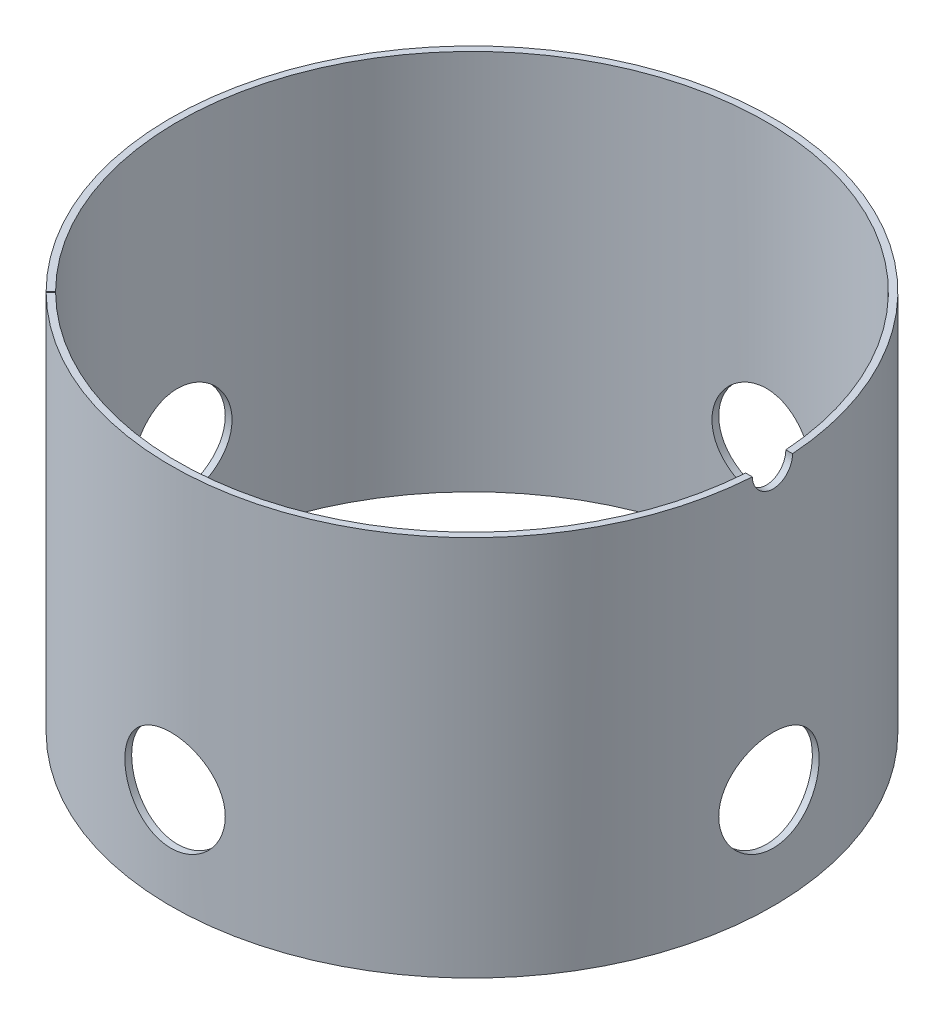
ISO-10303-21;
HEADER;
FILE_DESCRIPTION(('STEP AP214'),'2;1');
FILE_NAME('part.step','',(''),(''),'','','');
FILE_SCHEMA(('AUTOMOTIVE_DESIGN { 1 0 10303 214 1 1 1 1 }'));
ENDSEC;
DATA;
#1=APPLICATION_CONTEXT('core data for automotive mechanical design processes');
#2=APPLICATION_PROTOCOL_DEFINITION('international standard','automotive_design',2000,#1);
#3=PRODUCT_CONTEXT('',#1,'mechanical');
#4=PRODUCT('Part','Part','',(#3));
#5=PRODUCT_RELATED_PRODUCT_CATEGORY('part','',(#4));
#6=PRODUCT_DEFINITION_FORMATION('','',#4);
#7=PRODUCT_DEFINITION_CONTEXT('part definition',#1,'design');
#8=PRODUCT_DEFINITION('design','',#6,#7);
#9=PRODUCT_DEFINITION_SHAPE('','',#8);
#10=(LENGTH_UNIT() NAMED_UNIT(*) SI_UNIT(.MILLI.,.METRE.));
#11=(NAMED_UNIT(*) PLANE_ANGLE_UNIT() SI_UNIT($,.RADIAN.));
#12=(NAMED_UNIT(*) SI_UNIT($,.STERADIAN.) SOLID_ANGLE_UNIT());
#13=UNCERTAINTY_MEASURE_WITH_UNIT(LENGTH_MEASURE(1.E-05),#10,'distance_accuracy_value','');
#14=(GEOMETRIC_REPRESENTATION_CONTEXT(3) GLOBAL_UNCERTAINTY_ASSIGNED_CONTEXT((#13)) GLOBAL_UNIT_ASSIGNED_CONTEXT((#10,
#11,#12)) REPRESENTATION_CONTEXT('',''));
#15=CARTESIAN_POINT('',(0.,0.,0.));
#16=DIRECTION('',(0.,0.,1.));
#17=DIRECTION('',(1.,0.,0.));
#18=AXIS2_PLACEMENT_3D('',#15,#16,#17);
#19=CARTESIAN_POINT('',(220.,285.,-1.21539063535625E-13));
#20=DIRECTION('',(0.,-1.,0.));
#21=DIRECTION('',(0.,0.,-1.));
#22=AXIS2_PLACEMENT_3D('',#19,#20,#21);
#23=PLANE('',#22);
#24=CARTESIAN_POINT('',(-1.58206781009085E-13,285.,-1.37693675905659E-13));
#25=DIRECTION('',(0.,-1.,0.));
#26=DIRECTION('',(0.,0.,-1.));
#27=AXIS2_PLACEMENT_3D('',#24,#25,#26);
#28=CIRCLE('',#27,220.);
#29=CARTESIAN_POINT('',(219.48804067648,285.,14.9999999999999));
#30=VERTEX_POINT('',#29);
#31=CARTESIAN_POINT('',(-155.209536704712,285.,155.916643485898));
#32=VERTEX_POINT('',#31);
#33=EDGE_CURVE('E103',#30,#32,#28,.T.);
#34=ORIENTED_EDGE('',*,*,#33,.T.);
#35=DIRECTION('',(0.707106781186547,0.,-0.707106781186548));
#36=VECTOR('',#35,1.);
#37=CARTESIAN_POINT('',(-198.154928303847,285.,198.862035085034));
#38=LINE('',#37,#36);
#39=CARTESIAN_POINT('',(-158.745079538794,285.,159.452186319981));
#40=VERTEX_POINT('',#39);
#41=EDGE_CURVE('E56',#40,#32,#38,.T.);
#42=ORIENTED_EDGE('',*,*,#41,.F.);
#43=CARTESIAN_POINT('',(-1.58206781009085E-13,285.,-1.37693675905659E-13));
#44=DIRECTION('',(0.,-1.,0.));
#45=DIRECTION('',(0.,0.,-1.));
#46=AXIS2_PLACEMENT_3D('',#43,#44,#45);
#47=CIRCLE('',#46,225.);
#48=CARTESIAN_POINT('',(224.499443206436,285.,14.9999999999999));
#49=VERTEX_POINT('',#48);
#50=EDGE_CURVE('E111',#49,#40,#47,.T.);
#51=ORIENTED_EDGE('',*,*,#50,.F.);
#52=DIRECTION('',(1.,0.,0.));
#53=VECTOR('',#52,1.);
#54=CARTESIAN_POINT('',(-225.001,285.,14.9999999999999));
#55=LINE('',#54,#53);
#56=EDGE_CURVE('E214',#30,#49,#55,.T.);
#57=ORIENTED_EDGE('',*,*,#56,.F.);
#58=EDGE_LOOP('',(#34,#42,#51,#57));
#59=FACE_BOUND('',#58,.T.);
#60=ADVANCED_FACE('F33',(#59),#23,.F.);
#61=CARTESIAN_POINT('',(220.,0.,0.));
#62=DIRECTION('',(0.,-1.,0.));
#63=DIRECTION('',(0.,0.,-1.));
#64=AXIS2_PLACEMENT_3D('',#61,#62,#63);
#65=PLANE('',#64);
#66=DIRECTION('',(0.707106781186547,0.,-0.707106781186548));
#67=VECTOR('',#66,1.);
#68=CARTESIAN_POINT('',(-198.154928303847,-1.11022302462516E-13,198.862035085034));
#69=LINE('',#68,#67);
#70=CARTESIAN_POINT('',(-158.745079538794,-1.11022302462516E-13,159.452186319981));
#71=VERTEX_POINT('',#70);
#72=CARTESIAN_POINT('',(-155.209536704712,-1.11022302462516E-13,155.916643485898));
#73=VERTEX_POINT('',#72);
#74=EDGE_CURVE('E201',#71,#73,#69,.T.);
#75=ORIENTED_EDGE('',*,*,#74,.T.);
#76=CARTESIAN_POINT('',(0.,0.,0.));
#77=DIRECTION('',(0.,-1.,0.));
#78=DIRECTION('',(0.,0.,-1.));
#79=AXIS2_PLACEMENT_3D('',#76,#77,#78);
#80=CIRCLE('',#79,220.);
#81=CARTESIAN_POINT('',(-155.916643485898,0.,155.209536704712));
#82=VERTEX_POINT('',#81);
#83=EDGE_CURVE('E104',#82,#73,#80,.T.);
#84=ORIENTED_EDGE('',*,*,#83,.F.);
#85=DIRECTION('',(-0.707106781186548,0.,0.707106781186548));
#86=VECTOR('',#85,1.);
#87=CARTESIAN_POINT('',(-136.738368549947,-1.11022302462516E-13,136.031261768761));
#88=LINE('',#87,#86);
#89=CARTESIAN_POINT('',(-159.452186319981,-1.11022302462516E-13,158.745079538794));
#90=VERTEX_POINT('',#89);
#91=EDGE_CURVE('E48',#82,#90,#88,.T.);
#92=ORIENTED_EDGE('',*,*,#91,.T.);
#93=CARTESIAN_POINT('',(0.,0.,0.));
#94=DIRECTION('',(0.,-1.,0.));
#95=DIRECTION('',(0.,0.,-1.));
#96=AXIS2_PLACEMENT_3D('',#93,#94,#95);
#97=CIRCLE('',#96,225.);
#98=EDGE_CURVE('E90',#90,#71,#97,.T.);
#99=ORIENTED_EDGE('',*,*,#98,.T.);
#100=EDGE_LOOP('',(#75,#84,#92,#99));
#101=FACE_BOUND('',#100,.T.);
#102=ADVANCED_FACE('F35',(#101),#65,.T.);
#103=CARTESIAN_POINT('',(0.,0.,0.));
#104=DIRECTION('',(0.,-1.,0.));
#105=DIRECTION('',(0.,0.,-1.));
#106=AXIS2_PLACEMENT_3D('',#103,#104,#105);
#107=CYLINDRICAL_SURFACE('',#106,225.);
#108=DIRECTION('',(0.,-1.,0.));
#109=VECTOR('',#108,1.);
#110=CARTESIAN_POINT('',(-158.745079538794,0.,159.452186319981));
#111=LINE('',#110,#109);
#112=EDGE_CURVE('E170',#71,#40,#111,.F.);
#113=ORIENTED_EDGE('',*,*,#112,.F.);
#114=ORIENTED_EDGE('',*,*,#98,.F.);
#115=DIRECTION('',(0.,-1.,0.));
#116=VECTOR('',#115,1.);
#117=CARTESIAN_POINT('',(-159.452186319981,0.,158.745079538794));
#118=LINE('',#117,#116);
#119=CARTESIAN_POINT('',(-159.452186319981,285.,158.745079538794));
#120=VERTEX_POINT('',#119);
#121=EDGE_CURVE('E199',#120,#90,#118,.T.);
#122=ORIENTED_EDGE('',*,*,#121,.F.);
#123=CARTESIAN_POINT('',(224.499443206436,285.,-15.0000000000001));
#124=VERTEX_POINT('',#123);
#125=EDGE_CURVE('E97',#120,#124,#47,.T.);
#126=ORIENTED_EDGE('',*,*,#125,.T.);
#127=CARTESIAN_POINT('',(224.499443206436,285.,-15.0000000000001));
#128=CARTESIAN_POINT('',(224.499442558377,284.579073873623,-15.000003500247));
#129=CARTESIAN_POINT('',(224.500629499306,284.158203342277,-14.9822750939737));
#130=CARTESIAN_POINT('',(224.505342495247,283.319320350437,-14.9114886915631));
#131=CARTESIAN_POINT('',(224.508869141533,282.901308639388,-14.8584217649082));
#132=CARTESIAN_POINT('',(224.518167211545,282.070831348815,-14.7172544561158));
#133=CARTESIAN_POINT('',(224.523940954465,281.658371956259,-14.6291178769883));
#134=CARTESIAN_POINT('',(224.53756808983,280.84236774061,-14.4184481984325));
#135=CARTESIAN_POINT('',(224.545421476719,280.438822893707,-14.2959151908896));
#136=CARTESIAN_POINT('',(224.562979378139,279.643731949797,-14.017408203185));
#137=CARTESIAN_POINT('',(224.572682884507,279.252179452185,-13.8614524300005));
#138=CARTESIAN_POINT('',(224.593668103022,278.483610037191,-13.5171731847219));
#139=CARTESIAN_POINT('',(224.60494983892,278.106593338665,-13.3288492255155));
#140=CARTESIAN_POINT('',(224.628768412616,277.369852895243,-12.9212247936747));
#141=CARTESIAN_POINT('',(224.641304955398,277.010125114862,-12.7019315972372));
#142=CARTESIAN_POINT('',(224.667280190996,276.310405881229,-12.2338923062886));
#143=CARTESIAN_POINT('',(224.680718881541,275.970414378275,-11.9851462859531));
#144=CARTESIAN_POINT('',(224.70813879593,275.312069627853,-11.459567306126));
#145=CARTESIAN_POINT('',(224.722120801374,274.993749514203,-11.1826928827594));
#146=CARTESIAN_POINT('',(224.750212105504,274.381555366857,-10.603127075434));
#147=CARTESIAN_POINT('',(224.764321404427,274.087681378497,-10.3004356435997));
#148=CARTESIAN_POINT('',(224.792268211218,273.526446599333,-9.67136281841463));
#149=CARTESIAN_POINT('',(224.806105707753,273.259086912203,-9.34498043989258));
#150=CARTESIAN_POINT('',(224.833116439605,272.752789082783,-8.67084334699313));
#151=CARTESIAN_POINT('',(224.846289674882,272.513850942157,-8.32308863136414));
#152=CARTESIAN_POINT('',(224.871610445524,272.065887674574,-7.6083366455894));
#153=CARTESIAN_POINT('',(224.883757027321,271.85689023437,-7.24132198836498));
#154=CARTESIAN_POINT('',(224.906666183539,271.470561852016,-6.49094613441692));
#155=CARTESIAN_POINT('',(224.917428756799,271.293230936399,-6.10758492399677));
#156=CARTESIAN_POINT('',(224.937264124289,270.971507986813,-5.32724314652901));
#157=CARTESIAN_POINT('',(224.946336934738,270.827115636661,-4.93026271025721));
#158=CARTESIAN_POINT('',(224.962535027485,270.572306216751,-4.12550504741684));
#159=CARTESIAN_POINT('',(224.969660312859,270.461889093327,-3.7177278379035));
#160=CARTESIAN_POINT('',(224.981751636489,270.275966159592,-2.89490289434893));
#161=CARTESIAN_POINT('',(224.986720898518,270.200408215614,-2.47986698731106));
#162=CARTESIAN_POINT('',(224.994374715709,270.084504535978,-1.64488631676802));
#163=CARTESIAN_POINT('',(224.997059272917,270.044158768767,-1.22494155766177));
#164=CARTESIAN_POINT('',(225.000067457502,269.998971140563,-0.383142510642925));
#165=CARTESIAN_POINT('',(225.00039111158,269.994128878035,0.0387117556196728));
#166=CARTESIAN_POINT('',(224.998668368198,270.01998222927,0.881324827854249));
#167=CARTESIAN_POINT('',(224.996621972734,270.050677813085,1.30208363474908));
#168=CARTESIAN_POINT('',(224.990222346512,270.147307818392,2.13883775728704));
#169=CARTESIAN_POINT('',(224.98587279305,270.213186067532,2.55483958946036));
#170=CARTESIAN_POINT('',(224.974992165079,270.37967204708,3.37980497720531));
#171=CARTESIAN_POINT('',(224.968461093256,270.48027973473,3.78876854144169));
#172=CARTESIAN_POINT('',(224.953402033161,270.715503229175,4.59675952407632));
#173=CARTESIAN_POINT('',(224.944874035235,270.850119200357,4.99578689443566));
#174=CARTESIAN_POINT('',(224.926062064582,271.15239613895,5.78107965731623));
#175=CARTESIAN_POINT('',(224.915778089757,271.320057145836,6.16734503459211));
#176=CARTESIAN_POINT('',(224.893735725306,271.687375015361,6.9246861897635));
#177=CARTESIAN_POINT('',(224.881976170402,271.88705720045,7.29574965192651));
#178=CARTESIAN_POINT('',(224.857321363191,272.316901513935,8.01974100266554));
#179=CARTESIAN_POINT('',(224.844426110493,272.547063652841,8.37266888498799));
#180=CARTESIAN_POINT('',(224.817863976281,273.036238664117,9.05790409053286));
#181=CARTESIAN_POINT('',(224.804197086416,273.29525184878,9.39021119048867));
#182=CARTESIAN_POINT('',(224.776477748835,273.840295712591,10.0318591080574));
#183=CARTESIAN_POINT('',(224.762425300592,274.126326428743,10.3411998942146));
#184=CARTESIAN_POINT('',(224.734304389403,274.723969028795,10.9353129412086));
#185=CARTESIAN_POINT('',(224.720235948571,275.035629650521,11.2200361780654));
#186=CARTESIAN_POINT('',(224.692509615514,275.68184262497,11.7622205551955));
#187=CARTESIAN_POINT('',(224.678851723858,276.016395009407,12.0196816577));
#188=CARTESIAN_POINT('',(224.652334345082,276.706024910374,12.5055140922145));
#189=CARTESIAN_POINT('',(224.639474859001,277.061102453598,12.7338853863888));
#190=CARTESIAN_POINT('',(224.614919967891,277.789268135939,13.1599117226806));
#191=CARTESIAN_POINT('',(224.603224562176,278.162356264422,13.3575667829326));
#192=CARTESIAN_POINT('',(224.581330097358,278.923924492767,13.7207613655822));
#193=CARTESIAN_POINT('',(224.571131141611,279.312405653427,13.8862986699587));
#194=CARTESIAN_POINT('',(224.552521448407,280.10197599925,14.1840537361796));
#195=CARTESIAN_POINT('',(224.54411071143,280.503065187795,14.316271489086));
#196=CARTESIAN_POINT('',(224.529317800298,281.314991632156,14.5464346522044));
#197=CARTESIAN_POINT('',(224.522935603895,281.725828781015,14.6443804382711));
#198=CARTESIAN_POINT('',(224.512382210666,282.554324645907,14.8052945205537));
#199=CARTESIAN_POINT('',(224.508211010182,282.971983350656,14.8682628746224));
#200=CARTESIAN_POINT('',(224.502204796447,283.810330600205,14.9586795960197));
#201=CARTESIAN_POINT('',(224.500365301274,284.23101176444,14.9861961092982));
#202=CARTESIAN_POINT('',(224.499060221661,285.073200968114,15.0057341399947));
#203=CARTESIAN_POINT('',(224.499594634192,285.494709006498,14.9977557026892));
#204=CARTESIAN_POINT('',(224.503022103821,286.335546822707,14.946361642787));
#205=CARTESIAN_POINT('',(224.505915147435,286.754876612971,14.9029462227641));
#206=CARTESIAN_POINT('',(224.513977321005,287.588374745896,14.7809916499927));
#207=CARTESIAN_POINT('',(224.519146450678,288.002543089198,14.7024525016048));
#208=CARTESIAN_POINT('',(224.531607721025,288.822398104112,14.510903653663));
#209=CARTESIAN_POINT('',(224.538897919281,289.228092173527,14.3979254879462));
#210=CARTESIAN_POINT('',(224.5553959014,290.028513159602,14.1382841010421));
#211=CARTESIAN_POINT('',(224.564603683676,290.423240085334,13.9916209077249));
#212=CARTESIAN_POINT('',(224.58467555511,291.198938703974,13.6656558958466));
#213=CARTESIAN_POINT('',(224.595539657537,291.579910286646,13.4863538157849));
#214=CARTESIAN_POINT('',(224.618616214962,292.325406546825,13.0963880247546));
#215=CARTESIAN_POINT('',(224.630828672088,292.689931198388,12.8857242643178));
#216=CARTESIAN_POINT('',(224.656275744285,293.400506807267,12.4341850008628));
#217=CARTESIAN_POINT('',(224.669511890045,293.746528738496,12.1932639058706));
#218=CARTESIAN_POINT('',(224.696614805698,294.417056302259,11.6831717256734));
#219=CARTESIAN_POINT('',(224.710481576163,294.741561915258,11.4140006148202));
#220=CARTESIAN_POINT('',(224.738453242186,295.36676991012,10.8493098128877));
#221=CARTESIAN_POINT('',(224.752558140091,295.66747205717,10.5537898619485));
#222=CARTESIAN_POINT('',(224.780606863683,296.242946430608,9.93849067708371));
#223=CARTESIAN_POINT('',(224.794550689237,296.517718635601,9.61871142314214));
#224=CARTESIAN_POINT('',(224.821904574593,297.039803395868,8.95662588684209));
#225=CARTESIAN_POINT('',(224.835313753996,297.287071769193,8.61428472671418));
#226=CARTESIAN_POINT('',(224.861194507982,297.751888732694,7.90995374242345));
#227=CARTESIAN_POINT('',(224.873666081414,297.969437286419,7.54796389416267));
#228=CARTESIAN_POINT('',(224.897317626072,298.373261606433,6.80690340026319));
#229=CARTESIAN_POINT('',(224.908497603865,298.559537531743,6.42783284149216));
#230=CARTESIAN_POINT('',(224.929248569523,298.89948434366,5.65530076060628));
#231=CARTESIAN_POINT('',(224.938819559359,299.053155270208,5.26183925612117));
#232=CARTESIAN_POINT('',(224.956073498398,299.326675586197,4.4636530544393));
#233=CARTESIAN_POINT('',(224.963757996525,299.446552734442,4.05893790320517));
#234=CARTESIAN_POINT('',(224.977031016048,299.651791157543,3.24081433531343));
#235=CARTESIAN_POINT('',(224.982619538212,299.737152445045,2.82740592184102));
#236=CARTESIAN_POINT('',(224.99154180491,299.872742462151,1.99484703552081));
#237=CARTESIAN_POINT('',(224.994875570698,299.922971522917,1.57569661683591));
#238=CARTESIAN_POINT('',(224.999193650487,299.987935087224,0.734642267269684));
#239=CARTESIAN_POINT('',(225.000177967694,300.002669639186,0.312738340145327));
#240=CARTESIAN_POINT('',(224.999769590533,299.996543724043,-0.529989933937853));
#241=CARTESIAN_POINT('',(224.998381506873,299.9757523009,-0.950814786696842));
#242=CARTESIAN_POINT('',(224.993276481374,299.898856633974,-1.78921094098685));
#243=CARTESIAN_POINT('',(224.989559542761,299.842752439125,-2.20678224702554));
#244=CARTESIAN_POINT('',(224.979902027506,299.695635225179,-3.03570325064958));
#245=CARTESIAN_POINT('',(224.973961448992,299.604622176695,-3.44705294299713));
#246=CARTESIAN_POINT('',(224.960024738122,299.388341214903,-4.260610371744));
#247=CARTESIAN_POINT('',(224.952028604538,299.263073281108,-4.6628181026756));
#248=CARTESIAN_POINT('',(224.934207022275,298.979182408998,-5.45523475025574));
#249=CARTESIAN_POINT('',(224.924381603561,298.820560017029,-5.84544386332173));
#250=CARTESIAN_POINT('',(224.903178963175,298.471091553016,-6.61111082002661));
#251=CARTESIAN_POINT('',(224.891801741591,298.280245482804,-6.98656866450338));
#252=CARTESIAN_POINT('',(224.867817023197,297.867692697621,-7.7200736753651));
#253=CARTESIAN_POINT('',(224.855209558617,297.645986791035,-8.07812129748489));
#254=CARTESIAN_POINT('',(224.829119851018,297.173282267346,-8.77429346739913));
#255=CARTESIAN_POINT('',(224.815637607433,296.922283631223,-9.11241800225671));
#256=CARTESIAN_POINT('',(224.788153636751,296.392284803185,-9.76695961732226));
#257=CARTESIAN_POINT('',(224.774151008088,296.113234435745,-10.0833360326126));
#258=CARTESIAN_POINT('',(224.746045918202,295.529488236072,-10.6914697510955));
#259=CARTESIAN_POINT('',(224.731943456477,295.224792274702,-10.983226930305));
#260=CARTESIAN_POINT('',(224.704034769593,294.591830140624,-11.5401270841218));
#261=CARTESIAN_POINT('',(224.690228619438,294.263558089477,-11.8052633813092));
#262=CARTESIAN_POINT('',(224.663308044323,293.585837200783,-12.3069552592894));
#263=CARTESIAN_POINT('',(224.650193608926,293.236388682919,-12.5435112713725));
#264=CARTESIAN_POINT('',(224.625011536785,292.518291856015,-12.9866677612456));
#265=CARTESIAN_POINT('',(224.612945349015,292.149618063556,-13.1932270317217));
#266=CARTESIAN_POINT('',(224.590223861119,291.396127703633,-13.5745291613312));
#267=CARTESIAN_POINT('',(224.579568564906,291.011311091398,-13.7492719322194));
#268=CARTESIAN_POINT('',(224.559983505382,290.228672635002,-14.0655220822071));
#269=CARTESIAN_POINT('',(224.551051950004,289.830864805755,-14.2070640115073));
#270=CARTESIAN_POINT('',(224.535157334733,289.024832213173,-14.4560940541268));
#271=CARTESIAN_POINT('',(224.528193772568,288.616610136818,-14.5635908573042));
#272=CARTESIAN_POINT('',(224.514810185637,287.678797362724,-14.768666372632));
#273=CARTESIAN_POINT('',(224.509069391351,287.146776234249,-14.8553386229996));
#274=CARTESIAN_POINT('',(224.501386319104,286.076473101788,-14.9710031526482));
#275=CARTESIAN_POINT('',(224.499444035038,285.538191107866,-14.9999955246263));
#276=CARTESIAN_POINT('',(224.499443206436,285.,-15.0000000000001));
#277=B_SPLINE_CURVE_WITH_KNOTS('',3,(#127,#128,#129,#130,#131,#132,#133,#134,#135,#136,#137,
#138,#139,#140,#141,#142,#143,#144,#145,#146,#147,#148,#149,#150,#151,#152,#153,#154,#155,#156,
#157,#158,#159,#160,#161,#162,#163,#164,#165,#166,#167,#168,#169,#170,#171,#172,#173,#174,#175,
#176,#177,#178,#179,#180,#181,#182,#183,#184,#185,#186,#187,#188,#189,#190,#191,#192,#193,#194,
#195,#196,#197,#198,#199,#200,#201,#202,#203,#204,#205,#206,#207,#208,#209,#210,#211,#212,#213,
#214,#215,#216,#217,#218,#219,#220,#221,#222,#223,#224,#225,#226,#227,#228,#229,#230,#231,#232,
#233,#234,#235,#236,#237,#238,#239,#240,#241,#242,#243,#244,#245,#246,#247,#248,#249,#250,#251,
#252,#253,#254,#255,#256,#257,#258,#259,#260,#261,#262,#263,#264,#265,#266,#267,#268,#269,#270,
#271,#272,#273,#274,#275,#276),.UNSPECIFIED.,.T.,.F.,(4,2,2,2,2,2,2,2,2,2,2,2,2,2,2,2,2,2,2,2,2,
2,2,2,2,2,2,2,2,2,2,2,2,2,2,2,2,2,2,2,2,2,2,2,2,2,2,2,2,2,2,2,2,2,2,2,2,2,2,2,2,2,2,2,2,2,2,2,2,
2,2,2,2,2,4),(0.,1.26230803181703,2.52493518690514,3.78886895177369,5.05279934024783,
6.31604294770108,7.57930556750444,8.84227187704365,10.1052350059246,11.3700876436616,
12.634942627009,13.8998502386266,15.164757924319,16.4308278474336,17.696898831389,
18.9629576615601,20.2290144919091,21.493171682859,22.7573277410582,24.0214695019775,
25.285610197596,26.5477385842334,27.8098654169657,29.0719983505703,30.3341327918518,
31.597270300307,32.8604082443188,34.1235598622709,35.3867132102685,36.6523267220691,
37.9179419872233,39.1835588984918,40.4491750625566,41.7148785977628,42.980582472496,
44.2462724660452,45.5119603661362,46.7752116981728,48.0384614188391,49.3017039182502,
50.5649462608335,51.8270353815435,53.0891234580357,54.3512216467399,55.6133218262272,
56.8773470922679,58.1413735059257,59.4054123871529,60.6694523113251,61.9354943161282,
63.2015378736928,64.4675749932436,65.733610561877,66.9986031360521,68.263595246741,
69.5285754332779,70.7935538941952,72.0560766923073,73.3185977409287,74.5811198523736,
75.8436427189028,77.1061449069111,78.368647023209,79.631116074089,80.8935859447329,
82.1583555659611,83.4231315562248,84.6882240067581,85.9532973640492,87.2200924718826,
88.4868910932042,89.7523655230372,91.0175166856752,92.6314912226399,94.2454631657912),.UNSPECIFIED.);
#278=EDGE_CURVE('E124',#124,#49,#277,.T.);
#279=ORIENTED_EDGE('',*,*,#278,.T.);
#280=ORIENTED_EDGE('',*,*,#50,.T.);
#281=EDGE_LOOP('',(#113,#114,#122,#126,#279,#280));
#282=FACE_BOUND('',#281,.T.);
#283=CARTESIAN_POINT('',(37.5,75.,221.852991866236));
#284=CARTESIAN_POINT('',(37.4999937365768,76.0454632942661,221.852994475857));
#285=CARTESIAN_POINT('',(37.4562427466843,77.0910786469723,221.860401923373));
#286=CARTESIAN_POINT('',(37.2815475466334,79.1749170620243,221.889823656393));
#287=CARTESIAN_POINT('',(37.1505860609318,80.2131386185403,221.911840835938));
#288=CARTESIAN_POINT('',(36.8023275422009,82.2755190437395,221.969862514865));
#289=CARTESIAN_POINT('',(36.5849579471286,83.299665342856,222.005878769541));
#290=CARTESIAN_POINT('',(36.0655602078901,85.325645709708,222.090847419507));
#291=CARTESIAN_POINT('',(35.7635361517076,86.3274808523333,222.139799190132));
#292=CARTESIAN_POINT('',(35.0773836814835,88.3010407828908,222.249179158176));
#293=CARTESIAN_POINT('',(34.6933235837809,89.2727898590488,222.309597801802));
#294=CARTESIAN_POINT('',(33.8457716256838,91.1803286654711,222.440210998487));
#295=CARTESIAN_POINT('',(33.3822788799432,92.1161179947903,222.510405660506));
#296=CARTESIAN_POINT('',(32.3792649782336,93.9452096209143,222.658572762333));
#297=CARTESIAN_POINT('',(31.8397538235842,94.8385174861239,222.736544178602));
#298=CARTESIAN_POINT('',(30.6884541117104,96.5767358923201,222.898085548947));
#299=CARTESIAN_POINT('',(30.0766652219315,97.4216462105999,222.981655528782));
#300=CARTESIAN_POINT('',(28.7793281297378,99.0646112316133,223.15282204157));
#301=CARTESIAN_POINT('',(28.0931765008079,99.8621864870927,223.240447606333));
#302=CARTESIAN_POINT('',(26.6563616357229,101.396842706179,223.416566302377));
#303=CARTESIAN_POINT('',(25.9056979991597,102.133923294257,223.505059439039));
#304=CARTESIAN_POINT('',(24.3449649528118,103.542560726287,223.680439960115));
#305=CARTESIAN_POINT('',(23.534892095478,104.214113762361,223.767327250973));
#306=CARTESIAN_POINT('',(21.8609197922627,105.486977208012,223.937062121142));
#307=CARTESIAN_POINT('',(20.9970202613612,106.088287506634,224.019909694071));
#308=CARTESIAN_POINT('',(19.2159957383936,107.219795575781,224.179725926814));
#309=CARTESIAN_POINT('',(18.2985830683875,107.749546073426,224.25665642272));
#310=CARTESIAN_POINT('',(16.4216862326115,108.729795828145,224.40190295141));
#311=CARTESIAN_POINT('',(15.4622018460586,109.180294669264,224.470218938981));
#312=CARTESIAN_POINT('',(13.5079958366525,109.998659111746,224.596287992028));
#313=CARTESIAN_POINT('',(12.5132759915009,110.366528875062,224.654041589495));
#314=CARTESIAN_POINT('',(10.4956802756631,111.016858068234,224.75733780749));
#315=CARTESIAN_POINT('',(9.47280468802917,111.299318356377,224.802880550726));
#316=CARTESIAN_POINT('',(7.41585195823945,111.774434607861,224.880089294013));
#317=CARTESIAN_POINT('',(6.38196534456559,111.967895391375,224.911879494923));
#318=CARTESIAN_POINT('',(4.30126345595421,112.267329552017,224.961289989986));
#319=CARTESIAN_POINT('',(3.25444825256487,112.373303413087,224.97891036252));
#320=CARTESIAN_POINT('',(1.15553444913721,112.496931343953,224.999480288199));
#321=CARTESIAN_POINT('',(0.103436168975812,112.514590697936,225.0024307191));
#322=CARTESIAN_POINT('',(-1.99845935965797,112.461464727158,224.993579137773));
#323=CARTESIAN_POINT('',(-3.04825662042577,112.390679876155,224.981777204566));
#324=CARTESIAN_POINT('',(-5.12755824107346,112.162362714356,224.943945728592));
#325=CARTESIAN_POINT('',(-6.1571605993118,112.005697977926,224.918058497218));
#326=CARTESIAN_POINT('',(-8.1993576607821,111.607414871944,224.852872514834));
#327=CARTESIAN_POINT('',(-9.21195249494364,111.365797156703,224.81357386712));
#328=CARTESIAN_POINT('',(-11.2130646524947,110.799420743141,224.722652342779));
#329=CARTESIAN_POINT('',(-12.2015814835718,110.474660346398,224.671029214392));
#330=CARTESIAN_POINT('',(-14.1476769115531,109.744401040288,224.556882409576));
#331=CARTESIAN_POINT('',(-15.1052552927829,109.338901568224,224.494358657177));
#332=CARTESIAN_POINT('',(-16.987214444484,108.448069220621,224.359819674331));
#333=CARTESIAN_POINT('',(-17.9114234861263,107.962379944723,224.287762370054));
#334=CARTESIAN_POINT('',(-19.7157028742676,106.915962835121,224.136366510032));
#335=CARTESIAN_POINT('',(-20.5957731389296,106.355234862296,224.057027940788));
#336=CARTESIAN_POINT('',(-22.3058874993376,105.162628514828,223.893245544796));
#337=CARTESIAN_POINT('',(-23.1359281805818,104.530745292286,223.808801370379));
#338=CARTESIAN_POINT('',(-24.7403409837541,103.200206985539,223.637131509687));
#339=CARTESIAN_POINT('',(-25.5147126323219,102.501551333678,223.549905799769));
#340=CARTESIAN_POINT('',(-27.0116162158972,101.03334324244,223.374008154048));
#341=CARTESIAN_POINT('',(-27.7334043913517,100.263032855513,223.285331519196));
#342=CARTESIAN_POINT('',(-29.1096072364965,98.6641786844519,223.110089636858));
#343=CARTESIAN_POINT('',(-29.7640213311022,97.8356344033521,223.0235244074));
#344=CARTESIAN_POINT('',(-31.0008871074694,96.1260068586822,222.854963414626));
#345=CARTESIAN_POINT('',(-31.5833378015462,95.2449228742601,222.772967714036));
#346=CARTESIAN_POINT('',(-32.672103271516,93.4363166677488,222.61589417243));
#347=CARTESIAN_POINT('',(-33.1784182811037,92.5087945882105,222.540816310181));
#348=CARTESIAN_POINT('',(-34.1117516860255,90.6126943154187,222.3996662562));
#349=CARTESIAN_POINT('',(-34.5386794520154,89.6440707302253,222.333604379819));
#350=CARTESIAN_POINT('',(-35.309335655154,87.6735936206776,222.212517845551));
#351=CARTESIAN_POINT('',(-35.6530639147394,86.6717400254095,222.15749321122));
#352=CARTESIAN_POINT('',(-36.2546708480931,84.6420508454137,222.060108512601));
#353=CARTESIAN_POINT('',(-36.5125557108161,83.6142171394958,222.017747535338));
#354=CARTESIAN_POINT('',(-36.9404976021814,81.539955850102,221.946945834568));
#355=CARTESIAN_POINT('',(-37.1105555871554,80.4935284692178,221.918504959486));
#356=CARTESIAN_POINT('',(-37.3600025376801,78.4023206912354,221.876645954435));
#357=CARTESIAN_POINT('',(-37.4404506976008,77.35767004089,221.86305236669));
#358=CARTESIAN_POINT('',(-37.513671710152,75.2652165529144,221.850683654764));
#359=CARTESIAN_POINT('',(-37.5064452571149,74.2174137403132,221.85190841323));
#360=CARTESIAN_POINT('',(-37.4043763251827,72.1262479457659,221.869140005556));
#361=CARTESIAN_POINT('',(-37.3095370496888,71.0828848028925,221.885146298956));
#362=CARTESIAN_POINT('',(-37.0329854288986,69.0080611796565,221.93147050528));
#363=CARTESIAN_POINT('',(-36.8512731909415,67.9766006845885,221.961788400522));
#364=CARTESIAN_POINT('',(-36.4038026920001,65.9394352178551,222.035614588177));
#365=CARTESIAN_POINT('',(-36.138584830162,64.9336083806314,222.079037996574));
#366=CARTESIAN_POINT('',(-35.5257483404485,62.9479976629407,222.177895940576));
#367=CARTESIAN_POINT('',(-35.1781301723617,61.9682136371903,222.23333040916));
#368=CARTESIAN_POINT('',(-34.403028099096,60.041387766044,222.354638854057));
#369=CARTESIAN_POINT('',(-33.9755405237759,59.0943474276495,222.420513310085));
#370=CARTESIAN_POINT('',(-33.0437806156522,57.2394886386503,222.56084651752));
#371=CARTESIAN_POINT('',(-32.5395075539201,56.3316705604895,222.635305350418));
#372=CARTESIAN_POINT('',(-31.4527298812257,54.5531963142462,222.791449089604));
#373=CARTESIAN_POINT('',(-30.8695466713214,53.6829600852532,222.873194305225));
#374=CARTESIAN_POINT('',(-29.6326746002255,51.9945713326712,223.041014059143));
#375=CARTESIAN_POINT('',(-28.978985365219,51.1764190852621,223.127088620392));
#376=CARTESIAN_POINT('',(-27.6055692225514,49.5976915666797,223.301167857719));
#377=CARTESIAN_POINT('',(-26.8858382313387,48.8371198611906,223.389172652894));
#378=CARTESIAN_POINT('',(-25.3852803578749,47.378773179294,223.56466183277));
#379=CARTESIAN_POINT('',(-24.6044531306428,46.6809985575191,223.65214621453));
#380=CARTESIAN_POINT('',(-22.9785639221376,45.346105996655,223.825067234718));
#381=CARTESIAN_POINT('',(-22.1329175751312,44.709695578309,223.910473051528));
#382=CARTESIAN_POINT('',(-20.3905011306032,43.5103816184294,224.075864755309));
#383=CARTESIAN_POINT('',(-19.4937306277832,42.9474786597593,224.155850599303));
#384=CARTESIAN_POINT('',(-17.6553305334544,41.8992615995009,224.308135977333));
#385=CARTESIAN_POINT('',(-16.7137019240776,41.4139458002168,224.38043567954));
#386=CARTESIAN_POINT('',(-14.7921898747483,40.5244733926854,224.515296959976));
#387=CARTESIAN_POINT('',(-13.812306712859,40.1203161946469,224.577858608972));
#388=CARTESIAN_POINT('',(-11.8256248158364,39.3977961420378,224.691210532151));
#389=CARTESIAN_POINT('',(-10.8189631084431,39.0790644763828,224.74205127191));
#390=CARTESIAN_POINT('',(-8.781813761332,38.5274997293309,224.830867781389));
#391=CARTESIAN_POINT('',(-7.75132616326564,38.2946664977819,224.868843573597));
#392=CARTESIAN_POINT('',(-5.67404400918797,37.9167203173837,224.930844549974));
#393=CARTESIAN_POINT('',(-4.62725058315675,37.7716013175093,224.954870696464));
#394=CARTESIAN_POINT('',(-2.52492304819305,37.5702014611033,224.988288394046));
#395=CARTESIAN_POINT('',(-1.46938901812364,37.5139198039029,224.997680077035));
#396=CARTESIAN_POINT('',(0.629881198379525,37.490777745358,225.001537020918));
#397=CARTESIAN_POINT('',(1.67360536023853,37.5228420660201,224.996181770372));
#398=CARTESIAN_POINT('',(3.75456763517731,37.6738495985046,224.971078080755));
#399=CARTESIAN_POINT('',(4.79180580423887,37.7927920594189,224.951329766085));
#400=CARTESIAN_POINT('',(6.85239775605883,38.1166382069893,224.897992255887));
#401=CARTESIAN_POINT('',(7.87575167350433,38.3215410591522,224.864403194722));
#402=CARTESIAN_POINT('',(9.90135353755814,38.8157487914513,224.784320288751));
#403=CARTESIAN_POINT('',(10.9036014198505,39.1050539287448,224.737826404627));
#404=CARTESIAN_POINT('',(12.8788639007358,39.7655263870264,224.633283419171));
#405=CARTESIAN_POINT('',(13.8519101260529,40.1366012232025,224.575247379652));
#406=CARTESIAN_POINT('',(15.7632375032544,40.9580794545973,224.449187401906));
#407=CARTESIAN_POINT('',(16.701518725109,41.4084826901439,224.381163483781));
#408=CARTESIAN_POINT('',(18.5369620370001,42.385403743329,224.236992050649));
#409=CARTESIAN_POINT('',(19.4341227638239,42.9119240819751,224.160844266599));
#410=CARTESIAN_POINT('',(21.1812537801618,44.0373726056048,224.002508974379));
#411=CARTESIAN_POINT('',(22.0312236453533,44.6363014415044,223.920321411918));
#412=CARTESIAN_POINT('',(23.687729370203,45.9097039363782,223.751184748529));
#413=CARTESIAN_POINT('',(24.4936557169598,46.5849648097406,223.664191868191));
#414=CARTESIAN_POINT('',(26.0459078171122,48.0006641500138,223.488748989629));
#415=CARTESIAN_POINT('',(26.7922329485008,48.741103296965,223.400298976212));
#416=CARTESIAN_POINT('',(28.2203308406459,50.2822567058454,223.224395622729));
#417=CARTESIAN_POINT('',(28.9020883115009,51.0829851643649,223.136942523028));
#418=CARTESIAN_POINT('',(30.1961222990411,52.7390817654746,222.965513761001));
#419=CARTESIAN_POINT('',(30.8083995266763,53.5944493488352,222.881538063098));
#420=CARTESIAN_POINT('',(31.9632501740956,55.3602092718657,222.718865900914));
#421=CARTESIAN_POINT('',(32.5053000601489,56.2709479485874,222.640210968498));
#422=CARTESIAN_POINT('',(33.5106632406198,58.1356174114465,222.491109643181));
#423=CARTESIAN_POINT('',(33.973972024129,59.0895506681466,222.42066372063));
#424=CARTESIAN_POINT('',(34.817981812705,61.0329144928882,222.290104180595));
#425=CARTESIAN_POINT('',(35.1987577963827,62.0223118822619,222.229981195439));
#426=CARTESIAN_POINT('',(35.8752930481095,64.030260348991,222.121770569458));
#427=CARTESIAN_POINT('',(36.1710705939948,65.0488051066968,222.07368034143));
#428=CARTESIAN_POINT('',(36.6017293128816,66.8069099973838,222.00303092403));
#429=CARTESIAN_POINT('',(36.7583729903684,67.5410868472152,221.977117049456));
#430=CARTESIAN_POINT('',(37.0273870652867,69.0178710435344,221.932402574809));
#431=CARTESIAN_POINT('',(37.1397512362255,69.7604795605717,221.913602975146));
#432=CARTESIAN_POINT('',(37.3197064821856,71.2512416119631,221.883410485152));
#433=CARTESIAN_POINT('',(37.3872981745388,71.9993950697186,221.872017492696));
#434=CARTESIAN_POINT('',(37.477443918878,73.4983398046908,221.856807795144));
#435=CARTESIAN_POINT('',(37.5000044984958,74.2491306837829,221.852989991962));
#436=CARTESIAN_POINT('',(37.5,75.,221.852991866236));
#437=B_SPLINE_CURVE_WITH_KNOTS('',3,(#283,#284,#285,#286,#287,#288,#289,#290,#291,#292,#293,
#294,#295,#296,#297,#298,#299,#300,#301,#302,#303,#304,#305,#306,#307,#308,#309,#310,#311,#312,
#313,#314,#315,#316,#317,#318,#319,#320,#321,#322,#323,#324,#325,#326,#327,#328,#329,#330,#331,
#332,#333,#334,#335,#336,#337,#338,#339,#340,#341,#342,#343,#344,#345,#346,#347,#348,#349,#350,
#351,#352,#353,#354,#355,#356,#357,#358,#359,#360,#361,#362,#363,#364,#365,#366,#367,#368,#369,
#370,#371,#372,#373,#374,#375,#376,#377,#378,#379,#380,#381,#382,#383,#384,#385,#386,#387,#388,
#389,#390,#391,#392,#393,#394,#395,#396,#397,#398,#399,#400,#401,#402,#403,#404,#405,#406,#407,
#408,#409,#410,#411,#412,#413,#414,#415,#416,#417,#418,#419,#420,#421,#422,#423,#424,#425,#426,
#427,#428,#429,#430,#431,#432,#433,#434,#435,#436),.UNSPECIFIED.,.T.,.F.,(4,2,2,2,2,2,2,2,2,2,2,
2,2,2,2,2,2,2,2,2,2,2,2,2,2,2,2,2,2,2,2,2,2,2,2,2,2,2,2,2,2,2,2,2,2,2,2,2,2,2,2,2,2,2,2,2,2,2,2,
2,2,2,2,2,2,2,2,2,2,2,2,2,2,2,2,2,4),(0.,3.13571431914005,6.27204997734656,9.41102498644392,
12.5498484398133,15.6860681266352,18.8223227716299,21.9581651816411,25.0940220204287,
28.257560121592,31.4211178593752,34.5848593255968,37.7486057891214,40.93129233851,
44.1139955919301,47.2965384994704,50.4790494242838,53.6321861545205,56.7853054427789,
59.9382360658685,63.0911498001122,66.2127839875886,69.3343941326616,72.4560680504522,
75.5777637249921,78.7137268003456,81.8496956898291,84.9858783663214,88.1220877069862,
91.2963838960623,94.4707071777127,97.6450740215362,100.819431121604,103.997390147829,
107.175355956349,110.353092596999,113.530794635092,116.67052371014,119.810227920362,
122.949817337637,126.089402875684,129.209074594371,132.328728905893,135.448526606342,
138.56835392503,141.716953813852,144.865570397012,148.01438179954,151.163210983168,
154.344839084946,157.526492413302,160.708076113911,163.889636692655,167.057231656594,
170.22482108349,173.392191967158,176.559534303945,179.688497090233,182.817432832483,
185.946338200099,189.075253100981,192.200647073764,195.326034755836,198.451525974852,
201.577045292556,204.738389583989,207.899766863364,211.061890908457,214.223982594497,
217.408435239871,220.593070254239,223.774799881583,226.95584480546,229.208008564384,
231.460488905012,233.71293818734,235.965060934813),.UNSPECIFIED.);
#438=CARTESIAN_POINT('',(37.5,75.,221.852991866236));
#439=VERTEX_POINT('',#438);
#440=EDGE_CURVE('E162',#439,#439,#437,.T.);
#441=ORIENTED_EDGE('',*,*,#440,.F.);
#442=EDGE_LOOP('',(#441));
#443=FACE_BOUND('',#442,.T.);
#444=CARTESIAN_POINT('',(0.,112.5,-225.));
#445=CARTESIAN_POINT('',(1.04557681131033,112.499993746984,-224.999997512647));
#446=CARTESIAN_POINT('',(2.0913055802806,112.456233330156,-224.992692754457));
#447=CARTESIAN_POINT('',(4.17537396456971,112.281499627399,-224.963670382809));
#448=CARTESIAN_POINT('',(5.21371207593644,112.150509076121,-224.941949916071));
#449=CARTESIAN_POINT('',(7.27632802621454,111.802171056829,-224.884682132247));
#450=CARTESIAN_POINT('',(8.30059333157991,111.584751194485,-224.849123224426));
#451=CARTESIAN_POINT('',(10.3268144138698,111.065229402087,-224.76517779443));
#452=CARTESIAN_POINT('',(11.328771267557,110.763131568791,-224.716791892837));
#453=CARTESIAN_POINT('',(13.302590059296,110.076800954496,-224.608586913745));
#454=CARTESIAN_POINT('',(14.2744757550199,109.692635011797,-224.548777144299));
#455=CARTESIAN_POINT('',(16.1822761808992,108.844845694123,-224.419357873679));
#456=CARTESIAN_POINT('',(17.1181905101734,108.381221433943,-224.34974826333));
#457=CARTESIAN_POINT('',(18.9475100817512,107.377924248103,-224.202662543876));
#458=CARTESIAN_POINT('',(19.8409209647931,106.838261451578,-224.125187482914));
#459=CARTESIAN_POINT('',(21.5793172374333,105.686644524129,-223.964495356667));
#460=CARTESIAN_POINT('',(22.4243024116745,105.07469007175,-223.88127826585));
#461=CARTESIAN_POINT('',(24.0671664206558,103.777186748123,-223.710660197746));
#462=CARTESIAN_POINT('',(24.8645800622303,103.091052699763,-223.623229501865));
#463=CARTESIAN_POINT('',(26.3989114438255,101.65430727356,-223.447295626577));
#464=CARTESIAN_POINT('',(27.1358288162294,100.903695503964,-223.358792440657));
#465=CARTESIAN_POINT('',(28.5441466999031,99.3430986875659,-223.183188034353));
#466=CARTESIAN_POINT('',(29.2155431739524,98.5331099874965,-223.096086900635));
#467=CARTESIAN_POINT('',(30.4881054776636,96.8593380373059,-222.925744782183));
#468=CARTESIAN_POINT('',(31.0892711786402,95.9955546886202,-222.842503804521));
#469=CARTESIAN_POINT('',(32.2206142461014,94.214623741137,-222.681747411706));
#470=CARTESIAN_POINT('',(32.7503305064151,93.2971796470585,-222.604270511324));
#471=CARTESIAN_POINT('',(33.7305085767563,91.4202228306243,-222.457857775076));
#472=CARTESIAN_POINT('',(34.1809699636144,90.4607098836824,-222.388921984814));
#473=CARTESIAN_POINT('',(34.9992576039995,88.5064458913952,-222.261610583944));
#474=CARTESIAN_POINT('',(35.3670881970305,87.5116966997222,-222.203234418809));
#475=CARTESIAN_POINT('',(36.0173379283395,85.4940353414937,-222.098761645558));
#476=CARTESIAN_POINT('',(36.2997579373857,84.4711234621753,-222.052664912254));
#477=CARTESIAN_POINT('',(36.7747974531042,82.4140608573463,-221.974484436));
#478=CARTESIAN_POINT('',(36.9682193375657,81.3801001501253,-221.942275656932));
#479=CARTESIAN_POINT('',(37.2675645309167,79.2992440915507,-221.892207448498));
#480=CARTESIAN_POINT('',(37.3734883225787,78.2523488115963,-221.874347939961));
#481=CARTESIAN_POINT('',(37.4970028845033,76.1532778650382,-221.853507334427));
#482=CARTESIAN_POINT('',(37.5145991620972,75.1011025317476,-221.850525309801));
#483=CARTESIAN_POINT('',(37.4613344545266,72.9990610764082,-221.859525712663));
#484=CARTESIAN_POINT('',(37.390473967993,71.9491949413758,-221.871508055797));
#485=CARTESIAN_POINT('',(37.162042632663,69.8701947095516,-221.90988212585));
#486=CARTESIAN_POINT('',(37.0053746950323,68.8409584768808,-221.936123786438));
#487=CARTESIAN_POINT('',(36.6071476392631,66.7994957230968,-222.002156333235));
#488=CARTESIAN_POINT('',(36.3655891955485,65.7872690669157,-222.041947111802));
#489=CARTESIAN_POINT('',(35.7993938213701,63.7868839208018,-222.133936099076));
#490=CARTESIAN_POINT('',(35.4747549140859,62.7987260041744,-222.186134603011));
#491=CARTESIAN_POINT('',(34.7448002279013,60.8533314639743,-222.301451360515));
#492=CARTESIAN_POINT('',(34.3394838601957,59.8960950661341,-222.364569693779));
#493=CARTESIAN_POINT('',(33.4489754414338,58.0145794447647,-222.500269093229));
#494=CARTESIAN_POINT('',(32.9634095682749,57.0904803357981,-222.572894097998));
#495=CARTESIAN_POINT('',(31.9172566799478,55.2863998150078,-222.725319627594));
#496=CARTESIAN_POINT('',(31.3566695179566,54.4064184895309,-222.805120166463));
#497=CARTESIAN_POINT('',(30.1643551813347,52.6964543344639,-222.969669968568));
#498=CARTESIAN_POINT('',(29.53262317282,51.8664749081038,-223.054419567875));
#499=CARTESIAN_POINT('',(28.202389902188,50.2621530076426,-223.226510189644));
#500=CARTESIAN_POINT('',(27.503888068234,49.4878110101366,-223.313851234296));
#501=CARTESIAN_POINT('',(26.0357950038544,47.9907409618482,-223.489799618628));
#502=CARTESIAN_POINT('',(25.2654293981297,47.268772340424,-223.578409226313));
#503=CARTESIAN_POINT('',(23.6664277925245,45.8922150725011,-223.753317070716));
#504=CARTESIAN_POINT('',(22.8377912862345,45.2376270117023,-223.839615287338));
#505=CARTESIAN_POINT('',(21.1279483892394,44.000429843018,-224.007472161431));
#506=CARTESIAN_POINT('',(20.2467414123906,43.4178215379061,-224.089030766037));
#507=CARTESIAN_POINT('',(18.4378638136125,42.3287636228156,-224.245109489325));
#508=CARTESIAN_POINT('',(17.5101933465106,41.8223137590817,-224.319629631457));
#509=CARTESIAN_POINT('',(15.6140473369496,40.8888708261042,-224.459586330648));
#510=CARTESIAN_POINT('',(14.6455376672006,40.4619458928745,-224.525015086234));
#511=CARTESIAN_POINT('',(12.6752986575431,39.6912796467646,-224.644854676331));
#512=CARTESIAN_POINT('',(11.6735692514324,39.3475384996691,-224.699265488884));
#513=CARTESIAN_POINT('',(9.64413628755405,38.7458871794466,-224.795512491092));
#514=CARTESIAN_POINT('',(8.61643450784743,38.4879711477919,-224.837349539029));
#515=CARTESIAN_POINT('',(6.54244638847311,38.05994698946,-224.907253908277));
#516=CARTESIAN_POINT('',(5.49616024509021,37.8898379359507,-224.935321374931));
#517=CARTESIAN_POINT('',(3.40502869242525,37.640242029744,-224.976635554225));
#518=CARTESIAN_POINT('',(2.36031085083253,37.5597136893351,-224.990052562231));
#519=CARTESIAN_POINT('',(0.267718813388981,37.4863440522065,-225.002273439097));
#520=CARTESIAN_POINT('',(-0.780155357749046,37.4935020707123,-225.001077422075));
#521=CARTESIAN_POINT('',(-2.87147261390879,37.5954465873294,-224.984106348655));
#522=CARTESIAN_POINT('',(-3.91491585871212,37.6902298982,-224.968331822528));
#523=CARTESIAN_POINT('',(-5.98991133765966,37.9666843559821,-224.922648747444));
#524=CARTESIAN_POINT('',(-7.02146358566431,38.1483554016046,-224.892740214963));
#525=CARTESIAN_POINT('',(-9.0591094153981,38.5958242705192,-224.819851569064));
#526=CARTESIAN_POINT('',(-10.0653194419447,38.8611052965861,-224.776951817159));
#527=CARTESIAN_POINT('',(-12.0516886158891,39.4741338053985,-224.679206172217));
#528=CARTESIAN_POINT('',(-13.031847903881,39.8218808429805,-224.624360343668));
#529=CARTESIAN_POINT('',(-14.9594013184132,40.5973030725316,-224.504229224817));
#530=CARTESIAN_POINT('',(-15.9067940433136,41.0249816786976,-224.438943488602));
#531=CARTESIAN_POINT('',(-17.7623246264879,41.95718153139,-224.299722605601));
#532=CARTESIAN_POINT('',(-18.670462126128,42.4617034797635,-224.225787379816));
#533=CARTESIAN_POINT('',(-20.4491889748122,43.5488209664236,-224.070602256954));
#534=CARTESIAN_POINT('',(-21.3193757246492,44.1320668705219,-223.989293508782));
#535=CARTESIAN_POINT('',(-23.0076514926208,45.3690516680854,-223.82217871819));
#536=CARTESIAN_POINT('',(-23.8257402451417,46.0227909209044,-223.736372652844));
#537=CARTESIAN_POINT('',(-25.4043280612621,47.3962902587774,-223.562632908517));
#538=CARTESIAN_POINT('',(-26.1648234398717,48.1160545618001,-223.474699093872));
#539=CARTESIAN_POINT('',(-27.6230060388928,49.6166573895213,-223.299146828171));
#540=CARTESIAN_POINT('',(-28.3206928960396,50.397496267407,-223.211528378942));
#541=CARTESIAN_POINT('',(-29.6553757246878,52.0233529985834,-223.038150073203));
#542=CARTESIAN_POINT('',(-30.2916669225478,52.8689526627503,-222.952418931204));
#543=CARTESIAN_POINT('',(-31.4907495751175,54.611251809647,-222.786218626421));
#544=CARTESIAN_POINT('',(-32.0535404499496,55.5079516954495,-222.705749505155));
#545=CARTESIAN_POINT('',(-33.101547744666,57.3461941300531,-222.552394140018));
#546=CARTESIAN_POINT('',(-33.5867658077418,58.2877357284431,-222.479507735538));
#547=CARTESIAN_POINT('',(-34.4760613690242,60.2090651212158,-222.343436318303));
#548=CARTESIAN_POINT('',(-34.8801394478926,61.1888526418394,-222.280251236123));
#549=CARTESIAN_POINT('',(-35.6026055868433,63.1755730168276,-222.165676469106));
#550=CARTESIAN_POINT('',(-35.9213430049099,64.1823760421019,-222.114238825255));
#551=CARTESIAN_POINT('',(-36.4728981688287,66.2198219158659,-222.024336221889));
#552=CARTESIAN_POINT('',(-36.7057160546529,67.2504647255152,-221.985871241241));
#553=CARTESIAN_POINT('',(-37.0836062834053,69.3280633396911,-221.923056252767));
#554=CARTESIAN_POINT('',(-37.2286850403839,70.3750179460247,-221.898705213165));
#555=CARTESIAN_POINT('',(-37.4299778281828,72.4776707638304,-221.864839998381));
#556=CARTESIAN_POINT('',(-37.4861926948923,73.5333688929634,-221.85532568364));
#557=CARTESIAN_POINT('',(-37.5091705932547,75.6325696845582,-221.851441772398));
#558=CARTESIAN_POINT('',(-37.477041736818,76.6760600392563,-221.85688456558));
#559=CARTESIAN_POINT('',(-37.3259446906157,78.7565472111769,-221.882355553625));
#560=CARTESIAN_POINT('',(-37.2069772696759,79.7935440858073,-221.902383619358));
#561=CARTESIAN_POINT('',(-36.8831225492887,81.8536490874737,-221.956442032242));
#562=CARTESIAN_POINT('',(-36.6782359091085,82.8767573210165,-221.990472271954));
#563=CARTESIAN_POINT('',(-36.1841039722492,84.9018654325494,-222.071549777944));
#564=CARTESIAN_POINT('',(-35.8948584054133,85.9038652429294,-222.118597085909));
#565=CARTESIAN_POINT('',(-35.2345654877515,87.8785874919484,-222.224294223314));
#566=CARTESIAN_POINT('',(-34.8636146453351,88.8513429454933,-222.282930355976));
#567=CARTESIAN_POINT('',(-34.0424343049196,90.762107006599,-222.410173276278));
#568=CARTESIAN_POINT('',(-33.5922049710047,91.7001156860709,-222.47878004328));
#569=CARTESIAN_POINT('',(-32.6156752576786,93.5350456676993,-222.624035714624));
#570=CARTESIAN_POINT('',(-32.0893722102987,94.4319655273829,-222.700684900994));
#571=CARTESIAN_POINT('',(-30.9643943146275,96.1786553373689,-222.859886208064));
#572=CARTESIAN_POINT('',(-30.3657187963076,97.0284248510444,-222.942438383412));
#573=CARTESIAN_POINT('',(-29.0925941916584,98.6849120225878,-223.112164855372));
#574=CARTESIAN_POINT('',(-28.4173300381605,99.4909989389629,-223.199382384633));
#575=CARTESIAN_POINT('',(-27.0015906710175,101.043575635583,-223.375071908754));
#576=CARTESIAN_POINT('',(-26.2611147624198,101.790064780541,-223.463543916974));
#577=CARTESIAN_POINT('',(-24.7198552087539,103.218486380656,-223.63928620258));
#578=CARTESIAN_POINT('',(-23.9190575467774,103.900403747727,-223.726556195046));
#579=CARTESIAN_POINT('',(-22.2627899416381,105.194748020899,-223.897434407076));
#580=CARTESIAN_POINT('',(-21.4073205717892,105.807175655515,-223.981042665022));
#581=CARTESIAN_POINT('',(-19.6414766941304,106.962214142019,-224.142819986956));
#582=CARTESIAN_POINT('',(-18.7307638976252,107.504313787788,-224.22094751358));
#583=CARTESIAN_POINT('',(-16.8661405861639,108.509778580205,-224.368910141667));
#584=CARTESIAN_POINT('',(-15.9122276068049,108.973139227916,-224.438744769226));
#585=CARTESIAN_POINT('',(-13.9689021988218,109.817253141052,-224.568068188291));
#586=CARTESIAN_POINT('',(-12.9795228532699,110.198081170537,-224.627566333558));
#587=CARTESIAN_POINT('',(-10.9716153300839,110.874719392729,-224.734584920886));
#588=CARTESIAN_POINT('',(-9.95309345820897,111.17054782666,-224.782107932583));
#589=CARTESIAN_POINT('',(-8.19485567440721,111.601337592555,-224.851900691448));
#590=CARTESIAN_POINT('',(-7.46051873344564,111.758050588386,-224.877492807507));
#591=CARTESIAN_POINT('',(-5.98341387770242,112.027182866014,-224.921640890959));
#592=CARTESIAN_POINT('',(-5.24064479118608,112.139595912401,-224.940195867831));
#593=CARTESIAN_POINT('',(-3.74956135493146,112.319629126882,-224.969990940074));
#594=CARTESIAN_POINT('',(-3.00124707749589,112.38724987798,-224.981231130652));
#595=CARTESIAN_POINT('',(-1.50198106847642,112.477434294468,-224.996236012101));
#596=CARTESIAN_POINT('',(-0.751029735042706,112.500004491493,-225.000001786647));
#597=CARTESIAN_POINT('',(0.,112.5,-225.));
#598=B_SPLINE_CURVE_WITH_KNOTS('',3,(#444,#445,#446,#447,#448,#449,#450,#451,#452,#453,#454,
#455,#456,#457,#458,#459,#460,#461,#462,#463,#464,#465,#466,#467,#468,#469,#470,#471,#472,#473,
#474,#475,#476,#477,#478,#479,#480,#481,#482,#483,#484,#485,#486,#487,#488,#489,#490,#491,#492,
#493,#494,#495,#496,#497,#498,#499,#500,#501,#502,#503,#504,#505,#506,#507,#508,#509,#510,#511,
#512,#513,#514,#515,#516,#517,#518,#519,#520,#521,#522,#523,#524,#525,#526,#527,#528,#529,#530,
#531,#532,#533,#534,#535,#536,#537,#538,#539,#540,#541,#542,#543,#544,#545,#546,#547,#548,#549,
#550,#551,#552,#553,#554,#555,#556,#557,#558,#559,#560,#561,#562,#563,#564,#565,#566,#567,#568,
#569,#570,#571,#572,#573,#574,#575,#576,#577,#578,#579,#580,#581,#582,#583,#584,#585,#586,#587,
#588,#589,#590,#591,#592,#593,#594,#595,#596,#597),.UNSPECIFIED.,.T.,.F.,(4,2,2,2,2,2,2,2,2,2,2,
2,2,2,2,2,2,2,2,2,2,2,2,2,2,2,2,2,2,2,2,2,2,2,2,2,2,2,2,2,2,2,2,2,2,2,2,2,2,2,2,2,2,2,2,2,2,2,2,
2,2,2,2,2,2,2,2,2,2,2,2,2,2,2,2,2,4),(0.,3.13605508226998,6.27273106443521,9.41203992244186,
12.5511969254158,15.6878070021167,18.8244520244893,21.9606796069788,25.0969211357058,
28.2600113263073,31.4231207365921,34.5864249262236,37.7497349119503,40.9325714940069,
44.1154250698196,47.2981114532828,50.4807653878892,53.6341344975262,56.7874862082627,
59.9406413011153,63.0937786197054,66.2143572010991,69.3349109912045,72.4555390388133,
75.5761898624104,78.7118098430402,81.8474359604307,84.9832752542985,88.1191414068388,
91.2939079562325,94.4687020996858,97.6435316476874,100.818350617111,103.995877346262,
107.17341040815,110.350726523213,113.528009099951,116.667952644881,119.807871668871,
122.947676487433,126.087477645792,129.208240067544,132.328985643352,135.449864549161,
138.570771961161,141.719251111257,144.86774631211,148.016442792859,151.165157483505,
154.346540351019,157.527948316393,160.709288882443,163.890606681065,167.058694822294,
170.226777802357,173.394629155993,176.562450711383,179.69071955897,182.818960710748,
185.947177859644,189.07540502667,192.199956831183,195.324502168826,198.449157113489,
201.573840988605,204.735614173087,207.897421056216,211.059964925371,214.222475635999,
217.406820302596,220.591346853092,223.772976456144,226.953922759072,229.206565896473,
231.459525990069,233.712456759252,235.965060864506),.UNSPECIFIED.);
#599=CARTESIAN_POINT('',(0.,112.5,-225.));
#600=VERTEX_POINT('',#599);
#601=EDGE_CURVE('E168',#600,#600,#598,.T.);
#602=ORIENTED_EDGE('',*,*,#601,.F.);
#603=EDGE_LOOP('',(#602));
#604=FACE_BOUND('',#603,.T.);
#605=CARTESIAN_POINT('',(221.852991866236,75.,-37.5));
#606=CARTESIAN_POINT('',(221.852994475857,76.0454632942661,-37.4999937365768));
#607=CARTESIAN_POINT('',(221.860401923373,77.0910786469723,-37.4562427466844));
#608=CARTESIAN_POINT('',(221.889823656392,79.1749170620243,-37.2815475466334));
#609=CARTESIAN_POINT('',(221.911840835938,80.2131386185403,-37.1505860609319));
#610=CARTESIAN_POINT('',(221.969862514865,82.2755190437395,-36.802327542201));
#611=CARTESIAN_POINT('',(222.005878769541,83.299665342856,-36.5849579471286));
#612=CARTESIAN_POINT('',(222.090847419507,85.325645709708,-36.0655602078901));
#613=CARTESIAN_POINT('',(222.139799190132,86.3274808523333,-35.7635361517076));
#614=CARTESIAN_POINT('',(222.249179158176,88.3010407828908,-35.0773836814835));
#615=CARTESIAN_POINT('',(222.309597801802,89.2727898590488,-34.693323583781));
#616=CARTESIAN_POINT('',(222.440210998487,91.180328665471,-33.8457716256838));
#617=CARTESIAN_POINT('',(222.510405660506,92.1161179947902,-33.3822788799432));
#618=CARTESIAN_POINT('',(222.658572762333,93.9452096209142,-32.3792649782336));
#619=CARTESIAN_POINT('',(222.736544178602,94.8385174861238,-31.8397538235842));
#620=CARTESIAN_POINT('',(222.898085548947,96.5767358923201,-30.6884541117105));
#621=CARTESIAN_POINT('',(222.981655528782,97.4216462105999,-30.0766652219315));
#622=CARTESIAN_POINT('',(223.15282204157,99.0646112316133,-28.7793281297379));
#623=CARTESIAN_POINT('',(223.240447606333,99.8621864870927,-28.0931765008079));
#624=CARTESIAN_POINT('',(223.416566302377,101.396842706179,-26.6563616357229));
#625=CARTESIAN_POINT('',(223.505059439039,102.133923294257,-25.9056979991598));
#626=CARTESIAN_POINT('',(223.680439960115,103.542560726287,-24.3449649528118));
#627=CARTESIAN_POINT('',(223.767327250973,104.214113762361,-23.534892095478));
#628=CARTESIAN_POINT('',(223.937062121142,105.486977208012,-21.8609197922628));
#629=CARTESIAN_POINT('',(224.019909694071,106.088287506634,-20.9970202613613));
#630=CARTESIAN_POINT('',(224.179725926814,107.219795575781,-19.2159957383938));
#631=CARTESIAN_POINT('',(224.25665642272,107.749546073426,-18.2985830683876));
#632=CARTESIAN_POINT('',(224.40190295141,108.729795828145,-16.4216862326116));
#633=CARTESIAN_POINT('',(224.470218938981,109.180294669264,-15.4622018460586));
#634=CARTESIAN_POINT('',(224.596287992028,109.998659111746,-13.5079958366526));
#635=CARTESIAN_POINT('',(224.654041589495,110.366528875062,-12.513275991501));
#636=CARTESIAN_POINT('',(224.75733780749,111.016858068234,-10.4956802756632));
#637=CARTESIAN_POINT('',(224.802880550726,111.299318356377,-9.47280468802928));
#638=CARTESIAN_POINT('',(224.880089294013,111.774434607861,-7.41585195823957));
#639=CARTESIAN_POINT('',(224.911879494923,111.967895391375,-6.38196534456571));
#640=CARTESIAN_POINT('',(224.961289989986,112.267329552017,-4.30126345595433));
#641=CARTESIAN_POINT('',(224.97891036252,112.373303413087,-3.25444825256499));
#642=CARTESIAN_POINT('',(224.999480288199,112.496931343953,-1.15553444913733));
#643=CARTESIAN_POINT('',(225.0024307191,112.514590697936,-0.103436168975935));
#644=CARTESIAN_POINT('',(224.993579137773,112.461464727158,1.99845935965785));
#645=CARTESIAN_POINT('',(224.981777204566,112.390679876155,3.04825662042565));
#646=CARTESIAN_POINT('',(224.943945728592,112.162362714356,5.12755824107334));
#647=CARTESIAN_POINT('',(224.918058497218,112.005697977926,6.15716059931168));
#648=CARTESIAN_POINT('',(224.852872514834,111.607414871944,8.19935766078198));
#649=CARTESIAN_POINT('',(224.81357386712,111.365797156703,9.21195249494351));
#650=CARTESIAN_POINT('',(224.722652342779,110.799420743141,11.2130646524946));
#651=CARTESIAN_POINT('',(224.671029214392,110.474660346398,12.2015814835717));
#652=CARTESIAN_POINT('',(224.556882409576,109.744401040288,14.147676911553));
#653=CARTESIAN_POINT('',(224.494358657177,109.338901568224,15.1052552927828));
#654=CARTESIAN_POINT('',(224.359819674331,108.448069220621,16.9872144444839));
#655=CARTESIAN_POINT('',(224.287762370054,107.962379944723,17.9114234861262));
#656=CARTESIAN_POINT('',(224.136366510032,106.915962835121,19.7157028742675));
#657=CARTESIAN_POINT('',(224.057027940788,106.355234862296,20.5957731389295));
#658=CARTESIAN_POINT('',(223.893245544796,105.162628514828,22.3058874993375));
#659=CARTESIAN_POINT('',(223.808801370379,104.530745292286,23.1359281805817));
#660=CARTESIAN_POINT('',(223.637131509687,103.200206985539,24.740340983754));
#661=CARTESIAN_POINT('',(223.549905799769,102.501551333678,25.5147126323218));
#662=CARTESIAN_POINT('',(223.374008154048,101.03334324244,27.011616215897));
#663=CARTESIAN_POINT('',(223.285331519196,100.263032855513,27.7334043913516));
#664=CARTESIAN_POINT('',(223.110089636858,98.6641786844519,29.1096072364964));
#665=CARTESIAN_POINT('',(223.0235244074,97.8356344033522,29.7640213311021));
#666=CARTESIAN_POINT('',(222.854963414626,96.1260068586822,31.0008871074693));
#667=CARTESIAN_POINT('',(222.772967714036,95.2449228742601,31.5833378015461));
#668=CARTESIAN_POINT('',(222.61589417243,93.4363166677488,32.672103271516));
#669=CARTESIAN_POINT('',(222.540816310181,92.5087945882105,33.1784182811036));
#670=CARTESIAN_POINT('',(222.3996662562,90.6126943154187,34.1117516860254));
#671=CARTESIAN_POINT('',(222.333604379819,89.6440707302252,34.5386794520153));
#672=CARTESIAN_POINT('',(222.212517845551,87.6735936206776,35.3093356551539));
#673=CARTESIAN_POINT('',(222.15749321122,86.6717400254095,35.6530639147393));
#674=CARTESIAN_POINT('',(222.060108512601,84.6420508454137,36.2546708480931));
#675=CARTESIAN_POINT('',(222.017747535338,83.6142171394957,36.512555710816));
#676=CARTESIAN_POINT('',(221.946945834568,81.539955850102,36.9404976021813));
#677=CARTESIAN_POINT('',(221.918504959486,80.4935284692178,37.1105555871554));
#678=CARTESIAN_POINT('',(221.876645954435,78.4023206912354,37.3600025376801));
#679=CARTESIAN_POINT('',(221.86305236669,77.35767004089,37.4404506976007));
#680=CARTESIAN_POINT('',(221.850683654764,75.2652165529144,37.5136717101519));
#681=CARTESIAN_POINT('',(221.85190841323,74.2174137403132,37.5064452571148));
#682=CARTESIAN_POINT('',(221.869140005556,72.1262479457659,37.4043763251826));
#683=CARTESIAN_POINT('',(221.885146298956,71.0828848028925,37.3095370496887));
#684=CARTESIAN_POINT('',(221.93147050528,69.0080611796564,37.0329854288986));
#685=CARTESIAN_POINT('',(221.961788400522,67.9766006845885,36.8512731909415));
#686=CARTESIAN_POINT('',(222.035614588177,65.9394352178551,36.4038026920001));
#687=CARTESIAN_POINT('',(222.079037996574,64.9336083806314,36.1385848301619));
#688=CARTESIAN_POINT('',(222.177895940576,62.9479976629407,35.5257483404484));
#689=CARTESIAN_POINT('',(222.23333040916,61.9682136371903,35.1781301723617));
#690=CARTESIAN_POINT('',(222.354638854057,60.0413877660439,34.4030280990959));
#691=CARTESIAN_POINT('',(222.420513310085,59.0943474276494,33.9755405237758));
#692=CARTESIAN_POINT('',(222.56084651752,57.2394886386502,33.0437806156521));
#693=CARTESIAN_POINT('',(222.635305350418,56.3316705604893,32.5395075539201));
#694=CARTESIAN_POINT('',(222.791449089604,54.553196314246,31.4527298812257));
#695=CARTESIAN_POINT('',(222.873194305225,53.6829600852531,30.8695466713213));
#696=CARTESIAN_POINT('',(223.041014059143,51.9945713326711,29.6326746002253));
#697=CARTESIAN_POINT('',(223.127088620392,51.176419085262,28.9789853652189));
#698=CARTESIAN_POINT('',(223.301167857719,49.5976915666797,27.6055692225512));
#699=CARTESIAN_POINT('',(223.389172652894,48.8371198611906,26.8858382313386));
#700=CARTESIAN_POINT('',(223.56466183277,47.3787731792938,25.3852803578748));
#701=CARTESIAN_POINT('',(223.65214621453,46.6809985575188,24.6044531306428));
#702=CARTESIAN_POINT('',(223.825067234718,45.3461059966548,22.9785639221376));
#703=CARTESIAN_POINT('',(223.910473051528,44.7096955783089,22.1329175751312));
#704=CARTESIAN_POINT('',(224.075864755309,43.5103816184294,20.390501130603));
#705=CARTESIAN_POINT('',(224.155850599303,42.9474786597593,19.4937306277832));
#706=CARTESIAN_POINT('',(224.308135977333,41.8992615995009,17.6553305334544));
#707=CARTESIAN_POINT('',(224.38043567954,41.4139458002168,16.7137019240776));
#708=CARTESIAN_POINT('',(224.515296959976,40.5244733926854,14.7921898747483));
#709=CARTESIAN_POINT('',(224.577858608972,40.1203161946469,13.8123067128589));
#710=CARTESIAN_POINT('',(224.691210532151,39.3977961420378,11.8256248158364));
#711=CARTESIAN_POINT('',(224.74205127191,39.0790644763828,10.8189631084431));
#712=CARTESIAN_POINT('',(224.830867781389,38.5274997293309,8.781813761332));
#713=CARTESIAN_POINT('',(224.868843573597,38.2946664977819,7.75132616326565));
#714=CARTESIAN_POINT('',(224.930844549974,37.9167203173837,5.67404400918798));
#715=CARTESIAN_POINT('',(224.954870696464,37.7716013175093,4.62725058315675));
#716=CARTESIAN_POINT('',(224.988288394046,37.5702014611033,2.52492304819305));
#717=CARTESIAN_POINT('',(224.997680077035,37.5139198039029,1.46938901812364));
#718=CARTESIAN_POINT('',(225.001537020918,37.490777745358,-0.629881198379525));
#719=CARTESIAN_POINT('',(224.996181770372,37.5228420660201,-1.67360536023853));
#720=CARTESIAN_POINT('',(224.971078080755,37.6738495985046,-3.75456763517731));
#721=CARTESIAN_POINT('',(224.951329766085,37.7927920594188,-4.79180580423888));
#722=CARTESIAN_POINT('',(224.897992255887,38.1166382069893,-6.85239775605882));
#723=CARTESIAN_POINT('',(224.864403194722,38.3215410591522,-7.8757516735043));
#724=CARTESIAN_POINT('',(224.784320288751,38.8157487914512,-9.90135353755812));
#725=CARTESIAN_POINT('',(224.737826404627,39.1050539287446,-10.9036014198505));
#726=CARTESIAN_POINT('',(224.633283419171,39.7655263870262,-12.8788639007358));
#727=CARTESIAN_POINT('',(224.575247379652,40.1366012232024,-13.8519101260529));
#728=CARTESIAN_POINT('',(224.449187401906,40.9580794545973,-15.7632375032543));
#729=CARTESIAN_POINT('',(224.381163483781,41.4084826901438,-16.701518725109));
#730=CARTESIAN_POINT('',(224.236992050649,42.3854037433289,-18.5369620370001));
#731=CARTESIAN_POINT('',(224.160844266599,42.9119240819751,-19.434122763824));
#732=CARTESIAN_POINT('',(224.002508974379,44.0373726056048,-21.1812537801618));
#733=CARTESIAN_POINT('',(223.920321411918,44.6363014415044,-22.0312236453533));
#734=CARTESIAN_POINT('',(223.751184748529,45.9097039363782,-23.687729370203));
#735=CARTESIAN_POINT('',(223.664191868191,46.5849648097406,-24.4936557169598));
#736=CARTESIAN_POINT('',(223.488748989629,48.0006641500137,-26.0459078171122));
#737=CARTESIAN_POINT('',(223.400298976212,48.7411032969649,-26.7922329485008));
#738=CARTESIAN_POINT('',(223.224395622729,50.2822567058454,-28.2203308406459));
#739=CARTESIAN_POINT('',(223.136942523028,51.0829851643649,-28.9020883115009));
#740=CARTESIAN_POINT('',(222.965513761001,52.7390817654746,-30.1961222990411));
#741=CARTESIAN_POINT('',(222.881538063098,53.5944493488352,-30.8083995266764));
#742=CARTESIAN_POINT('',(222.718865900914,55.3602092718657,-31.9632501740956));
#743=CARTESIAN_POINT('',(222.640210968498,56.2709479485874,-32.5053000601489));
#744=CARTESIAN_POINT('',(222.491109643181,58.1356174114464,-33.5106632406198));
#745=CARTESIAN_POINT('',(222.42066372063,59.0895506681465,-33.973972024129));
#746=CARTESIAN_POINT('',(222.290104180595,61.0329144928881,-34.817981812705));
#747=CARTESIAN_POINT('',(222.229981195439,62.0223118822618,-35.1987577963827));
#748=CARTESIAN_POINT('',(222.121770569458,64.0302603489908,-35.8752930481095));
#749=CARTESIAN_POINT('',(222.07368034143,65.0488051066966,-36.1710705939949));
#750=CARTESIAN_POINT('',(222.00303092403,66.8069099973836,-36.6017293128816));
#751=CARTESIAN_POINT('',(221.977117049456,67.541086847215,-36.7583729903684));
#752=CARTESIAN_POINT('',(221.932402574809,69.0178710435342,-37.0273870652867));
#753=CARTESIAN_POINT('',(221.913602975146,69.7604795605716,-37.1397512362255));
#754=CARTESIAN_POINT('',(221.883410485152,71.251241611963,-37.3197064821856));
#755=CARTESIAN_POINT('',(221.872017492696,71.9993950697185,-37.3872981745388));
#756=CARTESIAN_POINT('',(221.856807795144,73.4983398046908,-37.477443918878));
#757=CARTESIAN_POINT('',(221.852989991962,74.2491306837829,-37.5000044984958));
#758=CARTESIAN_POINT('',(221.852991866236,75.,-37.5));
#759=B_SPLINE_CURVE_WITH_KNOTS('',3,(#605,#606,#607,#608,#609,#610,#611,#612,#613,#614,#615,
#616,#617,#618,#619,#620,#621,#622,#623,#624,#625,#626,#627,#628,#629,#630,#631,#632,#633,#634,
#635,#636,#637,#638,#639,#640,#641,#642,#643,#644,#645,#646,#647,#648,#649,#650,#651,#652,#653,
#654,#655,#656,#657,#658,#659,#660,#661,#662,#663,#664,#665,#666,#667,#668,#669,#670,#671,#672,
#673,#674,#675,#676,#677,#678,#679,#680,#681,#682,#683,#684,#685,#686,#687,#688,#689,#690,#691,
#692,#693,#694,#695,#696,#697,#698,#699,#700,#701,#702,#703,#704,#705,#706,#707,#708,#709,#710,
#711,#712,#713,#714,#715,#716,#717,#718,#719,#720,#721,#722,#723,#724,#725,#726,#727,#728,#729,
#730,#731,#732,#733,#734,#735,#736,#737,#738,#739,#740,#741,#742,#743,#744,#745,#746,#747,#748,
#749,#750,#751,#752,#753,#754,#755,#756,#757,#758),.UNSPECIFIED.,.T.,.F.,(4,2,2,2,2,2,2,2,2,2,2,
2,2,2,2,2,2,2,2,2,2,2,2,2,2,2,2,2,2,2,2,2,2,2,2,2,2,2,2,2,2,2,2,2,2,2,2,2,2,2,2,2,2,2,2,2,2,2,2,
2,2,2,2,2,2,2,2,2,2,2,2,2,2,2,2,2,4),(0.,3.13571431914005,6.27204997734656,9.41102498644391,
12.5498484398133,15.6860681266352,18.8223227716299,21.9581651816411,25.0940220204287,
28.2575601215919,31.4211178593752,34.5848593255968,37.7486057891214,40.9312923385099,
44.1139955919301,47.2965384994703,50.4790494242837,53.6321861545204,56.7853054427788,
59.9382360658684,63.0911498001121,66.2127839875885,69.3343941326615,72.4560680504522,
75.577763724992,78.7137268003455,81.849695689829,84.9858783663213,88.1220877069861,
91.2963838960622,94.4707071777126,97.6450740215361,100.819431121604,103.997390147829,
107.175355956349,110.353092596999,113.530794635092,116.670523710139,119.810227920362,
122.949817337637,126.089402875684,129.209074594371,132.328728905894,135.448526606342,
138.56835392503,141.716953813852,144.865570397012,148.01438179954,151.163210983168,
154.344839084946,157.526492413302,160.708076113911,163.889636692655,167.057231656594,
170.22482108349,173.392191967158,176.559534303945,179.688497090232,182.817432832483,
185.946338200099,189.075253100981,192.200647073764,195.326034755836,198.451525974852,
201.577045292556,204.738389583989,207.899766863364,211.061890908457,214.223982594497,
217.408435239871,220.593070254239,223.774799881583,226.95584480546,229.208008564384,
231.460488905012,233.71293818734,235.965060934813),.UNSPECIFIED.);
#760=CARTESIAN_POINT('',(221.852991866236,75.,-37.5));
#761=VERTEX_POINT('',#760);
#762=EDGE_CURVE('E143',#761,#761,#759,.T.);
#763=ORIENTED_EDGE('',*,*,#762,.F.);
#764=EDGE_LOOP('',(#763));
#765=FACE_BOUND('',#764,.T.);
#766=CARTESIAN_POINT('',(-221.852991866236,75.,-37.5));
#767=CARTESIAN_POINT('',(-221.852994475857,73.9545367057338,-37.4999937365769));
#768=CARTESIAN_POINT('',(-221.860401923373,72.9089213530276,-37.4562427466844));
#769=CARTESIAN_POINT('',(-221.889823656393,70.8250829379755,-37.2815475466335));
#770=CARTESIAN_POINT('',(-221.911840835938,69.7868613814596,-37.1505860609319));
#771=CARTESIAN_POINT('',(-221.969862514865,67.7244809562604,-36.802327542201));
#772=CARTESIAN_POINT('',(-222.005878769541,66.7003346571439,-36.5849579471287));
#773=CARTESIAN_POINT('',(-222.090847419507,64.6743542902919,-36.0655602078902));
#774=CARTESIAN_POINT('',(-222.139799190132,63.6725191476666,-35.7635361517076));
#775=CARTESIAN_POINT('',(-222.249179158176,61.6989592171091,-35.0773836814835));
#776=CARTESIAN_POINT('',(-222.309597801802,60.7272101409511,-34.6933235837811));
#777=CARTESIAN_POINT('',(-222.440210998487,58.8196713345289,-33.845771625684));
#778=CARTESIAN_POINT('',(-222.510405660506,57.8838820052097,-33.3822788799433));
#779=CARTESIAN_POINT('',(-222.658572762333,56.0547903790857,-32.3792649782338));
#780=CARTESIAN_POINT('',(-222.736544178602,55.161482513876,-31.8397538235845));
#781=CARTESIAN_POINT('',(-222.898085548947,53.4232641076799,-30.6884541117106));
#782=CARTESIAN_POINT('',(-222.981655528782,52.5783537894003,-30.0766652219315));
#783=CARTESIAN_POINT('',(-223.152822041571,50.9353887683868,-28.7793281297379));
#784=CARTESIAN_POINT('',(-223.240447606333,50.1378135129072,-28.0931765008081));
#785=CARTESIAN_POINT('',(-223.416566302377,48.6031572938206,-26.6563616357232));
#786=CARTESIAN_POINT('',(-223.505059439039,47.8660767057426,-25.90569799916));
#787=CARTESIAN_POINT('',(-223.680439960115,46.4574392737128,-24.344964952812));
#788=CARTESIAN_POINT('',(-223.767327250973,45.7858862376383,-23.5348920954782));
#789=CARTESIAN_POINT('',(-223.937062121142,44.5130227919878,-21.8609197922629));
#790=CARTESIAN_POINT('',(-224.019909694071,43.9117124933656,-20.9970202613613));
#791=CARTESIAN_POINT('',(-224.179725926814,42.7802044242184,-19.2159957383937));
#792=CARTESIAN_POINT('',(-224.25665642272,42.2504539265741,-18.2985830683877));
#793=CARTESIAN_POINT('',(-224.40190295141,41.2702041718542,-16.4216862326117));
#794=CARTESIAN_POINT('',(-224.470218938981,40.8197053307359,-15.4622018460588));
#795=CARTESIAN_POINT('',(-224.596287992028,40.001340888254,-13.5079958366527));
#796=CARTESIAN_POINT('',(-224.654041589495,39.6334711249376,-12.5132759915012));
#797=CARTESIAN_POINT('',(-224.75733780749,38.9831419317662,-10.4956802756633));
#798=CARTESIAN_POINT('',(-224.802880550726,38.7006816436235,-9.47280468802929));
#799=CARTESIAN_POINT('',(-224.880089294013,38.2255653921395,-7.41585195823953));
#800=CARTESIAN_POINT('',(-224.911879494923,38.0321046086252,-6.38196534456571));
#801=CARTESIAN_POINT('',(-224.961289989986,37.7326704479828,-4.30126345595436));
#802=CARTESIAN_POINT('',(-224.97891036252,37.6266965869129,-3.254448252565));
#803=CARTESIAN_POINT('',(-224.999480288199,37.5030686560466,-1.15553444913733));
#804=CARTESIAN_POINT('',(-225.0024307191,37.4854093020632,-0.103436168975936));
#805=CARTESIAN_POINT('',(-224.993579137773,37.5385352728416,1.99845935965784));
#806=CARTESIAN_POINT('',(-224.981777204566,37.6093201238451,3.04825662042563));
#807=CARTESIAN_POINT('',(-224.943945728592,37.8376372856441,5.12755824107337));
#808=CARTESIAN_POINT('',(-224.918058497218,37.9943020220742,6.15716059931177));
#809=CARTESIAN_POINT('',(-224.852872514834,38.3925851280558,8.19935766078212));
#810=CARTESIAN_POINT('',(-224.81357386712,38.6342028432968,9.21195249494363));
#811=CARTESIAN_POINT('',(-224.722652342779,39.2005792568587,11.2130646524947));
#812=CARTESIAN_POINT('',(-224.671029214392,39.5253396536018,12.2015814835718));
#813=CARTESIAN_POINT('',(-224.556882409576,40.2555989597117,14.1476769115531));
#814=CARTESIAN_POINT('',(-224.494358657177,40.6610984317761,15.1052552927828));
#815=CARTESIAN_POINT('',(-224.359819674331,41.5519307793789,16.9872144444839));
#816=CARTESIAN_POINT('',(-224.287762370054,42.0376200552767,17.9114234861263));
#817=CARTESIAN_POINT('',(-224.136366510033,43.0840371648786,19.7157028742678));
#818=CARTESIAN_POINT('',(-224.057027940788,43.6447651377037,20.5957731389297));
#819=CARTESIAN_POINT('',(-223.893245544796,44.8373714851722,22.3058874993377));
#820=CARTESIAN_POINT('',(-223.808801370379,45.4692547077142,23.1359281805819));
#821=CARTESIAN_POINT('',(-223.637131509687,46.7997930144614,24.7403409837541));
#822=CARTESIAN_POINT('',(-223.549905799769,47.4984486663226,25.5147126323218));
#823=CARTESIAN_POINT('',(-223.374008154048,48.96665675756,27.011616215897));
#824=CARTESIAN_POINT('',(-223.285331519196,49.7369671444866,27.7334043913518));
#825=CARTESIAN_POINT('',(-223.110089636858,51.335821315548,29.1096072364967));
#826=CARTESIAN_POINT('',(-223.0235244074,52.1643655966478,29.7640213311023));
#827=CARTESIAN_POINT('',(-222.854963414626,53.8739931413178,31.0008871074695));
#828=CARTESIAN_POINT('',(-222.772967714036,54.7550771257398,31.5833378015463));
#829=CARTESIAN_POINT('',(-222.61589417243,56.5636833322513,32.6721032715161));
#830=CARTESIAN_POINT('',(-222.540816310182,57.4912054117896,33.1784182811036));
#831=CARTESIAN_POINT('',(-222.3996662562,59.3873056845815,34.1117516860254));
#832=CARTESIAN_POINT('',(-222.333604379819,60.3559292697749,34.5386794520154));
#833=CARTESIAN_POINT('',(-222.212517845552,62.3264063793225,35.309335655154));
#834=CARTESIAN_POINT('',(-222.15749321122,63.3282599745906,35.6530639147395));
#835=CARTESIAN_POINT('',(-222.060108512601,65.3579491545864,36.2546708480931));
#836=CARTESIAN_POINT('',(-222.017747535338,66.3857828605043,36.5125557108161));
#837=CARTESIAN_POINT('',(-221.946945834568,68.4600441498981,36.9404976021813));
#838=CARTESIAN_POINT('',(-221.918504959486,69.5064715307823,37.1105555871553));
#839=CARTESIAN_POINT('',(-221.876645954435,71.5976793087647,37.36000253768));
#840=CARTESIAN_POINT('',(-221.86305236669,72.6423299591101,37.4404506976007));
#841=CARTESIAN_POINT('',(-221.850683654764,74.7347834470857,37.5136717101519));
#842=CARTESIAN_POINT('',(-221.85190841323,75.7825862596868,37.5064452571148));
#843=CARTESIAN_POINT('',(-221.869140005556,77.8737520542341,37.4043763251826));
#844=CARTESIAN_POINT('',(-221.885146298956,78.9171151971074,37.3095370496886));
#845=CARTESIAN_POINT('',(-221.931470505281,80.9919388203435,37.0329854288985));
#846=CARTESIAN_POINT('',(-221.961788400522,82.0233993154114,36.8512731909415));
#847=CARTESIAN_POINT('',(-222.035614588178,84.0605647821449,36.403802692));
#848=CARTESIAN_POINT('',(-222.079037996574,85.0663916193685,36.1385848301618));
#849=CARTESIAN_POINT('',(-222.177895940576,87.0520023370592,35.5257483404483));
#850=CARTESIAN_POINT('',(-222.23333040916,88.0317863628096,35.1781301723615));
#851=CARTESIAN_POINT('',(-222.354638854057,89.9586122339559,34.4030280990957));
#852=CARTESIAN_POINT('',(-222.420513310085,90.9056525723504,33.9755405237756));
#853=CARTESIAN_POINT('',(-222.56084651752,92.7605113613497,33.043780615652));
#854=CARTESIAN_POINT('',(-222.635305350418,93.6683294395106,32.53950755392));
#855=CARTESIAN_POINT('',(-222.791449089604,95.4468036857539,31.4527298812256));
#856=CARTESIAN_POINT('',(-222.873194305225,96.3170399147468,30.8695466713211));
#857=CARTESIAN_POINT('',(-223.041014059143,98.0054286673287,29.6326746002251));
#858=CARTESIAN_POINT('',(-223.127088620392,98.8235809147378,28.9789853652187));
#859=CARTESIAN_POINT('',(-223.30116785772,100.40230843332,27.6055692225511));
#860=CARTESIAN_POINT('',(-223.389172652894,101.162880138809,26.8858382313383));
#861=CARTESIAN_POINT('',(-223.56466183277,102.621226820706,25.3852803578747));
#862=CARTESIAN_POINT('',(-223.65214621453,103.319001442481,24.6044531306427));
#863=CARTESIAN_POINT('',(-223.825067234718,104.653894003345,22.9785639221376));
#864=CARTESIAN_POINT('',(-223.910473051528,105.290304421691,22.132917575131));
#865=CARTESIAN_POINT('',(-224.075864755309,106.48961838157,20.3905011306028));
#866=CARTESIAN_POINT('',(-224.155850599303,107.052521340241,19.493730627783));
#867=CARTESIAN_POINT('',(-224.308135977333,108.100738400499,17.6553305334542));
#868=CARTESIAN_POINT('',(-224.38043567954,108.586054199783,16.7137019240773));
#869=CARTESIAN_POINT('',(-224.515296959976,109.475526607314,14.7921898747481));
#870=CARTESIAN_POINT('',(-224.577858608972,109.879683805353,13.8123067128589));
#871=CARTESIAN_POINT('',(-224.691210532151,110.602203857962,11.8256248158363));
#872=CARTESIAN_POINT('',(-224.74205127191,110.920935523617,10.818963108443));
#873=CARTESIAN_POINT('',(-224.830867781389,111.472500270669,8.78181376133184));
#874=CARTESIAN_POINT('',(-224.868843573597,111.705333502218,7.75132616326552));
#875=CARTESIAN_POINT('',(-224.930844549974,112.083279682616,5.67404400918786));
#876=CARTESIAN_POINT('',(-224.954870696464,112.22839868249,4.62725058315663));
#877=CARTESIAN_POINT('',(-224.988288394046,112.429798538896,2.52492304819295));
#878=CARTESIAN_POINT('',(-224.997680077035,112.486080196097,1.46938901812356));
#879=CARTESIAN_POINT('',(-225.001537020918,112.509222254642,-0.629881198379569));
#880=CARTESIAN_POINT('',(-224.996181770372,112.47715793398,-1.67360536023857));
#881=CARTESIAN_POINT('',(-224.971078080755,112.326150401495,-3.75456763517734));
#882=CARTESIAN_POINT('',(-224.951329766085,112.207207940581,-4.79180580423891));
#883=CARTESIAN_POINT('',(-224.897992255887,111.88336179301,-6.85239775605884));
#884=CARTESIAN_POINT('',(-224.864403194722,111.678458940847,-7.8757516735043));
#885=CARTESIAN_POINT('',(-224.784320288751,111.184251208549,-9.90135353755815));
#886=CARTESIAN_POINT('',(-224.737826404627,110.894946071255,-10.9036014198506));
#887=CARTESIAN_POINT('',(-224.633283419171,110.234473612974,-12.8788639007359));
#888=CARTESIAN_POINT('',(-224.575247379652,109.863398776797,-13.8519101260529));
#889=CARTESIAN_POINT('',(-224.449187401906,109.041920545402,-15.7632375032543));
#890=CARTESIAN_POINT('',(-224.381163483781,108.591517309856,-16.701518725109));
#891=CARTESIAN_POINT('',(-224.236992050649,107.614596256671,-18.536962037));
#892=CARTESIAN_POINT('',(-224.160844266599,107.088075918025,-19.4341227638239));
#893=CARTESIAN_POINT('',(-224.00250897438,105.962627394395,-21.1812537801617));
#894=CARTESIAN_POINT('',(-223.920321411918,105.363698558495,-22.0312236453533));
#895=CARTESIAN_POINT('',(-223.751184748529,104.090296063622,-23.687729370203));
#896=CARTESIAN_POINT('',(-223.664191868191,103.415035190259,-24.4936557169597));
#897=CARTESIAN_POINT('',(-223.48874898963,101.999335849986,-26.0459078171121));
#898=CARTESIAN_POINT('',(-223.400298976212,101.258896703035,-26.7922329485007));
#899=CARTESIAN_POINT('',(-223.224395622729,99.7177432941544,-28.2203308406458));
#900=CARTESIAN_POINT('',(-223.136942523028,98.9170148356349,-28.9020883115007));
#901=CARTESIAN_POINT('',(-222.965513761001,97.2609182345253,-30.196122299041));
#902=CARTESIAN_POINT('',(-222.881538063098,96.4055506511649,-30.8083995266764));
#903=CARTESIAN_POINT('',(-222.718865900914,94.6397907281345,-31.9632501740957));
#904=CARTESIAN_POINT('',(-222.640210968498,93.7290520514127,-32.5053000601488));
#905=CARTESIAN_POINT('',(-222.491109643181,91.8643825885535,-33.5106632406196));
#906=CARTESIAN_POINT('',(-222.42066372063,90.9104493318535,-33.9739720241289));
#907=CARTESIAN_POINT('',(-222.290104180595,88.9670855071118,-34.8179818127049));
#908=CARTESIAN_POINT('',(-222.229981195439,87.9776881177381,-35.1987577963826));
#909=CARTESIAN_POINT('',(-222.121770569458,85.9697396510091,-35.8752930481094));
#910=CARTESIAN_POINT('',(-222.07368034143,84.9511948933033,-36.1710705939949));
#911=CARTESIAN_POINT('',(-222.00303092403,83.1930900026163,-36.6017293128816));
#912=CARTESIAN_POINT('',(-221.977117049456,82.4589131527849,-36.7583729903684));
#913=CARTESIAN_POINT('',(-221.932402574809,80.9821289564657,-37.0273870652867));
#914=CARTESIAN_POINT('',(-221.913602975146,80.2395204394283,-37.1397512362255));
#915=CARTESIAN_POINT('',(-221.883410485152,78.7487583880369,-37.3197064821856));
#916=CARTESIAN_POINT('',(-221.872017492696,78.0006049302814,-37.3872981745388));
#917=CARTESIAN_POINT('',(-221.856807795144,76.5016601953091,-37.477443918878));
#918=CARTESIAN_POINT('',(-221.852989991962,75.750869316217,-37.5000044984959));
#919=CARTESIAN_POINT('',(-221.852991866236,75.,-37.5));
#920=B_SPLINE_CURVE_WITH_KNOTS('',3,(#766,#767,#768,#769,#770,#771,#772,#773,#774,#775,#776,
#777,#778,#779,#780,#781,#782,#783,#784,#785,#786,#787,#788,#789,#790,#791,#792,#793,#794,#795,
#796,#797,#798,#799,#800,#801,#802,#803,#804,#805,#806,#807,#808,#809,#810,#811,#812,#813,#814,
#815,#816,#817,#818,#819,#820,#821,#822,#823,#824,#825,#826,#827,#828,#829,#830,#831,#832,#833,
#834,#835,#836,#837,#838,#839,#840,#841,#842,#843,#844,#845,#846,#847,#848,#849,#850,#851,#852,
#853,#854,#855,#856,#857,#858,#859,#860,#861,#862,#863,#864,#865,#866,#867,#868,#869,#870,#871,
#872,#873,#874,#875,#876,#877,#878,#879,#880,#881,#882,#883,#884,#885,#886,#887,#888,#889,#890,
#891,#892,#893,#894,#895,#896,#897,#898,#899,#900,#901,#902,#903,#904,#905,#906,#907,#908,#909,
#910,#911,#912,#913,#914,#915,#916,#917,#918,#919),.UNSPECIFIED.,.T.,.F.,(4,2,2,2,2,2,2,2,2,2,2,
2,2,2,2,2,2,2,2,2,2,2,2,2,2,2,2,2,2,2,2,2,2,2,2,2,2,2,2,2,2,2,2,2,2,2,2,2,2,2,2,2,2,2,2,2,2,2,2,
2,2,2,2,2,2,2,2,2,2,2,2,2,2,2,2,2,4),(0.,3.13571431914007,6.27204997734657,9.41102498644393,
12.5498484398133,15.6860681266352,18.8223227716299,21.958165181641,25.0940220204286,
28.2575601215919,31.4211178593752,34.5848593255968,37.7486057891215,40.9312923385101,
44.1139955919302,47.2965384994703,50.4790494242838,53.6321861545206,56.785305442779,
59.9382360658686,63.0911498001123,66.2127839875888,69.3343941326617,72.4560680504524,
75.5777637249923,78.7137268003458,81.8496956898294,84.9858783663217,88.1220877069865,
91.2963838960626,94.4707071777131,97.6450740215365,100.819431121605,103.997390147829,
107.175355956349,110.353092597,113.530794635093,116.67052371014,119.810227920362,
122.949817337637,126.089402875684,129.209074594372,132.328728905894,135.448526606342,
138.568353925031,141.716953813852,144.865570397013,148.01438179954,151.163210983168,
154.344839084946,157.526492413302,160.708076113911,163.889636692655,167.057231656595,
170.22482108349,173.392191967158,176.559534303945,179.688497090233,182.817432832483,
185.946338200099,189.075253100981,192.200647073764,195.326034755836,198.451525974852,
201.577045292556,204.738389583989,207.899766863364,211.061890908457,214.223982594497,
217.40843523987,220.593070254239,223.774799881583,226.95584480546,229.208008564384,
231.460488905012,233.71293818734,235.965060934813),.UNSPECIFIED.);
#921=CARTESIAN_POINT('',(-221.852991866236,75.,-37.5));
#922=VERTEX_POINT('',#921);
#923=EDGE_CURVE('E107',#922,#922,#920,.T.);
#924=ORIENTED_EDGE('',*,*,#923,.F.);
#925=EDGE_LOOP('',(#924));
#926=FACE_BOUND('',#925,.T.);
#927=ADVANCED_FACE('F153',(#282,#443,#604,#765,#926),#107,.T.);
#928=ORIENTED_EDGE('',*,*,#125,.F.);
#929=DIRECTION('',(-0.707106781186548,0.,0.707106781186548));
#930=VECTOR('',#929,1.);
#931=CARTESIAN_POINT('',(-136.738368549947,285.,136.031261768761));
#932=LINE('',#931,#930);
#933=CARTESIAN_POINT('',(-155.916643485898,285.,155.209536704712));
#934=VERTEX_POINT('',#933);
#935=EDGE_CURVE('E84',#934,#120,#932,.T.);
#936=ORIENTED_EDGE('',*,*,#935,.F.);
#937=CARTESIAN_POINT('',(219.48804067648,285.,-15.0000000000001));
#938=VERTEX_POINT('',#937);
#939=EDGE_CURVE('E95',#934,#938,#28,.T.);
#940=ORIENTED_EDGE('',*,*,#939,.T.);
#941=DIRECTION('',(1.,0.,0.));
#942=VECTOR('',#941,1.);
#943=CARTESIAN_POINT('',(-225.001,285.,-15.0000000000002));
#944=LINE('',#943,#942);
#945=EDGE_CURVE('E317',#124,#938,#944,.F.);
#946=ORIENTED_EDGE('',*,*,#945,.F.);
#947=EDGE_LOOP('',(#928,#936,#940,#946));
#948=FACE_BOUND('',#947,.T.);
#949=ADVANCED_FACE('F93',(#948),#23,.F.);
#950=CARTESIAN_POINT('',(0.,0.,0.));
#951=DIRECTION('',(0.,-1.,0.));
#952=DIRECTION('',(0.,0.,-1.));
#953=AXIS2_PLACEMENT_3D('',#950,#951,#952);
#954=CYLINDRICAL_SURFACE('',#953,220.);
#955=CARTESIAN_POINT('',(0.,112.5,-220.));
#956=CARTESIAN_POINT('',(1.04522169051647,112.499993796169,-219.999997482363));
#957=CARTESIAN_POINT('',(2.0905930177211,112.456263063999,-219.992531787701));
#958=CARTESIAN_POINT('',(4.17394298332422,112.281649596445,-219.962870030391));
#959=CARTESIAN_POINT('',(5.2119201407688,112.150749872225,-219.940671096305));
#960=CARTESIAN_POINT('',(7.27379933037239,111.802659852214,-219.88214187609));
#961=CARTESIAN_POINT('',(8.29768901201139,111.585398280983,-219.845799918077));
#962=CARTESIAN_POINT('',(10.3231617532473,111.0662632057,-219.76000522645));
#963=CARTESIAN_POINT('',(11.324745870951,110.764393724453,-219.710553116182));
#964=CARTESIAN_POINT('',(13.2978124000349,110.078599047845,-219.59996306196));
#965=CARTESIAN_POINT('',(14.2693190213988,109.694741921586,-219.538834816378));
#966=CARTESIAN_POINT('',(16.1763808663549,108.847649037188,-219.406559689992));
#967=CARTESIAN_POINT('',(17.1119356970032,108.384412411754,-219.335412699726));
#968=CARTESIAN_POINT('',(18.9405745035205,107.381965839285,-219.185073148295));
#969=CARTESIAN_POINT('',(19.8336638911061,106.842765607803,-219.105881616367));
#970=CARTESIAN_POINT('',(21.571465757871,105.692146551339,-218.941621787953));
#971=CARTESIAN_POINT('',(22.4161780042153,105.080727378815,-218.856553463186));
#972=CARTESIAN_POINT('',(24.0588677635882,103.784119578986,-218.682096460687));
#973=CARTESIAN_POINT('',(24.8563600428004,103.098320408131,-218.59267596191));
#974=CARTESIAN_POINT('',(26.390882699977,101.662250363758,-218.412724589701));
#975=CARTESIAN_POINT('',(27.1279126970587,100.911979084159,-218.322193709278));
#976=CARTESIAN_POINT('',(28.5364984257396,99.352057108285,-218.14255095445));
#977=CARTESIAN_POINT('',(29.2080500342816,98.5424026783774,-218.053439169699));
#978=CARTESIAN_POINT('',(30.4809686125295,96.8692814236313,-217.879148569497));
#979=CARTESIAN_POINT('',(31.0823354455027,96.0058144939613,-217.793969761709));
#980=CARTESIAN_POINT('',(32.2142991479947,94.2252194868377,-217.629428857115));
#981=CARTESIAN_POINT('',(32.744412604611,93.3077801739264,-217.55010799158));
#982=CARTESIAN_POINT('',(33.7253802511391,91.4307666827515,-217.400195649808));
#983=CARTESIAN_POINT('',(34.1762339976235,90.4711922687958,-217.329604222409));
#984=CARTESIAN_POINT('',(34.9952905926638,88.5167394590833,-217.199221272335));
#985=CARTESIAN_POINT('',(35.3634979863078,87.521863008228,-217.139429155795));
#986=CARTESIAN_POINT('',(36.0144753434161,85.5038817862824,-217.032408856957));
#987=CARTESIAN_POINT('',(36.2972462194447,84.4807773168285,-216.985180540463));
#988=CARTESIAN_POINT('',(36.7728485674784,82.4236999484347,-216.905083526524));
#989=CARTESIAN_POINT('',(36.966518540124,81.3899260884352,-216.872081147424));
#990=CARTESIAN_POINT('',(37.2663870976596,79.3094066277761,-216.820754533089));
#991=CARTESIAN_POINT('',(37.3725861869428,78.2626611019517,-216.802430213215));
#992=CARTESIAN_POINT('',(37.4966725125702,76.1638614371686,-216.781003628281));
#993=CARTESIAN_POINT('',(37.5145655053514,75.1118076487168,-216.777900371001));
#994=CARTESIAN_POINT('',(37.4619130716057,73.0099857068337,-216.787005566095));
#995=CARTESIAN_POINT('',(37.3913681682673,71.9602175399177,-216.799213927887));
#996=CARTESIAN_POINT('',(37.1636401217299,69.8819109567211,-216.83836601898));
#997=CARTESIAN_POINT('',(37.0074025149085,68.8532657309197,-216.865148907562));
#998=CARTESIAN_POINT('',(36.6101411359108,66.8129536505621,-216.932565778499));
#999=CARTESIAN_POINT('',(36.3691180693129,65.8012866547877,-216.973199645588));
#1000=CARTESIAN_POINT('',(35.804098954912,63.8019796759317,-217.067151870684));
#1001=CARTESIAN_POINT('',(35.4801008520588,62.8143402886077,-217.120470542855));
#1002=CARTESIAN_POINT('',(34.7515329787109,60.8699303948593,-217.238272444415));
#1003=CARTESIAN_POINT('',(34.3469625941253,59.9131601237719,-217.302755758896));
#1004=CARTESIAN_POINT('',(33.4579599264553,58.032315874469,-217.441413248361));
#1005=CARTESIAN_POINT('',(32.9731380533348,57.108429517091,-217.51563431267));
#1006=CARTESIAN_POINT('',(31.9285398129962,55.3047082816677,-217.671419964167));
#1007=CARTESIAN_POINT('',(31.3687632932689,54.4248734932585,-217.752984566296));
#1008=CARTESIAN_POINT('',(30.1781268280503,52.7151181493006,-217.921183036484));
#1009=CARTESIAN_POINT('',(29.5472618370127,51.8852011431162,-218.007817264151));
#1010=CARTESIAN_POINT('',(28.2188079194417,50.2809072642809,-218.183747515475));
#1011=CARTESIAN_POINT('',(27.5212183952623,49.5065308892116,-218.273043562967));
#1012=CARTESIAN_POINT('',(26.0545665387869,48.008848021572,-218.452997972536));
#1013=CARTESIAN_POINT('',(25.284693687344,47.2863353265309,-218.543658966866));
#1014=CARTESIAN_POINT('',(23.6866231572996,45.9086461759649,-218.722633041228));
#1015=CARTESIAN_POINT('',(22.8584249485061,45.2534703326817,-218.810946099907));
#1016=CARTESIAN_POINT('',(21.1493919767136,44.0150547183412,-218.982740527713));
#1017=CARTESIAN_POINT('',(20.2685565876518,43.431815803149,-219.066221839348));
#1018=CARTESIAN_POINT('',(18.460345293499,42.3414595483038,-219.226000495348));
#1019=CARTESIAN_POINT('',(17.5329695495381,41.8343419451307,-219.302297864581));
#1020=CARTESIAN_POINT('',(15.6372653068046,40.8995037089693,-219.445620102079));
#1021=CARTESIAN_POINT('',(14.6688999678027,40.4718564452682,-219.512636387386));
#1022=CARTESIAN_POINT('',(12.6988553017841,39.6997397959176,-219.635409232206));
#1023=CARTESIAN_POINT('',(11.6971759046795,39.3552705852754,-219.691165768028));
#1024=CARTESIAN_POINT('',(9.6677535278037,38.7521721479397,-219.78982334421));
#1025=CARTESIAN_POINT('',(8.64001241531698,38.4935367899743,-219.832725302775));
#1026=CARTESIAN_POINT('',(6.56585993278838,38.0640950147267,-219.904447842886));
#1027=CARTESIAN_POINT('',(5.5194487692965,37.8932876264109,-219.933268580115));
#1028=CARTESIAN_POINT('',(3.42854798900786,37.6424019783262,-219.975737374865));
#1029=CARTESIAN_POINT('',(2.38419252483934,37.561235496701,-219.989567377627));
#1030=CARTESIAN_POINT('',(0.292265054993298,37.4865358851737,-220.00229229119));
#1031=CARTESIAN_POINT('',(-0.755306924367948,37.4930020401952,-220.001187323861));
#1032=CARTESIAN_POINT('',(-2.84607548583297,37.59351422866,-219.984073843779));
#1033=CARTESIAN_POINT('',(-3.8892722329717,37.6875569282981,-219.968065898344));
#1034=CARTESIAN_POINT('',(-5.96382963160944,37.962484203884,-219.921597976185));
#1035=CARTESIAN_POINT('',(-6.99519029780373,38.1433686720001,-219.891138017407));
#1036=CARTESIAN_POINT('',(-9.03220040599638,38.5891570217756,-219.816859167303));
#1037=CARTESIAN_POINT('',(-10.0379717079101,38.8535188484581,-219.773126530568));
#1038=CARTESIAN_POINT('',(-12.0235361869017,39.4646154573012,-219.673445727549));
#1039=CARTESIAN_POINT('',(-13.0033295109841,39.8113497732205,-219.617497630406));
#1040=CARTESIAN_POINT('',(-14.9302364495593,40.5846568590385,-219.494920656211));
#1041=CARTESIAN_POINT('',(-15.8773486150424,41.0112331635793,-219.428291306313));
#1042=CARTESIAN_POINT('',(-17.732415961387,41.9411440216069,-219.286175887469));
#1043=CARTESIAN_POINT('',(-18.6403707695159,42.444479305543,-219.210689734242));
#1044=CARTESIAN_POINT('',(-20.4191719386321,43.5293368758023,-219.052190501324));
#1045=CARTESIAN_POINT('',(-21.2895998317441,44.1115361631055,-218.969114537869));
#1046=CARTESIAN_POINT('',(-22.9784501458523,45.3464143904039,-218.798334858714));
#1047=CARTESIAN_POINT('',(-23.796872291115,45.9990937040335,-218.71063111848));
#1048=CARTESIAN_POINT('',(-25.3762321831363,47.3704745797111,-218.533014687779));
#1049=CARTESIAN_POINT('',(-26.1371660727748,48.0891805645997,-218.443101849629));
#1050=CARTESIAN_POINT('',(-27.5963371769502,49.5876827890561,-218.263562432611));
#1051=CARTESIAN_POINT('',(-28.294574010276,50.3674794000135,-218.173935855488));
#1052=CARTESIAN_POINT('',(-29.6308139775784,51.9916814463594,-217.996500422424));
#1053=CARTESIAN_POINT('',(-30.2680793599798,52.8366973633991,-217.908721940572));
#1054=CARTESIAN_POINT('',(-31.4691568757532,54.5779335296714,-217.73851340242));
#1055=CARTESIAN_POINT('',(-32.0329684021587,55.4741542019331,-217.656083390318));
#1056=CARTESIAN_POINT('',(-33.0830542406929,57.3115529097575,-217.498950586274));
#1057=CARTESIAN_POINT('',(-33.569330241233,58.2527299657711,-217.424247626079));
#1058=CARTESIAN_POINT('',(-34.4607666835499,60.1734531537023,-217.284742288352));
#1059=CARTESIAN_POINT('',(-34.8659277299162,61.1529989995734,-217.219939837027));
#1060=CARTESIAN_POINT('',(-35.5905159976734,63.1392286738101,-217.102393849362));
#1061=CARTESIAN_POINT('',(-35.9103038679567,64.1457779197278,-217.04959972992));
#1062=CARTESIAN_POINT('',(-36.4639768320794,66.182834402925,-216.957270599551));
#1063=CARTESIAN_POINT('',(-36.6978620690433,67.2133416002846,-216.917735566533));
#1064=CARTESIAN_POINT('',(-37.0778875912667,69.2907789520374,-216.853101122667));
#1065=CARTESIAN_POINT('',(-37.2240346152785,70.3377078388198,-216.82800060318));
#1066=CARTESIAN_POINT('',(-37.427452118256,72.4404137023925,-216.792980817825));
#1067=CARTESIAN_POINT('',(-37.4847234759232,73.4961905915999,-216.783061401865));
#1068=CARTESIAN_POINT('',(-37.5097715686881,75.5950173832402,-216.778728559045));
#1069=CARTESIAN_POINT('',(-37.4787086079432,76.6380532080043,-216.784114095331));
#1070=CARTESIAN_POINT('',(-37.3298182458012,78.7177203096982,-216.80980227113));
#1071=CARTESIAN_POINT('',(-37.2119916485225,79.7543516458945,-216.830104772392));
#1072=CARTESIAN_POINT('',(-36.8904882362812,81.8138148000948,-216.885035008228));
#1073=CARTESIAN_POINT('',(-36.6868121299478,82.8366467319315,-216.919662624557));
#1074=CARTESIAN_POINT('',(-36.1951668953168,84.8612947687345,-217.002239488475));
#1075=CARTESIAN_POINT('',(-35.9071974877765,85.8631108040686,-217.050188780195));
#1076=CARTESIAN_POINT('',(-35.2495538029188,87.8374534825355,-217.157960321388));
#1077=CARTESIAN_POINT('',(-34.8799850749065,88.8100161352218,-217.21776722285));
#1078=CARTESIAN_POINT('',(-34.0616431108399,90.7205088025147,-217.347592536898));
#1079=CARTESIAN_POINT('',(-33.6128700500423,91.6584388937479,-217.417610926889));
#1080=CARTESIAN_POINT('',(-32.639317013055,93.4933421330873,-217.565891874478));
#1081=CARTESIAN_POINT('',(-32.1145341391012,94.3903137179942,-217.644154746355));
#1082=CARTESIAN_POINT('',(-30.9926494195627,96.1372495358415,-217.806741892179));
#1083=CARTESIAN_POINT('',(-30.3955468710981,96.9872133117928,-217.891066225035));
#1084=CARTESIAN_POINT('',(-29.1252820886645,98.6446953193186,-218.064517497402));
#1085=CARTESIAN_POINT('',(-28.4512678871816,99.4515558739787,-218.153691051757));
#1086=CARTESIAN_POINT('',(-27.0379774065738,101.00578904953,-218.333357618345));
#1087=CARTESIAN_POINT('',(-26.2987004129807,101.753161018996,-218.423850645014));
#1088=CARTESIAN_POINT('',(-24.7597718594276,103.183460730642,-218.603645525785));
#1089=CARTESIAN_POINT('',(-23.9601063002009,103.866373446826,-218.692947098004));
#1090=CARTESIAN_POINT('',(-22.3060169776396,105.16282133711,-218.867843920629));
#1091=CARTESIAN_POINT('',(-21.4515937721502,105.776357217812,-218.953439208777));
#1092=CARTESIAN_POINT('',(-19.6874344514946,106.933932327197,-219.119135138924));
#1093=CARTESIAN_POINT('',(-18.7773419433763,107.477434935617,-219.199191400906));
#1094=CARTESIAN_POINT('',(-16.9138084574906,108.485750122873,-219.350853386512));
#1095=CARTESIAN_POINT('',(-15.9603650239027,108.95055823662,-219.422458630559));
#1096=CARTESIAN_POINT('',(-14.0178105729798,109.797598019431,-219.555113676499));
#1097=CARTESIAN_POINT('',(-13.0287324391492,110.179903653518,-219.616172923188));
#1098=CARTESIAN_POINT('',(-11.0212653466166,110.859505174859,-219.726059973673));
#1099=CARTESIAN_POINT('',(-10.0028826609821,111.156819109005,-219.774890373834));
#1100=CARTESIAN_POINT('',(-8.24081912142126,111.591103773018,-219.846827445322));
#1101=CARTESIAN_POINT('',(-7.50249838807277,111.749592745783,-219.873292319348));
#1102=CARTESIAN_POINT('',(-6.01727161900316,112.021782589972,-219.918949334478));
#1103=CARTESIAN_POINT('',(-5.27036436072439,112.135477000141,-219.938140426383));
#1104=CARTESIAN_POINT('',(-3.77090321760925,112.31756511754,-219.968958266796));
#1105=CARTESIAN_POINT('',(-3.01834941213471,112.385959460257,-219.98058512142));
#1106=CARTESIAN_POINT('',(-1.51055617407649,112.477175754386,-219.99610632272));
#1107=CARTESIAN_POINT('',(-0.755317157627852,112.500004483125,-220.000001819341));
#1108=CARTESIAN_POINT('',(0.,112.5,-220.));
#1109=B_SPLINE_CURVE_WITH_KNOTS('',3,(#955,#956,#957,#958,#959,#960,#961,#962,#963,#964,#965,
#966,#967,#968,#969,#970,#971,#972,#973,#974,#975,#976,#977,#978,#979,#980,#981,#982,#983,#984,
#985,#986,#987,#988,#989,#990,#991,#992,#993,#994,#995,#996,#997,#998,#999,#1000,#1001,#1002,
#1003,#1004,#1005,#1006,#1007,#1008,#1009,#1010,#1011,#1012,#1013,#1014,#1015,#1016,#1017,#1018,
#1019,#1020,#1021,#1022,#1023,#1024,#1025,#1026,#1027,#1028,#1029,#1030,#1031,#1032,#1033,#1034,
#1035,#1036,#1037,#1038,#1039,#1040,#1041,#1042,#1043,#1044,#1045,#1046,#1047,#1048,#1049,#1050,
#1051,#1052,#1053,#1054,#1055,#1056,#1057,#1058,#1059,#1060,#1061,#1062,#1063,#1064,#1065,#1066,
#1067,#1068,#1069,#1070,#1071,#1072,#1073,#1074,#1075,#1076,#1077,#1078,#1079,#1080,#1081,#1082,
#1083,#1084,#1085,#1086,#1087,#1088,#1089,#1090,#1091,#1092,#1093,#1094,#1095,#1096,#1097,#1098,
#1099,#1100,#1101,#1102,#1103,#1104,#1105,#1106,#1107,#1108),.UNSPECIFIED.,.T.,.F.,(4,2,2,2,2,2,
2,2,2,2,2,2,2,2,2,2,2,2,2,2,2,2,2,2,2,2,2,2,2,2,2,2,2,2,2,2,2,2,2,2,2,2,2,2,2,2,2,2,2,2,2,2,2,2,
2,2,2,2,2,2,2,2,2,2,2,2,2,2,2,2,2,2,2,2,2,2,4),(0.,3.13498551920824,6.27058221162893,
9.4087721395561,12.5468128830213,15.6822583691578,18.8177381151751,21.9528172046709,
25.0879113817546,28.2510288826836,31.4141663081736,34.577502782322,37.7408454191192,
40.924669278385,44.1085109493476,47.2921774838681,50.4758100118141,53.6288366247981,
56.7818450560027,59.9346479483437,63.0874321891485,66.2061086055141,69.324759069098,
72.4434867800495,75.5622382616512,78.6965997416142,81.8309675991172,84.9655580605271,
88.1001766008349,91.2755020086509,94.4508562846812,97.6262483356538,100.801629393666,
103.97992764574,107.158232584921,110.336310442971,113.51435316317,116.653375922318,
119.792373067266,122.93125072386,126.07012448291,129.189021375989,132.307900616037,
135.426917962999,138.545964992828,141.693720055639,144.841491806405,147.989474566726,
151.137476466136,154.319718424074,157.501986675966,160.684185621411,163.866360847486,
167.034872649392,170.203379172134,173.371642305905,176.539874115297,179.66668299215,
182.793462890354,185.92021697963,189.046981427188,192.169724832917,195.292461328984,
198.415316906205,201.538202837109,204.699845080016,207.861521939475,211.023934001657,
214.186313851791,217.371641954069,220.55715072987,223.739791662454,226.921756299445,
229.187258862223,231.453088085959,233.718885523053,235.984345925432),.UNSPECIFIED.);
#1110=CARTESIAN_POINT('',(0.,112.5,-220.));
#1111=VERTEX_POINT('',#1110);
#1112=EDGE_CURVE('E169',#1111,#1111,#1109,.T.);
#1113=ORIENTED_EDGE('',*,*,#1112,.T.);
#1114=EDGE_LOOP('',(#1113));
#1115=FACE_BOUND('',#1114,.T.);
#1116=CARTESIAN_POINT('',(37.5,75.,216.780418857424));
#1117=CARTESIAN_POINT('',(37.4999937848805,76.0450975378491,216.780421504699));
#1118=CARTESIAN_POINT('',(37.456273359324,77.0903448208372,216.787997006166));
#1119=CARTESIAN_POINT('',(37.2817019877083,79.1734432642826,216.818085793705));
#1120=CARTESIAN_POINT('',(37.1508340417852,80.2112929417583,216.840601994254));
#1121=CARTESIAN_POINT('',(36.8028309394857,82.2729145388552,216.899937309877));
#1122=CARTESIAN_POINT('',(36.5856243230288,83.2966740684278,216.936768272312));
#1123=CARTESIAN_POINT('',(36.0666248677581,85.3218835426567,217.023656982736));
#1124=CARTESIAN_POINT('',(35.7648360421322,86.323334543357,217.073714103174));
#1125=CARTESIAN_POINT('',(35.0792361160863,88.2961179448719,217.185560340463));
#1126=CARTESIAN_POINT('',(34.6954946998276,89.2674751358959,217.247339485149));
#1127=CARTESIAN_POINT('',(33.8486612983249,91.174250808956,217.380890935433));
#1128=CARTESIAN_POINT('',(33.3855684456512,92.1096688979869,217.452663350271));
#1129=CARTESIAN_POINT('',(32.3834315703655,93.9380583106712,217.604158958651));
#1130=CARTESIAN_POINT('',(31.8443971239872,94.8310349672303,217.683881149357));
#1131=CARTESIAN_POINT('',(30.6941248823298,96.5686421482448,217.849049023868));
#1132=CARTESIAN_POINT('',(30.0828867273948,97.4132724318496,217.934494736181));
#1133=CARTESIAN_POINT('',(28.786460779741,99.0560724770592,218.10953968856));
#1134=CARTESIAN_POINT('',(28.1006424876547,99.8537414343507,218.199169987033));
#1135=CARTESIAN_POINT('',(26.6644967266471,101.388619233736,218.379321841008));
#1136=CARTESIAN_POINT('',(25.9141688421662,102.125827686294,218.46984340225));
#1137=CARTESIAN_POINT('',(24.3540981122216,103.534762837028,218.649249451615));
#1138=CARTESIAN_POINT('',(23.5443517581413,104.206485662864,218.738133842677));
#1139=CARTESIAN_POINT('',(21.8710115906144,105.479733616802,218.911777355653));
#1140=CARTESIAN_POINT('',(21.0074176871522,106.081258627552,218.99653647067));
#1141=CARTESIAN_POINT('',(19.2267201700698,107.21340302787,219.160072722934));
#1142=CARTESIAN_POINT('',(18.3093149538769,107.743554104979,219.238809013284));
#1143=CARTESIAN_POINT('',(16.4323664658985,108.724600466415,219.387473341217));
#1144=CARTESIAN_POINT('',(15.4728229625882,109.175495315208,219.457401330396));
#1145=CARTESIAN_POINT('',(13.5184328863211,109.994636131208,219.586454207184));
#1146=CARTESIAN_POINT('',(12.5235881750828,110.362886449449,219.645579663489));
#1147=CARTESIAN_POINT('',(10.505678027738,111.013950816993,219.75133987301));
#1148=CARTESIAN_POINT('',(9.48261288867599,111.296765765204,219.797974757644));
#1149=CARTESIAN_POINT('',(7.42565566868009,111.772451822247,219.877030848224));
#1150=CARTESIAN_POINT('',(6.39196319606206,111.966164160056,219.909584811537));
#1151=CARTESIAN_POINT('',(4.31161309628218,112.266129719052,219.960206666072));
#1152=CARTESIAN_POINT('',(3.26495554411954,112.372383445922,219.97827464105));
#1153=CARTESIAN_POINT('',(1.16632856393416,112.496593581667,219.999410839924));
#1154=CARTESIAN_POINT('',(0.11435947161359,112.514555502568,220.002480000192));
#1155=CARTESIAN_POINT('',(-1.987302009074,112.462054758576,219.993533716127));
#1156=CARTESIAN_POINT('',(-3.03699441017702,112.391592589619,219.981518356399));
#1157=CARTESIAN_POINT('',(-5.11562991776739,112.163989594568,219.942946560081));
#1158=CARTESIAN_POINT('',(-6.14467530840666,112.007755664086,219.916542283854));
#1159=CARTESIAN_POINT('',(-8.18578999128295,111.610433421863,219.850029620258));
#1160=CARTESIAN_POINT('',(-9.19785942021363,111.369345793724,219.809921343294));
#1161=CARTESIAN_POINT('',(-11.1979611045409,110.804129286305,219.717109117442));
#1162=CARTESIAN_POINT('',(-12.1859928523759,110.479998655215,219.664404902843));
#1163=CARTESIAN_POINT('',(-14.1311690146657,109.75109838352,219.547852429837));
#1164=CARTESIAN_POINT('',(-15.0883132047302,109.346328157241,219.484004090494));
#1165=CARTESIAN_POINT('',(-16.9696431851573,108.456971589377,219.346586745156));
#1166=CARTESIAN_POINT('',(-17.8936504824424,107.972014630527,219.272972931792));
#1167=CARTESIAN_POINT('',(-19.6975906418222,106.927127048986,219.118289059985));
#1168=CARTESIAN_POINT('',(-20.5775234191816,106.367196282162,219.037218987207));
#1169=CARTESIAN_POINT('',(-22.2874444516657,105.176239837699,218.869842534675));
#1170=CARTESIAN_POINT('',(-23.1174291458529,104.545209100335,218.783535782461));
#1171=CARTESIAN_POINT('',(-24.7218237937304,103.216420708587,218.608057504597));
#1172=CARTESIAN_POINT('',(-25.4962332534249,102.518662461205,218.518885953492));
#1173=CARTESIAN_POINT('',(-26.9937344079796,101.051884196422,218.338989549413));
#1174=CARTESIAN_POINT('',(-27.7160494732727,100.282071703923,218.248259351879));
#1175=CARTESIAN_POINT('',(-29.0933504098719,98.6841624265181,218.06893270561));
#1176=CARTESIAN_POINT('',(-29.7483356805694,97.8560651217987,217.980336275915));
#1177=CARTESIAN_POINT('',(-30.9863882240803,96.1472678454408,217.807792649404));
#1178=CARTESIAN_POINT('',(-31.5694544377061,95.2665670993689,217.723845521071));
#1179=CARTESIAN_POINT('',(-32.6594901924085,93.4586529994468,217.563005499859));
#1180=CARTESIAN_POINT('',(-33.1664599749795,92.531439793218,217.486112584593));
#1181=CARTESIAN_POINT('',(-34.1011780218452,90.6357861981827,217.341514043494));
#1182=CARTESIAN_POINT('',(-34.5288283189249,89.667296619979,217.27381980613));
#1183=CARTESIAN_POINT('',(-35.3009339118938,87.6969922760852,217.14971121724));
#1184=CARTESIAN_POINT('',(-35.6453890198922,86.6951774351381,217.093296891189));
#1185=CARTESIAN_POINT('',(-36.2484389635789,84.6654755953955,216.993419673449));
#1186=CARTESIAN_POINT('',(-36.5070402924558,83.6375905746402,216.949955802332));
#1187=CARTESIAN_POINT('',(-36.9363922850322,81.5631400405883,216.877270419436));
#1188=CARTESIAN_POINT('',(-37.1071439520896,80.5165747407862,216.848048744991));
#1189=CARTESIAN_POINT('',(-37.3578670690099,78.4255898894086,216.804994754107));
#1190=CARTESIAN_POINT('',(-37.4389459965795,77.381306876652,216.790974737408));
#1191=CARTESIAN_POINT('',(-37.5134831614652,75.2895288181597,216.778089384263));
#1192=CARTESIAN_POINT('',(-37.5069421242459,74.2420337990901,216.779223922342));
#1193=CARTESIAN_POINT('',(-37.4062936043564,72.1514287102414,216.796613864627));
#1194=CARTESIAN_POINT('',(-37.312189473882,71.1083184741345,216.81286868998));
#1195=CARTESIAN_POINT('',(-37.0371552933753,69.0339468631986,216.86002063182));
#1196=CARTESIAN_POINT('',(-36.8562253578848,68.0026854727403,216.890917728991));
#1197=CARTESIAN_POINT('',(-36.4104342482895,65.966199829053,216.966197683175));
#1198=CARTESIAN_POINT('',(-36.1461410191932,64.9608477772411,217.010489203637));
#1199=CARTESIAN_POINT('',(-35.5352534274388,62.9761132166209,217.111357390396));
#1200=CARTESIAN_POINT('',(-35.1886595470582,61.9967305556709,217.167933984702));
#1201=CARTESIAN_POINT('',(-34.4157016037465,60.0706199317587,217.291768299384));
#1202=CARTESIAN_POINT('',(-33.9893337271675,59.1238935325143,217.359026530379));
#1203=CARTESIAN_POINT('',(-33.059903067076,57.2695617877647,217.502330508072));
#1204=CARTESIAN_POINT('',(-32.5568395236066,56.3619568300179,217.578376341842));
#1205=CARTESIAN_POINT('',(-31.4723536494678,54.5834336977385,217.73790229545));
#1206=CARTESIAN_POINT('',(-30.8902235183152,53.712952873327,217.821446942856));
#1207=CARTESIAN_POINT('',(-29.6554699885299,52.0239812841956,217.99298489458));
#1208=CARTESIAN_POINT('',(-29.0028462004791,51.205490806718,218.080978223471));
#1209=CARTESIAN_POINT('',(-27.6315581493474,49.6259801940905,218.258962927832));
#1210=CARTESIAN_POINT('',(-26.9128896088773,48.8649637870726,218.348954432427));
#1211=CARTESIAN_POINT('',(-25.4144387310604,47.4056149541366,218.52843192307));
#1212=CARTESIAN_POINT('',(-24.6346560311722,46.707282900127,218.617917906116));
#1213=CARTESIAN_POINT('',(-23.0104192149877,45.3708133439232,218.794869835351));
#1214=CARTESIAN_POINT('',(-22.1653516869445,44.7334167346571,218.882303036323));
#1215=CARTESIAN_POINT('',(-20.4239859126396,43.5320846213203,219.051651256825));
#1216=CARTESIAN_POINT('',(-19.5276872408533,42.9681497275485,219.133566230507));
#1217=CARTESIAN_POINT('',(-17.6901143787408,41.9178330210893,219.289557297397));
#1218=CARTESIAN_POINT('',(-16.7488412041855,41.4314494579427,219.363633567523));
#1219=CARTESIAN_POINT('',(-14.8279161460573,40.5398184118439,219.50184513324));
#1220=CARTESIAN_POINT('',(-13.8482645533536,40.1345703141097,219.565980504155));
#1221=CARTESIAN_POINT('',(-11.8620759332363,39.4099230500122,219.682216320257));
#1222=CARTESIAN_POINT('',(-10.8556814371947,39.0901418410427,219.734370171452));
#1223=CARTESIAN_POINT('',(-8.81894970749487,38.5364591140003,219.825533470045));
#1224=CARTESIAN_POINT('',(-7.78861251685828,38.3025574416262,219.86454294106));
#1225=CARTESIAN_POINT('',(-5.71152186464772,37.9224713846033,219.928301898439));
#1226=CARTESIAN_POINT('',(-4.66476959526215,37.7762806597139,219.953052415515));
#1227=CARTESIAN_POINT('',(-2.56242027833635,37.572746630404,219.987588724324));
#1228=CARTESIAN_POINT('',(-1.50682331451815,37.5154024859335,219.997374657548));
#1229=CARTESIAN_POINT('',(0.592077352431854,37.490174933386,220.001674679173));
#1230=CARTESIAN_POINT('',(1.63536732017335,37.5211670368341,219.996380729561));
#1231=CARTESIAN_POINT('',(3.71555089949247,37.6699586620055,219.971081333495));
#1232=CARTESIAN_POINT('',(4.75244456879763,37.7877573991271,219.951076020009));
#1233=CARTESIAN_POINT('',(6.81243724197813,38.1092500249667,219.896913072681));
#1234=CARTESIAN_POINT('',(7.83553639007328,38.3129430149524,219.862755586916));
#1235=CARTESIAN_POINT('',(9.86072160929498,38.8046691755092,219.781239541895));
#1236=CARTESIAN_POINT('',(10.8628076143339,39.092702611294,219.733880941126));
#1237=CARTESIAN_POINT('',(12.8377412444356,39.7505409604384,219.627341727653));
#1238=CARTESIAN_POINT('',(13.8106232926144,40.1202449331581,219.568175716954));
#1239=CARTESIAN_POINT('',(15.721734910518,40.9389121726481,219.439614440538));
#1240=CARTESIAN_POINT('',(16.659964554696,41.387875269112,219.370219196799));
#1241=CARTESIAN_POINT('',(18.4954322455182,42.3618562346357,219.223098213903));
#1242=CARTESIAN_POINT('',(19.3926688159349,42.8868768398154,219.145372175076));
#1243=CARTESIAN_POINT('',(21.1400903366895,44.0092767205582,218.983713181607));
#1244=CARTESIAN_POINT('',(21.9902748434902,44.6066566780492,218.899780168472));
#1245=CARTESIAN_POINT('',(23.6477795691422,45.8772266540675,218.726965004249));
#1246=CARTESIAN_POINT('',(24.4544652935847,46.551238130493,218.638035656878));
#1247=CARTESIAN_POINT('',(26.0083448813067,47.9644867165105,218.458641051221));
#1248=CARTESIAN_POINT('',(26.7555381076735,48.7037245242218,218.368175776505));
#1249=CARTESIAN_POINT('',(28.1854848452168,50.2425391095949,218.188216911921));
#1250=CARTESIAN_POINT('',(28.8682231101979,51.0421300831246,218.098723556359));
#1251=CARTESIAN_POINT('',(30.1643322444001,52.696034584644,217.923245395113));
#1252=CARTESIAN_POINT('',(30.77770380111,53.5503475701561,217.837260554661));
#1253=CARTESIAN_POINT('',(31.9350724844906,55.3144150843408,217.670612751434));
#1254=CARTESIAN_POINT('',(32.4785196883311,56.2245347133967,217.589994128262));
#1255=CARTESIAN_POINT('',(33.4867219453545,58.0881160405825,217.437116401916));
#1256=CARTESIAN_POINT('',(33.9514725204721,59.0415802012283,217.364857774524));
#1257=CARTESIAN_POINT('',(34.7983970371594,60.9841735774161,217.230880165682));
#1258=CARTESIAN_POINT('',(35.1806451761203,61.9732698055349,217.169151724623));
#1259=CARTESIAN_POINT('',(35.8601332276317,63.9807782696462,217.057986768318));
#1260=CARTESIAN_POINT('',(36.1573912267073,64.9991842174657,217.008547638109));
#1261=CARTESIAN_POINT('',(36.5915323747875,66.7611015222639,216.935688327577));
#1262=CARTESIAN_POINT('',(36.7499454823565,67.4992480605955,216.908875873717));
#1263=CARTESIAN_POINT('',(37.022005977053,68.9841259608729,216.862606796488));
#1264=CARTESIAN_POINT('',(37.1356469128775,69.7308585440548,216.843151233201));
#1265=CARTESIAN_POINT('',(37.3176497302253,71.2299700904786,216.811903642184));
#1266=CARTESIAN_POINT('',(37.386012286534,71.9823489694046,216.800111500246));
#1267=CARTESIAN_POINT('',(37.4771862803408,73.4897927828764,216.784368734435));
#1268=CARTESIAN_POINT('',(37.500004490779,74.2448573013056,216.780416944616));
#1269=CARTESIAN_POINT('',(37.5,75.,216.780418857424));
#1270=B_SPLINE_CURVE_WITH_KNOTS('',3,(#1116,#1117,#1118,#1119,#1120,#1121,#1122,#1123,#1124,
#1125,#1126,#1127,#1128,#1129,#1130,#1131,#1132,#1133,#1134,#1135,#1136,#1137,#1138,#1139,#1140,
#1141,#1142,#1143,#1144,#1145,#1146,#1147,#1148,#1149,#1150,#1151,#1152,#1153,#1154,#1155,#1156,
#1157,#1158,#1159,#1160,#1161,#1162,#1163,#1164,#1165,#1166,#1167,#1168,#1169,#1170,#1171,#1172,
#1173,#1174,#1175,#1176,#1177,#1178,#1179,#1180,#1181,#1182,#1183,#1184,#1185,#1186,#1187,#1188,
#1189,#1190,#1191,#1192,#1193,#1194,#1195,#1196,#1197,#1198,#1199,#1200,#1201,#1202,#1203,#1204,
#1205,#1206,#1207,#1208,#1209,#1210,#1211,#1212,#1213,#1214,#1215,#1216,#1217,#1218,#1219,#1220,
#1221,#1222,#1223,#1224,#1225,#1226,#1227,#1228,#1229,#1230,#1231,#1232,#1233,#1234,#1235,#1236,
#1237,#1238,#1239,#1240,#1241,#1242,#1243,#1244,#1245,#1246,#1247,#1248,#1249,#1250,#1251,#1252,
#1253,#1254,#1255,#1256,#1257,#1258,#1259,#1260,#1261,#1262,#1263,#1264,#1265,#1266,#1267,#1268,
#1269),.UNSPECIFIED.,.T.,.F.,(4,2,2,2,2,2,2,2,2,2,2,2,2,2,2,2,2,2,2,2,2,2,2,2,2,2,2,2,2,2,2,2,2,
2,2,2,2,2,2,2,2,2,2,2,2,2,2,2,2,2,2,2,2,2,2,2,2,2,2,2,2,2,2,2,2,2,2,2,2,2,2,2,2,2,2,2,4),(0.,
3.13461282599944,6.26983730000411,9.40766213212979,12.5453381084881,15.6803566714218,
18.815409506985,21.9500673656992,25.08474083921,28.2483482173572,31.411975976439,
34.5757906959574,37.739610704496,40.9232713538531,44.1069494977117,47.2904599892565,
50.4739369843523,53.6267082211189,56.7794612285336,59.9320174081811,63.0845559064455,
66.2043861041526,69.3241911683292,72.4440620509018,75.5639555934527,78.6986942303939,
81.8334388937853,84.9684067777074,88.1034025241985,91.2782122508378,94.4530502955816,
97.6279350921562,100.802809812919,103.981580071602,107.160357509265,110.338894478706,
113.517395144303,116.656186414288,119.794951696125,122.933596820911,126.072237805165,
129.189941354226,132.307626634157,135.425460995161,138.543326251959,141.691210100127,
144.839111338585,147.987216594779,151.135340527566,154.317854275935,157.500394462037,
160.682862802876,163.865307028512,167.033278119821,170.20124351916,173.36897989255,
176.536686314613,179.664249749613,182.791784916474,185.919287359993,189.046799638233,
192.170467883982,195.294129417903,198.417903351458,201.541706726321,204.702881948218,
207.864091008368,211.026045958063,214.187969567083,217.373410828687,220.559033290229,
223.741778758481,226.923846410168,229.188827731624,231.454135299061,233.719409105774,
235.984346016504),.UNSPECIFIED.);
#1271=CARTESIAN_POINT('',(37.5,75.,216.780418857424));
#1272=VERTEX_POINT('',#1271);
#1273=EDGE_CURVE('E186',#1272,#1272,#1270,.T.);
#1274=ORIENTED_EDGE('',*,*,#1273,.T.);
#1275=EDGE_LOOP('',(#1274));
#1276=FACE_BOUND('',#1275,.T.);
#1277=CARTESIAN_POINT('',(-216.780418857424,75.,-37.5));
#1278=CARTESIAN_POINT('',(-216.780421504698,73.9549024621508,-37.4999937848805));
#1279=CARTESIAN_POINT('',(-216.787997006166,72.9096551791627,-37.4562733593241));
#1280=CARTESIAN_POINT('',(-216.818085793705,70.8265567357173,-37.2817019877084));
#1281=CARTESIAN_POINT('',(-216.840601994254,69.7887070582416,-37.1508340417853));
#1282=CARTESIAN_POINT('',(-216.899937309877,67.7270854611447,-36.8028309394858));
#1283=CARTESIAN_POINT('',(-216.936768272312,66.7033259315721,-36.5856243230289));
#1284=CARTESIAN_POINT('',(-217.023656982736,64.6781164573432,-36.0666248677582));
#1285=CARTESIAN_POINT('',(-217.073714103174,63.676665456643,-35.7648360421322));
#1286=CARTESIAN_POINT('',(-217.185560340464,61.7038820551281,-35.0792361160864));
#1287=CARTESIAN_POINT('',(-217.247339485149,60.732524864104,-34.6954946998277));
#1288=CARTESIAN_POINT('',(-217.380890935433,58.8257491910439,-33.8486612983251));
#1289=CARTESIAN_POINT('',(-217.452663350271,57.890331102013,-33.3855684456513));
#1290=CARTESIAN_POINT('',(-217.604158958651,56.0619416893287,-32.3834315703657));
#1291=CARTESIAN_POINT('',(-217.683881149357,55.1689650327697,-31.8443971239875));
#1292=CARTESIAN_POINT('',(-217.849049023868,53.4313578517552,-30.6941248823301));
#1293=CARTESIAN_POINT('',(-217.934494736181,52.5867275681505,-30.0828867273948));
#1294=CARTESIAN_POINT('',(-218.10953968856,50.9439275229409,-28.7864607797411));
#1295=CARTESIAN_POINT('',(-218.199169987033,50.1462585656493,-28.1006424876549));
#1296=CARTESIAN_POINT('',(-218.379321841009,48.6113807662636,-26.6644967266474));
#1297=CARTESIAN_POINT('',(-218.46984340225,47.8741723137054,-25.9141688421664));
#1298=CARTESIAN_POINT('',(-218.649249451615,46.4652371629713,-24.3540981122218));
#1299=CARTESIAN_POINT('',(-218.738133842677,45.7935143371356,-23.5443517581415));
#1300=CARTESIAN_POINT('',(-218.911777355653,44.5202663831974,-21.8710115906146));
#1301=CARTESIAN_POINT('',(-218.99653647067,43.9187413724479,-21.0074176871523));
#1302=CARTESIAN_POINT('',(-219.160072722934,42.7865969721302,-19.2267201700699));
#1303=CARTESIAN_POINT('',(-219.238809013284,42.2564458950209,-18.3093149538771));
#1304=CARTESIAN_POINT('',(-219.387473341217,41.2753995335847,-16.4323664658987));
#1305=CARTESIAN_POINT('',(-219.457401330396,40.8245046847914,-15.4728229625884));
#1306=CARTESIAN_POINT('',(-219.586454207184,40.0053638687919,-13.5184328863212));
#1307=CARTESIAN_POINT('',(-219.645579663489,39.6371135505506,-12.523588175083));
#1308=CARTESIAN_POINT('',(-219.75133987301,38.9860491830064,-10.5056780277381));
#1309=CARTESIAN_POINT('',(-219.797974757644,38.7032342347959,-9.48261288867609));
#1310=CARTESIAN_POINT('',(-219.877030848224,38.2275481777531,-7.42565566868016));
#1311=CARTESIAN_POINT('',(-219.909584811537,38.0338358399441,-6.39196319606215));
#1312=CARTESIAN_POINT('',(-219.960206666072,37.7338702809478,-4.31161309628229));
#1313=CARTESIAN_POINT('',(-219.97827464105,37.6276165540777,-3.26495554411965));
#1314=CARTESIAN_POINT('',(-219.999410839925,37.5034064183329,-1.16632856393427));
#1315=CARTESIAN_POINT('',(-220.002480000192,37.4854444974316,-0.114359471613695));
#1316=CARTESIAN_POINT('',(-219.993533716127,37.5379452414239,1.98730200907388));
#1317=CARTESIAN_POINT('',(-219.981518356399,37.608407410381,3.03699441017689));
#1318=CARTESIAN_POINT('',(-219.942946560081,37.8360104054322,5.11562991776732));
#1319=CARTESIAN_POINT('',(-219.916542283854,37.9922443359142,6.14467530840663));
#1320=CARTESIAN_POINT('',(-219.850029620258,38.3895665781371,8.18578999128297));
#1321=CARTESIAN_POINT('',(-219.809921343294,38.6306542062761,9.19785942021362));
#1322=CARTESIAN_POINT('',(-219.717109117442,39.1958707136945,11.197961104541));
#1323=CARTESIAN_POINT('',(-219.664404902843,39.5200013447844,12.1859928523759));
#1324=CARTESIAN_POINT('',(-219.547852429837,40.2489016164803,14.1311690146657));
#1325=CARTESIAN_POINT('',(-219.484004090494,40.6536718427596,15.0883132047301));
#1326=CARTESIAN_POINT('',(-219.346586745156,41.5430284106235,16.9696431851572));
#1327=CARTESIAN_POINT('',(-219.272972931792,42.0279853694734,17.8936504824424));
#1328=CARTESIAN_POINT('',(-219.118289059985,43.0728729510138,19.6975906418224));
#1329=CARTESIAN_POINT('',(-219.037218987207,43.6328037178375,20.5775234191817));
#1330=CARTESIAN_POINT('',(-218.869842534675,44.8237601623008,22.2874444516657));
#1331=CARTESIAN_POINT('',(-218.783535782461,45.4547908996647,23.117429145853));
#1332=CARTESIAN_POINT('',(-218.608057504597,46.783579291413,24.7218237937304));
#1333=CARTESIAN_POINT('',(-218.518885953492,47.4813375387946,25.4962332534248));
#1334=CARTESIAN_POINT('',(-218.338989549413,48.9481158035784,26.9937344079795));
#1335=CARTESIAN_POINT('',(-218.248259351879,49.7179282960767,27.7160494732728));
#1336=CARTESIAN_POINT('',(-218.06893270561,51.3158375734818,29.093350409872));
#1337=CARTESIAN_POINT('',(-217.980336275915,52.1439348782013,29.7483356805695));
#1338=CARTESIAN_POINT('',(-217.807792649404,53.8527321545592,30.9863882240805));
#1339=CARTESIAN_POINT('',(-217.723845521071,54.7334329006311,31.5694544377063));
#1340=CARTESIAN_POINT('',(-217.563005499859,56.5413470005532,32.6594901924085));
#1341=CARTESIAN_POINT('',(-217.486112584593,57.4685602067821,33.1664599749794));
#1342=CARTESIAN_POINT('',(-217.341514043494,59.3642138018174,34.1011780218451));
#1343=CARTESIAN_POINT('',(-217.27381980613,60.3327033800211,34.5288283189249));
#1344=CARTESIAN_POINT('',(-217.14971121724,62.3030077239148,35.3009339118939));
#1345=CARTESIAN_POINT('',(-217.093296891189,63.3048225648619,35.6453890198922));
#1346=CARTESIAN_POINT('',(-216.993419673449,65.3345244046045,36.2484389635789));
#1347=CARTESIAN_POINT('',(-216.949955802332,66.3624094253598,36.5070402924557));
#1348=CARTESIAN_POINT('',(-216.877270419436,68.4368599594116,36.9363922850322));
#1349=CARTESIAN_POINT('',(-216.848048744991,69.4834252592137,37.1071439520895));
#1350=CARTESIAN_POINT('',(-216.804994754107,71.5744101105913,37.3578670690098));
#1351=CARTESIAN_POINT('',(-216.790974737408,72.6186931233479,37.4389459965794));
#1352=CARTESIAN_POINT('',(-216.778089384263,74.7104711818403,37.5134831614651));
#1353=CARTESIAN_POINT('',(-216.779223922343,75.7579662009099,37.5069421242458));
#1354=CARTESIAN_POINT('',(-216.796613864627,77.8485712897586,37.4062936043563));
#1355=CARTESIAN_POINT('',(-216.81286868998,78.8916815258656,37.3121894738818));
#1356=CARTESIAN_POINT('',(-216.86002063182,80.9660531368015,37.0371552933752));
#1357=CARTESIAN_POINT('',(-216.890917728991,81.9973145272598,36.8562253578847));
#1358=CARTESIAN_POINT('',(-216.966197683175,84.0338001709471,36.4104342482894));
#1359=CARTESIAN_POINT('',(-217.010489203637,85.039152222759,36.146141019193));
#1360=CARTESIAN_POINT('',(-217.111357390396,87.0238867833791,35.5352534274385));
#1361=CARTESIAN_POINT('',(-217.167933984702,88.0032694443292,35.188659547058));
#1362=CARTESIAN_POINT('',(-217.291768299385,89.9293800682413,34.4157016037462));
#1363=CARTESIAN_POINT('',(-217.35902653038,90.8761064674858,33.9893337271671));
#1364=CARTESIAN_POINT('',(-217.502330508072,92.7304382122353,33.0599030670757));
#1365=CARTESIAN_POINT('',(-217.578376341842,93.6380431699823,32.5568395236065));
#1366=CARTESIAN_POINT('',(-217.73790229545,95.4165663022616,31.4723536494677));
#1367=CARTESIAN_POINT('',(-217.821446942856,96.2870471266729,30.890223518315));
#1368=CARTESIAN_POINT('',(-217.99298489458,97.9760187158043,29.6554699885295));
#1369=CARTESIAN_POINT('',(-218.080978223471,98.7945091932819,29.0028462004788));
#1370=CARTESIAN_POINT('',(-218.258962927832,100.374019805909,27.6315581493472));
#1371=CARTESIAN_POINT('',(-218.348954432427,101.135036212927,26.9128896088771));
#1372=CARTESIAN_POINT('',(-218.52843192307,102.594385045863,25.4144387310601));
#1373=CARTESIAN_POINT('',(-218.617917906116,103.292717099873,24.6346560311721));
#1374=CARTESIAN_POINT('',(-218.794869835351,104.629186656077,23.0104192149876));
#1375=CARTESIAN_POINT('',(-218.882303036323,105.266583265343,22.1653516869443));
#1376=CARTESIAN_POINT('',(-219.051651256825,106.467915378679,20.4239859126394));
#1377=CARTESIAN_POINT('',(-219.133566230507,107.031850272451,19.527687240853));
#1378=CARTESIAN_POINT('',(-219.289557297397,108.08216697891,17.6901143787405));
#1379=CARTESIAN_POINT('',(-219.363633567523,108.568550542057,16.7488412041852));
#1380=CARTESIAN_POINT('',(-219.501845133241,109.460181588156,14.827916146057));
#1381=CARTESIAN_POINT('',(-219.565980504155,109.86542968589,13.8482645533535));
#1382=CARTESIAN_POINT('',(-219.682216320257,110.590076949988,11.8620759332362));
#1383=CARTESIAN_POINT('',(-219.734370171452,110.909858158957,10.8556814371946));
#1384=CARTESIAN_POINT('',(-219.825533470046,111.463540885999,8.81894970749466));
#1385=CARTESIAN_POINT('',(-219.86454294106,111.697442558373,7.7886125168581));
#1386=CARTESIAN_POINT('',(-219.928301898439,112.077528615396,5.71152186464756));
#1387=CARTESIAN_POINT('',(-219.953052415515,112.223719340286,4.66476959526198));
#1388=CARTESIAN_POINT('',(-219.987588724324,112.427253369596,2.56242027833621));
#1389=CARTESIAN_POINT('',(-219.997374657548,112.484597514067,1.50682331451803));
#1390=CARTESIAN_POINT('',(-220.001674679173,112.509825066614,-0.592077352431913));
#1391=CARTESIAN_POINT('',(-219.996380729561,112.478832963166,-1.63536732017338));
#1392=CARTESIAN_POINT('',(-219.971081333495,112.330041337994,-3.71555089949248));
#1393=CARTESIAN_POINT('',(-219.951076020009,112.212242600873,-4.75244456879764));
#1394=CARTESIAN_POINT('',(-219.896913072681,111.890749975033,-6.81243724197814));
#1395=CARTESIAN_POINT('',(-219.862755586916,111.687056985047,-7.8355363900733));
#1396=CARTESIAN_POINT('',(-219.781239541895,111.19533082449,-9.86072160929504));
#1397=CARTESIAN_POINT('',(-219.733880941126,110.907297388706,-10.862807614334));
#1398=CARTESIAN_POINT('',(-219.627341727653,110.249459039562,-12.8377412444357));
#1399=CARTESIAN_POINT('',(-219.568175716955,109.879755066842,-13.8106232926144));
#1400=CARTESIAN_POINT('',(-219.439614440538,109.061087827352,-15.7217349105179));
#1401=CARTESIAN_POINT('',(-219.3702191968,108.612124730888,-16.659964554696));
#1402=CARTESIAN_POINT('',(-219.223098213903,107.638143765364,-18.4954322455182));
#1403=CARTESIAN_POINT('',(-219.145372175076,107.113123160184,-19.3926688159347));
#1404=CARTESIAN_POINT('',(-218.983713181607,105.990723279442,-21.1400903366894));
#1405=CARTESIAN_POINT('',(-218.899780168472,105.393343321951,-21.9902748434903));
#1406=CARTESIAN_POINT('',(-218.726965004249,104.122773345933,-23.6477795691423));
#1407=CARTESIAN_POINT('',(-218.638035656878,103.448761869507,-24.4544652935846));
#1408=CARTESIAN_POINT('',(-218.458641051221,102.035513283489,-26.0083448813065));
#1409=CARTESIAN_POINT('',(-218.368175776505,101.296275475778,-26.7555381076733));
#1410=CARTESIAN_POINT('',(-218.188216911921,99.757460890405,-28.1854848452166));
#1411=CARTESIAN_POINT('',(-218.098723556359,98.9578699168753,-28.8682231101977));
#1412=CARTESIAN_POINT('',(-217.923245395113,97.3039654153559,-30.1643322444));
#1413=CARTESIAN_POINT('',(-217.837260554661,96.449652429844,-30.7777038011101));
#1414=CARTESIAN_POINT('',(-217.670612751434,94.6855849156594,-31.9350724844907));
#1415=CARTESIAN_POINT('',(-217.589994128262,93.7754652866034,-32.478519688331));
#1416=CARTESIAN_POINT('',(-217.437116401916,91.9118839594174,-33.4867219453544));
#1417=CARTESIAN_POINT('',(-217.364857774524,90.9584197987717,-33.951472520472));
#1418=CARTESIAN_POINT('',(-217.230880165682,89.0158264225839,-34.7983970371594));
#1419=CARTESIAN_POINT('',(-217.169151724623,88.026730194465,-35.1806451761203));
#1420=CARTESIAN_POINT('',(-217.057986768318,86.0192217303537,-35.8601332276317));
#1421=CARTESIAN_POINT('',(-217.008547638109,85.0008157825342,-36.1573912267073));
#1422=CARTESIAN_POINT('',(-216.935688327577,83.238898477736,-36.5915323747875));
#1423=CARTESIAN_POINT('',(-216.908875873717,82.5007519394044,-36.7499454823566));
#1424=CARTESIAN_POINT('',(-216.862606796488,81.015874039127,-37.022005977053));
#1425=CARTESIAN_POINT('',(-216.843151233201,80.2691414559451,-37.1356469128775));
#1426=CARTESIAN_POINT('',(-216.811903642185,78.7700299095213,-37.3176497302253));
#1427=CARTESIAN_POINT('',(-216.800111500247,78.0176510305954,-37.386012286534));
#1428=CARTESIAN_POINT('',(-216.784368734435,76.5102072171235,-37.4771862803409));
#1429=CARTESIAN_POINT('',(-216.780416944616,75.7551426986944,-37.5000044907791));
#1430=CARTESIAN_POINT('',(-216.780418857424,75.,-37.5));
#1431=B_SPLINE_CURVE_WITH_KNOTS('',3,(#1277,#1278,#1279,#1280,#1281,#1282,#1283,#1284,#1285,
#1286,#1287,#1288,#1289,#1290,#1291,#1292,#1293,#1294,#1295,#1296,#1297,#1298,#1299,#1300,#1301,
#1302,#1303,#1304,#1305,#1306,#1307,#1308,#1309,#1310,#1311,#1312,#1313,#1314,#1315,#1316,#1317,
#1318,#1319,#1320,#1321,#1322,#1323,#1324,#1325,#1326,#1327,#1328,#1329,#1330,#1331,#1332,#1333,
#1334,#1335,#1336,#1337,#1338,#1339,#1340,#1341,#1342,#1343,#1344,#1345,#1346,#1347,#1348,#1349,
#1350,#1351,#1352,#1353,#1354,#1355,#1356,#1357,#1358,#1359,#1360,#1361,#1362,#1363,#1364,#1365,
#1366,#1367,#1368,#1369,#1370,#1371,#1372,#1373,#1374,#1375,#1376,#1377,#1378,#1379,#1380,#1381,
#1382,#1383,#1384,#1385,#1386,#1387,#1388,#1389,#1390,#1391,#1392,#1393,#1394,#1395,#1396,#1397,
#1398,#1399,#1400,#1401,#1402,#1403,#1404,#1405,#1406,#1407,#1408,#1409,#1410,#1411,#1412,#1413,
#1414,#1415,#1416,#1417,#1418,#1419,#1420,#1421,#1422,#1423,#1424,#1425,#1426,#1427,#1428,#1429,
#1430),.UNSPECIFIED.,.T.,.F.,(4,2,2,2,2,2,2,2,2,2,2,2,2,2,2,2,2,2,2,2,2,2,2,2,2,2,2,2,2,2,2,2,2,
2,2,2,2,2,2,2,2,2,2,2,2,2,2,2,2,2,2,2,2,2,2,2,2,2,2,2,2,2,2,2,2,2,2,2,2,2,2,2,2,2,2,2,4),(0.,
3.13461282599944,6.26983730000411,9.4076621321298,12.5453381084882,15.6803566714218,
18.8154095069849,21.9500673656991,25.0847408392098,28.2483482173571,31.411975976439,
34.5757906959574,37.7396107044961,40.9232713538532,44.1069494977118,47.2904599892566,
50.4739369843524,53.6267082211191,56.7794612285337,59.9320174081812,63.0845559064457,
66.2043861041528,69.3241911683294,72.4440620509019,75.563955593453,78.6986942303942,
81.8334388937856,84.9684067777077,88.1034025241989,91.2782122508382,94.453050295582,
97.6279350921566,100.80280981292,103.981580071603,107.160357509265,110.338894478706,
113.517395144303,116.656186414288,119.794951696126,122.933596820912,126.072237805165,
129.189941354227,132.307626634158,135.425460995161,138.543326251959,141.691210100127,
144.839111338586,147.987216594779,151.135340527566,154.317854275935,157.500394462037,
160.682862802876,163.865307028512,167.033278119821,170.20124351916,173.36897989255,
176.536686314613,179.664249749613,182.791784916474,185.919287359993,189.046799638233,
192.170467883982,195.294129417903,198.417903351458,201.541706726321,204.702881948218,
207.864091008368,211.026045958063,214.187969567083,217.373410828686,220.559033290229,
223.741778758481,226.923846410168,229.188827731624,231.454135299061,233.719409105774,
235.984346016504),.UNSPECIFIED.);
#1432=CARTESIAN_POINT('',(-216.780418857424,75.,-37.5));
#1433=VERTEX_POINT('',#1432);
#1434=EDGE_CURVE('E123',#1433,#1433,#1431,.T.);
#1435=ORIENTED_EDGE('',*,*,#1434,.T.);
#1436=EDGE_LOOP('',(#1435));
#1437=FACE_BOUND('',#1436,.T.);
#1438=CARTESIAN_POINT('',(216.780418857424,75.,-37.5));
#1439=CARTESIAN_POINT('',(216.780421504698,76.0450975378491,-37.4999937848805));
#1440=CARTESIAN_POINT('',(216.787997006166,77.0903448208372,-37.4562733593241));
#1441=CARTESIAN_POINT('',(216.818085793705,79.1734432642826,-37.2817019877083));
#1442=CARTESIAN_POINT('',(216.840601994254,80.2112929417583,-37.1508340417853));
#1443=CARTESIAN_POINT('',(216.899937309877,82.2729145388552,-36.8028309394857));
#1444=CARTESIAN_POINT('',(216.936768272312,83.2966740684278,-36.5856243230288));
#1445=CARTESIAN_POINT('',(217.023656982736,85.3218835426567,-36.0666248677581));
#1446=CARTESIAN_POINT('',(217.073714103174,86.323334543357,-35.7648360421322));
#1447=CARTESIAN_POINT('',(217.185560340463,88.2961179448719,-35.0792361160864));
#1448=CARTESIAN_POINT('',(217.247339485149,89.2674751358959,-34.6954946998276));
#1449=CARTESIAN_POINT('',(217.380890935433,91.174250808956,-33.8486612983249));
#1450=CARTESIAN_POINT('',(217.452663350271,92.1096688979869,-33.3855684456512));
#1451=CARTESIAN_POINT('',(217.604158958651,93.9380583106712,-32.3834315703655));
#1452=CARTESIAN_POINT('',(217.683881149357,94.8310349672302,-31.8443971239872));
#1453=CARTESIAN_POINT('',(217.849049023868,96.5686421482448,-30.6941248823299));
#1454=CARTESIAN_POINT('',(217.934494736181,97.4132724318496,-30.0828867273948));
#1455=CARTESIAN_POINT('',(218.10953968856,99.0560724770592,-28.7864607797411));
#1456=CARTESIAN_POINT('',(218.199169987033,99.8537414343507,-28.1006424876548));
#1457=CARTESIAN_POINT('',(218.379321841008,101.388619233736,-26.6644967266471));
#1458=CARTESIAN_POINT('',(218.46984340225,102.125827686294,-25.9141688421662));
#1459=CARTESIAN_POINT('',(218.649249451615,103.534762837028,-24.3540981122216));
#1460=CARTESIAN_POINT('',(218.738133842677,104.206485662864,-23.5443517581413));
#1461=CARTESIAN_POINT('',(218.911777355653,105.479733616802,-21.8710115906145));
#1462=CARTESIAN_POINT('',(218.99653647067,106.081258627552,-21.0074176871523));
#1463=CARTESIAN_POINT('',(219.160072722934,107.21340302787,-19.2267201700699));
#1464=CARTESIAN_POINT('',(219.238809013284,107.743554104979,-18.309314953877));
#1465=CARTESIAN_POINT('',(219.387473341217,108.724600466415,-16.4323664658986));
#1466=CARTESIAN_POINT('',(219.457401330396,109.175495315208,-15.4728229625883));
#1467=CARTESIAN_POINT('',(219.586454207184,109.994636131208,-13.5184328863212));
#1468=CARTESIAN_POINT('',(219.645579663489,110.362886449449,-12.5235881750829));
#1469=CARTESIAN_POINT('',(219.75133987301,111.013950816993,-10.505678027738));
#1470=CARTESIAN_POINT('',(219.797974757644,111.296765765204,-9.48261288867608));
#1471=CARTESIAN_POINT('',(219.877030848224,111.772451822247,-7.42565566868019));
#1472=CARTESIAN_POINT('',(219.909584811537,111.966164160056,-6.39196319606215));
#1473=CARTESIAN_POINT('',(219.960206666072,112.266129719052,-4.31161309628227));
#1474=CARTESIAN_POINT('',(219.97827464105,112.372383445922,-3.26495554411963));
#1475=CARTESIAN_POINT('',(219.999410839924,112.496593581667,-1.16632856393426));
#1476=CARTESIAN_POINT('',(220.002480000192,112.514555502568,-0.114359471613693));
#1477=CARTESIAN_POINT('',(219.993533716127,112.462054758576,1.98730200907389));
#1478=CARTESIAN_POINT('',(219.981518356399,112.391592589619,3.03699441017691));
#1479=CARTESIAN_POINT('',(219.942946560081,112.163989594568,5.11562991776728));
#1480=CARTESIAN_POINT('',(219.916542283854,112.007755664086,6.14467530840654));
#1481=CARTESIAN_POINT('',(219.850029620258,111.610433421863,8.18578999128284));
#1482=CARTESIAN_POINT('',(219.809921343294,111.369345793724,9.19785942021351));
#1483=CARTESIAN_POINT('',(219.717109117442,110.804129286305,11.1979611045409));
#1484=CARTESIAN_POINT('',(219.664404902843,110.479998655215,12.1859928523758));
#1485=CARTESIAN_POINT('',(219.547852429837,109.751098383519,14.1311690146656));
#1486=CARTESIAN_POINT('',(219.484004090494,109.34632815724,15.0883132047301));
#1487=CARTESIAN_POINT('',(219.346586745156,108.456971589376,16.9696431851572));
#1488=CARTESIAN_POINT('',(219.272972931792,107.972014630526,17.8936504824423));
#1489=CARTESIAN_POINT('',(219.118289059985,106.927127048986,19.6975906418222));
#1490=CARTESIAN_POINT('',(219.037218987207,106.367196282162,20.5775234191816));
#1491=CARTESIAN_POINT('',(218.869842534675,105.176239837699,22.2874444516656));
#1492=CARTESIAN_POINT('',(218.783535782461,104.545209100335,23.1174291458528));
#1493=CARTESIAN_POINT('',(218.608057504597,103.216420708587,24.7218237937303));
#1494=CARTESIAN_POINT('',(218.518885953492,102.518662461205,25.4962332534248));
#1495=CARTESIAN_POINT('',(218.338989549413,101.051884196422,26.9937344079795));
#1496=CARTESIAN_POINT('',(218.248259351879,100.282071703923,27.7160494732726));
#1497=CARTESIAN_POINT('',(218.06893270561,98.6841624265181,29.0933504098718));
#1498=CARTESIAN_POINT('',(217.980336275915,97.8560651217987,29.7483356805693));
#1499=CARTESIAN_POINT('',(217.807792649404,96.1472678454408,30.9863882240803));
#1500=CARTESIAN_POINT('',(217.723845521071,95.2665670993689,31.5694544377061));
#1501=CARTESIAN_POINT('',(217.563005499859,93.4586529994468,32.6594901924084));
#1502=CARTESIAN_POINT('',(217.486112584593,92.531439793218,33.1664599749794));
#1503=CARTESIAN_POINT('',(217.341514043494,90.6357861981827,34.1011780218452));
#1504=CARTESIAN_POINT('',(217.27381980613,89.667296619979,34.5288283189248));
#1505=CARTESIAN_POINT('',(217.14971121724,87.6969922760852,35.3009339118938));
#1506=CARTESIAN_POINT('',(217.093296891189,86.6951774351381,35.6453890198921));
#1507=CARTESIAN_POINT('',(216.993419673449,84.6654755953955,36.2484389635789));
#1508=CARTESIAN_POINT('',(216.949955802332,83.6375905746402,36.5070402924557));
#1509=CARTESIAN_POINT('',(216.877270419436,81.5631400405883,36.9363922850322));
#1510=CARTESIAN_POINT('',(216.848048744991,80.5165747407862,37.1071439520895));
#1511=CARTESIAN_POINT('',(216.804994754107,78.4255898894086,37.3578670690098));
#1512=CARTESIAN_POINT('',(216.790974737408,77.381306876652,37.4389459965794));
#1513=CARTESIAN_POINT('',(216.778089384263,75.2895288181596,37.5134831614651));
#1514=CARTESIAN_POINT('',(216.779223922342,74.24203379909,37.5069421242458));
#1515=CARTESIAN_POINT('',(216.796613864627,72.1514287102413,37.4062936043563));
#1516=CARTESIAN_POINT('',(216.81286868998,71.1083184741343,37.3121894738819));
#1517=CARTESIAN_POINT('',(216.86002063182,69.0339468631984,37.0371552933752));
#1518=CARTESIAN_POINT('',(216.890917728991,68.0026854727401,36.8562253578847));
#1519=CARTESIAN_POINT('',(216.966197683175,65.9661998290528,36.4104342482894));
#1520=CARTESIAN_POINT('',(217.010489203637,64.9608477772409,36.1461410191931));
#1521=CARTESIAN_POINT('',(217.111357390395,62.9761132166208,35.5352534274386));
#1522=CARTESIAN_POINT('',(217.167933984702,61.9967305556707,35.1886595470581));
#1523=CARTESIAN_POINT('',(217.291768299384,60.0706199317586,34.4157016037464));
#1524=CARTESIAN_POINT('',(217.359026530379,59.1238935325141,33.9893337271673));
#1525=CARTESIAN_POINT('',(217.502330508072,57.2695617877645,33.0599030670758));
#1526=CARTESIAN_POINT('',(217.578376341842,56.3619568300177,32.5568395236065));
#1527=CARTESIAN_POINT('',(217.73790229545,54.5834336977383,31.4723536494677));
#1528=CARTESIAN_POINT('',(217.821446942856,53.7129528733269,30.8902235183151));
#1529=CARTESIAN_POINT('',(217.99298489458,52.0239812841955,29.6554699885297));
#1530=CARTESIAN_POINT('',(218.080978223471,51.2054908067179,29.002846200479));
#1531=CARTESIAN_POINT('',(218.258962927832,49.6259801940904,27.6315581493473));
#1532=CARTESIAN_POINT('',(218.348954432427,48.8649637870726,26.9128896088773));
#1533=CARTESIAN_POINT('',(218.52843192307,47.4056149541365,25.4144387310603));
#1534=CARTESIAN_POINT('',(218.617917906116,46.707282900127,24.6346560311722));
#1535=CARTESIAN_POINT('',(218.794869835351,45.3708133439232,23.0104192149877));
#1536=CARTESIAN_POINT('',(218.882303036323,44.7334167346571,22.1653516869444));
#1537=CARTESIAN_POINT('',(219.051651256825,43.5320846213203,20.4239859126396));
#1538=CARTESIAN_POINT('',(219.133566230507,42.9681497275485,19.5276872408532));
#1539=CARTESIAN_POINT('',(219.289557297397,41.9178330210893,17.6901143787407));
#1540=CARTESIAN_POINT('',(219.363633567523,41.4314494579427,16.7488412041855));
#1541=CARTESIAN_POINT('',(219.50184513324,40.5398184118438,14.8279161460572));
#1542=CARTESIAN_POINT('',(219.565980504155,40.1345703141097,13.8482645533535));
#1543=CARTESIAN_POINT('',(219.682216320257,39.4099230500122,11.8620759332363));
#1544=CARTESIAN_POINT('',(219.734370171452,39.0901418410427,10.8556814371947));
#1545=CARTESIAN_POINT('',(219.825533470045,38.5364591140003,8.81894970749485));
#1546=CARTESIAN_POINT('',(219.86454294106,38.3025574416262,7.78861251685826));
#1547=CARTESIAN_POINT('',(219.928301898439,37.9224713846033,5.7115218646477));
#1548=CARTESIAN_POINT('',(219.953052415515,37.7762806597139,4.66476959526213));
#1549=CARTESIAN_POINT('',(219.987588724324,37.572746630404,2.56242027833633));
#1550=CARTESIAN_POINT('',(219.997374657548,37.5154024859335,1.50682331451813));
#1551=CARTESIAN_POINT('',(220.001674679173,37.490174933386,-0.592077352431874));
#1552=CARTESIAN_POINT('',(219.996380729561,37.521167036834,-1.63536732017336));
#1553=CARTESIAN_POINT('',(219.971081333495,37.6699586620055,-3.71555089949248));
#1554=CARTESIAN_POINT('',(219.951076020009,37.7877573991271,-4.75244456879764));
#1555=CARTESIAN_POINT('',(219.896913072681,38.1092500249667,-6.81243724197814));
#1556=CARTESIAN_POINT('',(219.862755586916,38.3129430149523,-7.83553639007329));
#1557=CARTESIAN_POINT('',(219.781239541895,38.8046691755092,-9.860721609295));
#1558=CARTESIAN_POINT('',(219.733880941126,39.092702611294,-10.8628076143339));
#1559=CARTESIAN_POINT('',(219.627341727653,39.7505409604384,-12.8377412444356));
#1560=CARTESIAN_POINT('',(219.568175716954,40.1202449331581,-13.8106232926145));
#1561=CARTESIAN_POINT('',(219.439614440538,40.938912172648,-15.721734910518));
#1562=CARTESIAN_POINT('',(219.370219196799,41.387875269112,-16.6599645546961));
#1563=CARTESIAN_POINT('',(219.223098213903,42.3618562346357,-18.4954322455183));
#1564=CARTESIAN_POINT('',(219.145372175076,42.8868768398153,-19.3926688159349));
#1565=CARTESIAN_POINT('',(218.983713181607,44.0092767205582,-21.1400903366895));
#1566=CARTESIAN_POINT('',(218.899780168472,44.6066566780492,-21.9902748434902));
#1567=CARTESIAN_POINT('',(218.726965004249,45.8772266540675,-23.6477795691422));
#1568=CARTESIAN_POINT('',(218.638035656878,46.551238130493,-24.4544652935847));
#1569=CARTESIAN_POINT('',(218.458641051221,47.9644867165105,-26.0083448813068));
#1570=CARTESIAN_POINT('',(218.368175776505,48.7037245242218,-26.7555381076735));
#1571=CARTESIAN_POINT('',(218.188216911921,50.2425391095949,-28.1854848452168));
#1572=CARTESIAN_POINT('',(218.098723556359,51.0421300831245,-28.868223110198));
#1573=CARTESIAN_POINT('',(217.923245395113,52.696034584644,-30.1643322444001));
#1574=CARTESIAN_POINT('',(217.837260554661,53.5503475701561,-30.7777038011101));
#1575=CARTESIAN_POINT('',(217.670612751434,55.3144150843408,-31.9350724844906));
#1576=CARTESIAN_POINT('',(217.589994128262,56.2245347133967,-32.4785196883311));
#1577=CARTESIAN_POINT('',(217.437116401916,58.0881160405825,-33.4867219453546));
#1578=CARTESIAN_POINT('',(217.364857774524,59.0415802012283,-33.9514725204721));
#1579=CARTESIAN_POINT('',(217.230880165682,60.984173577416,-34.7983970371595));
#1580=CARTESIAN_POINT('',(217.169151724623,61.9732698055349,-35.1806451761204));
#1581=CARTESIAN_POINT('',(217.057986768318,63.9807782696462,-35.8601332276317));
#1582=CARTESIAN_POINT('',(217.008547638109,64.9991842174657,-36.1573912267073));
#1583=CARTESIAN_POINT('',(216.935688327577,66.7611015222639,-36.5915323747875));
#1584=CARTESIAN_POINT('',(216.908875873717,67.4992480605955,-36.7499454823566));
#1585=CARTESIAN_POINT('',(216.862606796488,68.9841259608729,-37.022005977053));
#1586=CARTESIAN_POINT('',(216.843151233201,69.7308585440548,-37.1356469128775));
#1587=CARTESIAN_POINT('',(216.811903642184,71.2299700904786,-37.3176497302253));
#1588=CARTESIAN_POINT('',(216.800111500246,71.9823489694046,-37.386012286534));
#1589=CARTESIAN_POINT('',(216.784368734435,73.4897927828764,-37.4771862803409));
#1590=CARTESIAN_POINT('',(216.780416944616,74.2448573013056,-37.500004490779));
#1591=CARTESIAN_POINT('',(216.780418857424,75.,-37.5));
#1592=B_SPLINE_CURVE_WITH_KNOTS('',3,(#1438,#1439,#1440,#1441,#1442,#1443,#1444,#1445,#1446,
#1447,#1448,#1449,#1450,#1451,#1452,#1453,#1454,#1455,#1456,#1457,#1458,#1459,#1460,#1461,#1462,
#1463,#1464,#1465,#1466,#1467,#1468,#1469,#1470,#1471,#1472,#1473,#1474,#1475,#1476,#1477,#1478,
#1479,#1480,#1481,#1482,#1483,#1484,#1485,#1486,#1487,#1488,#1489,#1490,#1491,#1492,#1493,#1494,
#1495,#1496,#1497,#1498,#1499,#1500,#1501,#1502,#1503,#1504,#1505,#1506,#1507,#1508,#1509,#1510,
#1511,#1512,#1513,#1514,#1515,#1516,#1517,#1518,#1519,#1520,#1521,#1522,#1523,#1524,#1525,#1526,
#1527,#1528,#1529,#1530,#1531,#1532,#1533,#1534,#1535,#1536,#1537,#1538,#1539,#1540,#1541,#1542,
#1543,#1544,#1545,#1546,#1547,#1548,#1549,#1550,#1551,#1552,#1553,#1554,#1555,#1556,#1557,#1558,
#1559,#1560,#1561,#1562,#1563,#1564,#1565,#1566,#1567,#1568,#1569,#1570,#1571,#1572,#1573,#1574,
#1575,#1576,#1577,#1578,#1579,#1580,#1581,#1582,#1583,#1584,#1585,#1586,#1587,#1588,#1589,#1590,
#1591),.UNSPECIFIED.,.T.,.F.,(4,2,2,2,2,2,2,2,2,2,2,2,2,2,2,2,2,2,2,2,2,2,2,2,2,2,2,2,2,2,2,2,2,
2,2,2,2,2,2,2,2,2,2,2,2,2,2,2,2,2,2,2,2,2,2,2,2,2,2,2,2,2,2,2,2,2,2,2,2,2,2,2,2,2,2,2,4),(0.,
3.13461282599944,6.26983730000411,9.40766213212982,12.5453381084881,15.6803566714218,
18.815409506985,21.9500673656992,25.08474083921,28.2483482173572,31.411975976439,
34.5757906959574,37.739610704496,40.9232713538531,44.1069494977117,47.2904599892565,
50.4739369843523,53.6267082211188,56.7794612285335,59.932017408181,63.0845559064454,
66.2043861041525,69.3241911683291,72.4440620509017,75.5639555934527,78.6986942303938,
81.8334388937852,84.9684067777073,88.1034025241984,91.2782122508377,94.4530502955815,
97.6279350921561,100.802809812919,103.981580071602,107.160357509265,110.338894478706,
113.517395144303,116.656186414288,119.794951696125,122.933596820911,126.072237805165,
129.189941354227,132.307626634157,135.425460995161,138.543326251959,141.691210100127,
144.839111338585,147.987216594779,151.135340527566,154.317854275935,157.500394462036,
160.682862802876,163.865307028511,167.033278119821,170.201243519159,173.36897989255,
176.536686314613,179.664249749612,182.791784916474,185.919287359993,189.046799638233,
192.170467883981,195.294129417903,198.417903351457,201.541706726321,204.702881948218,
207.864091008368,211.026045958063,214.187969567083,217.373410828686,220.559033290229,
223.74177875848,226.923846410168,229.188827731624,231.454135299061,233.719409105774,
235.984346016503),.UNSPECIFIED.);
#1593=CARTESIAN_POINT('',(216.780418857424,75.,-37.5));
#1594=VERTEX_POINT('',#1593);
#1595=EDGE_CURVE('E116',#1594,#1594,#1592,.T.);
#1596=ORIENTED_EDGE('',*,*,#1595,.T.);
#1597=EDGE_LOOP('',(#1596));
#1598=FACE_BOUND('',#1597,.T.);
#1599=ORIENTED_EDGE('',*,*,#83,.T.);
#1600=DIRECTION('',(0.,-1.,0.));
#1601=VECTOR('',#1600,1.);
#1602=CARTESIAN_POINT('',(-155.209536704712,0.,155.916643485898));
#1603=LINE('',#1602,#1601);
#1604=EDGE_CURVE('E11',#73,#32,#1603,.F.);
#1605=ORIENTED_EDGE('',*,*,#1604,.T.);
#1606=ORIENTED_EDGE('',*,*,#33,.F.);
#1607=CARTESIAN_POINT('',(219.48804067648,285.,-15.0000000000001));
#1608=CARTESIAN_POINT('',(219.488040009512,284.57909704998,-15.0000035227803));
#1609=CARTESIAN_POINT('',(219.48925392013,284.158249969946,-14.9822770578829));
#1610=CARTESIAN_POINT('',(219.494073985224,283.319414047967,-14.9114985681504));
#1611=CARTESIAN_POINT('',(219.497680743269,282.901425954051,-14.8584376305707));
#1612=CARTESIAN_POINT('',(219.507189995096,282.070996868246,-14.7172866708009));
#1613=CARTESIAN_POINT('',(219.51309485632,281.658562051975,-14.629160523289));
#1614=CARTESIAN_POINT('',(219.527031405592,280.842606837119,-14.4185163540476));
#1615=CARTESIAN_POINT('',(219.53506308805,280.43908641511,-14.295998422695));
#1616=CARTESIAN_POINT('',(219.553019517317,279.644044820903,-14.0175268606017));
#1617=CARTESIAN_POINT('',(219.56294322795,279.252517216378,-13.8615915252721));
#1618=CARTESIAN_POINT('',(219.58440459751,278.483996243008,-13.5173583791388));
#1619=CARTESIAN_POINT('',(219.59594228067,278.107003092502,-13.3290600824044));
#1620=CARTESIAN_POINT('',(219.620301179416,277.370307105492,-12.9214919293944));
#1621=CARTESIAN_POINT('',(219.6331220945,277.010600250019,-12.7022293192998));
#1622=CARTESIAN_POINT('',(219.659686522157,276.310919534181,-12.2342559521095));
#1623=CARTESIAN_POINT('',(219.673430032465,275.970945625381,-11.9855452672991));
#1624=CARTESIAN_POINT('',(219.701472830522,275.312610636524,-11.4600243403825));
#1625=CARTESIAN_POINT('',(219.715772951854,274.994284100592,-11.1831708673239));
#1626=CARTESIAN_POINT('',(219.744503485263,274.382074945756,-10.6036470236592));
#1627=CARTESIAN_POINT('',(219.758933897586,274.088192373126,-10.3009766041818));
#1628=CARTESIAN_POINT('',(219.787516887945,273.52693779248,-9.67194512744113));
#1629=CARTESIAN_POINT('',(219.80166945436,273.259566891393,-9.34558308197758));
#1630=CARTESIAN_POINT('',(219.829295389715,272.753243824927,-8.67148522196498));
#1631=CARTESIAN_POINT('',(219.842768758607,272.514291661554,-8.32374940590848));
#1632=CARTESIAN_POINT('',(219.868667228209,272.066287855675,-7.60901753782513));
#1633=CARTESIAN_POINT('',(219.881091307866,271.857265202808,-7.24200327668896));
#1634=CARTESIAN_POINT('',(219.90452405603,271.470886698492,-6.49162403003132));
#1635=CARTESIAN_POINT('',(219.915532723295,271.293530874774,-6.10825903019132));
#1636=CARTESIAN_POINT('',(219.935821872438,270.971759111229,-5.32790555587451));
#1637=CARTESIAN_POINT('',(219.945102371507,270.827342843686,-4.93091721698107));
#1638=CARTESIAN_POINT('',(219.961671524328,270.572487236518,-4.12613973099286));
#1639=CARTESIAN_POINT('',(219.968960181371,270.462047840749,-3.71835060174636));
#1640=CARTESIAN_POINT('',(219.981328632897,270.276089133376,-2.89552667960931));
#1641=CARTESIAN_POINT('',(219.986411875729,270.200515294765,-2.48050426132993));
#1642=CARTESIAN_POINT('',(219.994241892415,270.084577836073,-1.64554830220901));
#1643=CARTESIAN_POINT('',(219.996988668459,270.044214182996,-1.22561476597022));
#1644=CARTESIAN_POINT('',(220.000067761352,269.998989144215,-0.383836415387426));
#1645=CARTESIAN_POINT('',(220.000400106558,269.99412734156,0.0380083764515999));
#1646=CARTESIAN_POINT('',(219.9986409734,270.019940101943,0.880604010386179));
#1647=CARTESIAN_POINT('',(219.996549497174,270.050614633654,1.30135485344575));
#1648=CARTESIAN_POINT('',(219.990007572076,270.147197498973,2.13806352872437));
#1649=CARTESIAN_POINT('',(219.98556105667,270.213047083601,2.55402817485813));
#1650=CARTESIAN_POINT('',(219.974437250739,270.379468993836,3.37892128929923));
#1651=CARTESIAN_POINT('',(219.967759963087,270.480041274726,3.78784976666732));
#1652=CARTESIAN_POINT('',(219.95236331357,270.71518718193,4.59577333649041));
#1653=CARTESIAN_POINT('',(219.943643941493,270.849760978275,4.99476837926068));
#1654=CARTESIAN_POINT('',(219.924409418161,271.151946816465,5.77999999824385));
#1655=CARTESIAN_POINT('',(219.913894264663,271.319558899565,6.16623655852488));
#1656=CARTESIAN_POINT('',(219.89135558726,271.686778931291,6.92353818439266));
#1657=CARTESIAN_POINT('',(219.879330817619,271.886413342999,7.29459038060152));
#1658=CARTESIAN_POINT('',(219.854119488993,272.31615813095,8.01856348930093));
#1659=CARTESIAN_POINT('',(219.840932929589,272.546268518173,8.37148439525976));
#1660=CARTESIAN_POINT('',(219.813770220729,273.035336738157,9.05671109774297));
#1661=CARTESIAN_POINT('',(219.799794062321,273.294294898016,9.38901666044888));
#1662=CARTESIAN_POINT('',(219.771446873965,273.839226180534,10.0306677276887));
#1663=CARTESIAN_POINT('',(219.75707584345,274.125199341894,10.3400131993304));
#1664=CARTESIAN_POINT('',(219.728315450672,274.722752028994,10.934169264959));
#1665=CARTESIAN_POINT('',(219.713926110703,275.034382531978,11.2189285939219));
#1666=CARTESIAN_POINT('',(219.685566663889,275.680539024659,11.7611877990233));
#1667=CARTESIAN_POINT('',(219.67159655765,276.015065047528,12.0186876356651));
#1668=CARTESIAN_POINT('',(219.644472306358,276.704646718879,12.5046000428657));
#1669=CARTESIAN_POINT('',(219.631318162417,277.059702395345,12.733012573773));
#1670=CARTESIAN_POINT('',(219.606199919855,277.787829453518,13.159123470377));
#1671=CARTESIAN_POINT('',(219.5942358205,278.160900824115,13.3568218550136));
#1672=CARTESIAN_POINT('',(219.571837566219,278.922442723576,13.7201053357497));
#1673=CARTESIAN_POINT('',(219.561403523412,279.310914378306,13.8856880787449));
#1674=CARTESIAN_POINT('',(219.542364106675,280.100471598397,14.18353444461));
#1675=CARTESIAN_POINT('',(219.533758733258,280.501557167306,14.3157980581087));
#1676=CARTESIAN_POINT('',(219.518622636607,281.313481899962,14.5460524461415));
#1677=CARTESIAN_POINT('',(219.512091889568,281.724320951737,14.6440436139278));
#1678=CARTESIAN_POINT('',(219.501291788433,282.55282587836,14.8050472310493));
#1679=CARTESIAN_POINT('',(219.497022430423,282.97049174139,14.8680597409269));
#1680=CARTESIAN_POINT('',(219.490873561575,283.808820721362,14.9585587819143));
#1681=CARTESIAN_POINT('',(219.488989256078,284.229476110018,14.9861165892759));
#1682=CARTESIAN_POINT('',(219.487648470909,285.071617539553,15.0057411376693));
#1683=CARTESIAN_POINT('',(219.488191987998,285.493103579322,14.9978079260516));
#1684=CARTESIAN_POINT('',(219.491691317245,286.33390093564,14.94650797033));
#1685=CARTESIAN_POINT('',(219.494647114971,286.753212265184,14.9031414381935));
#1686=CARTESIAN_POINT('',(219.502886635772,287.586677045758,14.7812881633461));
#1687=CARTESIAN_POINT('',(219.508170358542,288.000830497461,14.7028014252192));
#1688=CARTESIAN_POINT('',(219.520908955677,288.820641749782,14.5113649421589));
#1689=CARTESIAN_POINT('',(219.528361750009,289.226307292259,14.3984482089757));
#1690=CARTESIAN_POINT('',(219.545228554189,290.026676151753,14.1389359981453));
#1691=CARTESIAN_POINT('',(219.554642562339,290.421379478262,13.9923405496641));
#1692=CARTESIAN_POINT('',(219.575164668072,291.197036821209,13.6665170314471));
#1693=CARTESIAN_POINT('',(219.586272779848,291.577990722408,13.4872886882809));
#1694=CARTESIAN_POINT('',(219.609868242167,292.323458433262,13.0974759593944));
#1695=CARTESIAN_POINT('',(219.622355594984,292.687972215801,12.8868915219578));
#1696=CARTESIAN_POINT('',(219.648376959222,293.398558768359,12.4355001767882));
#1697=CARTESIAN_POINT('',(219.661912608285,293.744601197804,12.1946456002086));
#1698=CARTESIAN_POINT('',(219.689629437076,294.41517571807,11.6846865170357));
#1699=CARTESIAN_POINT('',(219.703810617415,294.739707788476,11.4155819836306));
#1700=CARTESIAN_POINT('',(219.732417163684,295.364975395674,10.8510233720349));
#1701=CARTESIAN_POINT('',(219.746842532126,295.665710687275,10.5555690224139));
#1702=CARTESIAN_POINT('',(219.775529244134,296.241258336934,9.9403990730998));
#1703=CARTESIAN_POINT('',(219.789790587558,296.516070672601,9.62068345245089));
#1704=CARTESIAN_POINT('',(219.817769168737,297.038262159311,8.95869773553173));
#1705=CARTESIAN_POINT('',(219.831485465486,297.285595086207,8.61639113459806));
#1706=CARTESIAN_POINT('',(219.857959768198,297.750543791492,7.91212211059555));
#1707=CARTESIAN_POINT('',(219.870717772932,297.968159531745,7.5501596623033));
#1708=CARTESIAN_POINT('',(219.894913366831,298.372120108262,6.80914632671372));
#1709=CARTESIAN_POINT('',(219.906350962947,298.558465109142,6.43009552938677));
#1710=CARTESIAN_POINT('',(219.927581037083,298.898551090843,5.65759496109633));
#1711=CARTESIAN_POINT('',(219.93737351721,299.052292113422,5.26414520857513));
#1712=CARTESIAN_POINT('',(219.955027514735,299.325947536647,4.46598914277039));
#1713=CARTESIAN_POINT('',(219.962890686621,299.445890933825,4.0612928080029));
#1714=CARTESIAN_POINT('',(219.976473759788,299.651263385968,3.24319967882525));
#1715=CARTESIAN_POINT('',(219.982193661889,299.736692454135,2.82980288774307));
#1716=CARTESIAN_POINT('',(219.991327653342,299.872418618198,1.99726055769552));
#1717=CARTESIAN_POINT('',(219.994741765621,299.922716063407,1.57811507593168));
#1718=CARTESIAN_POINT('',(219.999167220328,299.987816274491,0.737064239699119));
#1719=CARTESIAN_POINT('',(220.000178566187,300.002619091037,0.315158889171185));
#1720=CARTESIAN_POINT('',(219.999770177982,299.996629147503,-0.52754027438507));
#1721=CARTESIAN_POINT('',(219.99835537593,299.975908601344,-0.948334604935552));
#1722=CARTESIAN_POINT('',(219.993144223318,299.899159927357,-1.7866755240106));
#1723=CARTESIAN_POINT('',(219.98934787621,299.843131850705,-2.20422211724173));
#1724=CARTESIAN_POINT('',(219.979481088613,299.696171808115,-3.03309965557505));
#1725=CARTESIAN_POINT('',(219.97341064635,299.605239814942,-3.44443059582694));
#1726=CARTESIAN_POINT('',(219.95916740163,299.389125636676,-4.25795683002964));
#1727=CARTESIAN_POINT('',(219.950994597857,299.26394343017,-4.66015211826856));
#1728=CARTESIAN_POINT('',(219.932777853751,298.98022882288,-5.45254948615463));
#1729=CARTESIAN_POINT('',(219.92273394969,298.821697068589,-5.84275179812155));
#1730=CARTESIAN_POINT('',(219.901058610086,298.472414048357,-6.60841273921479));
#1731=CARTESIAN_POINT('',(219.889427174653,298.281662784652,-6.98387136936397));
#1732=CARTESIAN_POINT('',(219.86490539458,297.869303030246,-7.71738663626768));
#1733=CARTESIAN_POINT('',(219.852015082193,297.647695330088,-8.07544371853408));
#1734=CARTESIAN_POINT('',(219.825338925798,297.175189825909,-8.77164423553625));
#1735=CARTESIAN_POINT('',(219.81155308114,296.924292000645,-9.10978765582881));
#1736=CARTESIAN_POINT('',(219.783447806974,296.394473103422,-9.76440622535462));
#1737=CARTESIAN_POINT('',(219.769127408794,296.11549943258,-10.0808387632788));
#1738=CARTESIAN_POINT('',(219.740383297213,295.531902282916,-10.6890913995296));
#1739=CARTESIAN_POINT('',(219.725959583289,295.227278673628,-10.9809113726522));
#1740=CARTESIAN_POINT('',(219.697413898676,294.59445591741,-11.5379437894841));
#1741=CARTESIAN_POINT('',(219.683292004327,294.26625089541,-11.8031495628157));
#1742=CARTESIAN_POINT('',(219.655754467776,293.588657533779,-12.3049869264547));
#1743=CARTESIAN_POINT('',(219.642338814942,293.239269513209,-12.5416189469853));
#1744=CARTESIAN_POINT('',(219.616576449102,292.521271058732,-12.9849429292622));
#1745=CARTESIAN_POINT('',(219.604231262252,292.152634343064,-13.1915924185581));
#1746=CARTESIAN_POINT('',(219.58098301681,291.399208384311,-13.5730775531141));
#1747=CARTESIAN_POINT('',(219.570079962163,291.014419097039,-13.7479131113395));
#1748=CARTESIAN_POINT('',(219.550037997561,290.231824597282,-14.0643504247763));
#1749=CARTESIAN_POINT('',(219.540897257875,289.834033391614,-14.2059866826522));
#1750=CARTESIAN_POINT('',(219.524628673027,289.028023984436,-14.4552055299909));
#1751=CARTESIAN_POINT('',(219.517500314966,288.619808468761,-14.562796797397));
#1752=CARTESIAN_POINT('',(219.503790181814,287.681491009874,-14.7681973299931));
#1753=CARTESIAN_POINT('',(219.497906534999,287.148943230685,-14.8550451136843));
#1754=CARTESIAN_POINT('',(219.490032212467,286.077566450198,-14.9709441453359));
#1755=CARTESIAN_POINT('',(219.488041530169,285.538737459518,-14.9999954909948));
#1756=CARTESIAN_POINT('',(219.48804067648,285.,-15.0000000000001));
#1757=B_SPLINE_CURVE_WITH_KNOTS('',3,(#1607,#1608,#1609,#1610,#1611,#1612,#1613,#1614,#1615,
#1616,#1617,#1618,#1619,#1620,#1621,#1622,#1623,#1624,#1625,#1626,#1627,#1628,#1629,#1630,#1631,
#1632,#1633,#1634,#1635,#1636,#1637,#1638,#1639,#1640,#1641,#1642,#1643,#1644,#1645,#1646,#1647,
#1648,#1649,#1650,#1651,#1652,#1653,#1654,#1655,#1656,#1657,#1658,#1659,#1660,#1661,#1662,#1663,
#1664,#1665,#1666,#1667,#1668,#1669,#1670,#1671,#1672,#1673,#1674,#1675,#1676,#1677,#1678,#1679,
#1680,#1681,#1682,#1683,#1684,#1685,#1686,#1687,#1688,#1689,#1690,#1691,#1692,#1693,#1694,#1695,
#1696,#1697,#1698,#1699,#1700,#1701,#1702,#1703,#1704,#1705,#1706,#1707,#1708,#1709,#1710,#1711,
#1712,#1713,#1714,#1715,#1716,#1717,#1718,#1719,#1720,#1721,#1722,#1723,#1724,#1725,#1726,#1727,
#1728,#1729,#1730,#1731,#1732,#1733,#1734,#1735,#1736,#1737,#1738,#1739,#1740,#1741,#1742,#1743,
#1744,#1745,#1746,#1747,#1748,#1749,#1750,#1751,#1752,#1753,#1754,#1755,#1756),.UNSPECIFIED.,
.T.,.F.,(4,2,2,2,2,2,2,2,2,2,2,2,2,2,2,2,2,2,2,2,2,2,2,2,2,2,2,2,2,2,2,2,2,2,2,2,2,2,2,2,2,2,2,
2,2,2,2,2,2,2,2,2,2,2,2,2,2,2,2,2,2,2,2,2,2,2,2,2,2,2,2,2,2,2,4),(0.,1.26223801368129,
2.52479453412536,3.78865516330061,5.05251247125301,6.31567960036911,7.57886569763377,
8.84175667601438,10.1046445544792,11.3695025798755,12.6343629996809,13.8992762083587,
15.164189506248,16.4303198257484,17.6964512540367,18.9625700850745,20.2286868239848,
21.4928166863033,22.7569453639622,24.0210591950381,25.2851719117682,26.5471798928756,
27.8091862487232,29.0711989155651,30.3332131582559,31.5962757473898,32.8593387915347,
34.1224161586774,35.3854953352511,36.651147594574,37.9168016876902,39.1824575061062,
40.4481125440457,41.7138602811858,42.9796083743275,44.245341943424,45.5110733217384,
46.774256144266,48.0374372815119,49.3006108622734,50.5637842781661,51.8257503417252,
53.0877153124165,54.3496908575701,55.6116684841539,56.8756589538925,58.1396506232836,
59.403655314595,60.6676610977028,61.9337619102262,63.1998643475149,64.4659601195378,
65.7320542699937,66.9970588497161,68.2620629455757,69.5270544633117,70.7920441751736,
72.0544653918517,73.3168847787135,74.5793051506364,75.8417263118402,77.1041230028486,
78.3665196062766,79.6288838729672,80.8912490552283,82.156024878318,83.4208071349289,
84.6859055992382,85.9509850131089,87.2178393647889,88.4846971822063,89.7502325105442,
91.0154449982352,92.6310574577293,94.2466671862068),.UNSPECIFIED.);
#1758=EDGE_CURVE('E102',#938,#30,#1757,.T.);
#1759=ORIENTED_EDGE('',*,*,#1758,.F.);
#1760=ORIENTED_EDGE('',*,*,#939,.F.);
#1761=DIRECTION('',(0.,-1.,0.));
#1762=VECTOR('',#1761,1.);
#1763=CARTESIAN_POINT('',(-155.916643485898,0.,155.209536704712));
#1764=LINE('',#1763,#1762);
#1765=EDGE_CURVE('E41',#934,#82,#1764,.T.);
#1766=ORIENTED_EDGE('',*,*,#1765,.T.);
#1767=EDGE_LOOP('',(#1599,#1605,#1606,#1759,#1760,#1766));
#1768=FACE_BOUND('',#1767,.T.);
#1769=ADVANCED_FACE('F100',(#1115,#1276,#1437,#1598,#1768),#954,.F.);
#1770=CARTESIAN_POINT('',(-225.,75.,0.));
#1771=DIRECTION('',(1.,0.,0.));
#1772=DIRECTION('',(0.,0.,-1.));
#1773=AXIS2_PLACEMENT_3D('',#1770,#1771,#1772);
#1774=CYLINDRICAL_SURFACE('',#1773,37.5);
#1775=ORIENTED_EDGE('',*,*,#762,.T.);
#1776=EDGE_LOOP('',(#1775));
#1777=FACE_BOUND('',#1776,.T.);
#1778=ORIENTED_EDGE('',*,*,#1595,.F.);
#1779=EDGE_LOOP('',(#1778));
#1780=FACE_BOUND('',#1779,.T.);
#1781=ADVANCED_FACE('F135',(#1777,#1780),#1774,.F.);
#1782=ORIENTED_EDGE('',*,*,#923,.T.);
#1783=EDGE_LOOP('',(#1782));
#1784=FACE_BOUND('',#1783,.T.);
#1785=ORIENTED_EDGE('',*,*,#1434,.F.);
#1786=EDGE_LOOP('',(#1785));
#1787=FACE_BOUND('',#1786,.T.);
#1788=ADVANCED_FACE('F130',(#1784,#1787),#1774,.F.);
#1789=CARTESIAN_POINT('',(-225.001,285.,-1.50595681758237E-13));
#1790=DIRECTION('',(1.,0.,0.));
#1791=DIRECTION('',(0.,0.,-1.));
#1792=AXIS2_PLACEMENT_3D('',#1789,#1790,#1791);
#1793=CYLINDRICAL_SURFACE('',#1792,15.);
#1794=ORIENTED_EDGE('',*,*,#945,.T.);
#1795=ORIENTED_EDGE('',*,*,#1758,.T.);
#1796=ORIENTED_EDGE('',*,*,#56,.T.);
#1797=ORIENTED_EDGE('',*,*,#278,.F.);
#1798=EDGE_LOOP('',(#1794,#1795,#1796,#1797));
#1799=FACE_BOUND('',#1798,.T.);
#1800=ADVANCED_FACE('F134',(#1799),#1793,.F.);
#1801=CARTESIAN_POINT('',(0.,75.,-225.));
#1802=DIRECTION('',(0.,0.,1.));
#1803=DIRECTION('',(1.,0.,0.));
#1804=AXIS2_PLACEMENT_3D('',#1801,#1802,#1803);
#1805=CYLINDRICAL_SURFACE('',#1804,37.5);
#1806=ORIENTED_EDGE('',*,*,#440,.T.);
#1807=EDGE_LOOP('',(#1806));
#1808=FACE_BOUND('',#1807,.T.);
#1809=ORIENTED_EDGE('',*,*,#1273,.F.);
#1810=EDGE_LOOP('',(#1809));
#1811=FACE_BOUND('',#1810,.T.);
#1812=ADVANCED_FACE('F180',(#1808,#1811),#1805,.F.);
#1813=ORIENTED_EDGE('',*,*,#601,.T.);
#1814=EDGE_LOOP('',(#1813));
#1815=FACE_BOUND('',#1814,.T.);
#1816=ORIENTED_EDGE('',*,*,#1112,.F.);
#1817=EDGE_LOOP('',(#1816));
#1818=FACE_BOUND('',#1817,.T.);
#1819=ADVANCED_FACE('F175',(#1815,#1818),#1805,.F.);
#1820=CARTESIAN_POINT('',(-136.738368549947,-1.11022302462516E-13,136.031261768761));
#1821=DIRECTION('',(-0.707106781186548,0.,-0.707106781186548));
#1822=DIRECTION('',(-0.707106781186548,0.,0.707106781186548));
#1823=AXIS2_PLACEMENT_3D('',#1820,#1821,#1822);
#1824=PLANE('',#1823);
#1825=ORIENTED_EDGE('',*,*,#121,.T.);
#1826=ORIENTED_EDGE('',*,*,#91,.F.);
#1827=ORIENTED_EDGE('',*,*,#1765,.F.);
#1828=ORIENTED_EDGE('',*,*,#935,.T.);
#1829=EDGE_LOOP('',(#1825,#1826,#1827,#1828));
#1830=FACE_BOUND('',#1829,.T.);
#1831=ADVANCED_FACE('F83',(#1830),#1824,.F.);
#1832=CARTESIAN_POINT('',(-198.154928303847,-1.11022302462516E-13,198.862035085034));
#1833=DIRECTION('',(0.707106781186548,0.,0.707106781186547));
#1834=DIRECTION('',(0.707106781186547,0.,-0.707106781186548));
#1835=AXIS2_PLACEMENT_3D('',#1832,#1833,#1834);
#1836=PLANE('',#1835);
#1837=ORIENTED_EDGE('',*,*,#112,.T.);
#1838=ORIENTED_EDGE('',*,*,#41,.T.);
#1839=ORIENTED_EDGE('',*,*,#1604,.F.);
#1840=ORIENTED_EDGE('',*,*,#74,.F.);
#1841=EDGE_LOOP('',(#1837,#1838,#1839,#1840));
#1842=FACE_BOUND('',#1841,.T.);
#1843=ADVANCED_FACE('F215',(#1842),#1836,.F.);
#1844=CLOSED_SHELL('',(#60,#102,#927,#949,#1769,#1781,#1788,#1800,#1812,#1819,#1831,#1843));
#1845=MANIFOLD_SOLID_BREP('B2',#1844);
#1846=ADVANCED_BREP_SHAPE_REPRESENTATION('',(#18,#1845),#14);
#1847=SHAPE_DEFINITION_REPRESENTATION(#9,#1846);
ENDSEC;
END-ISO-10303-21;
